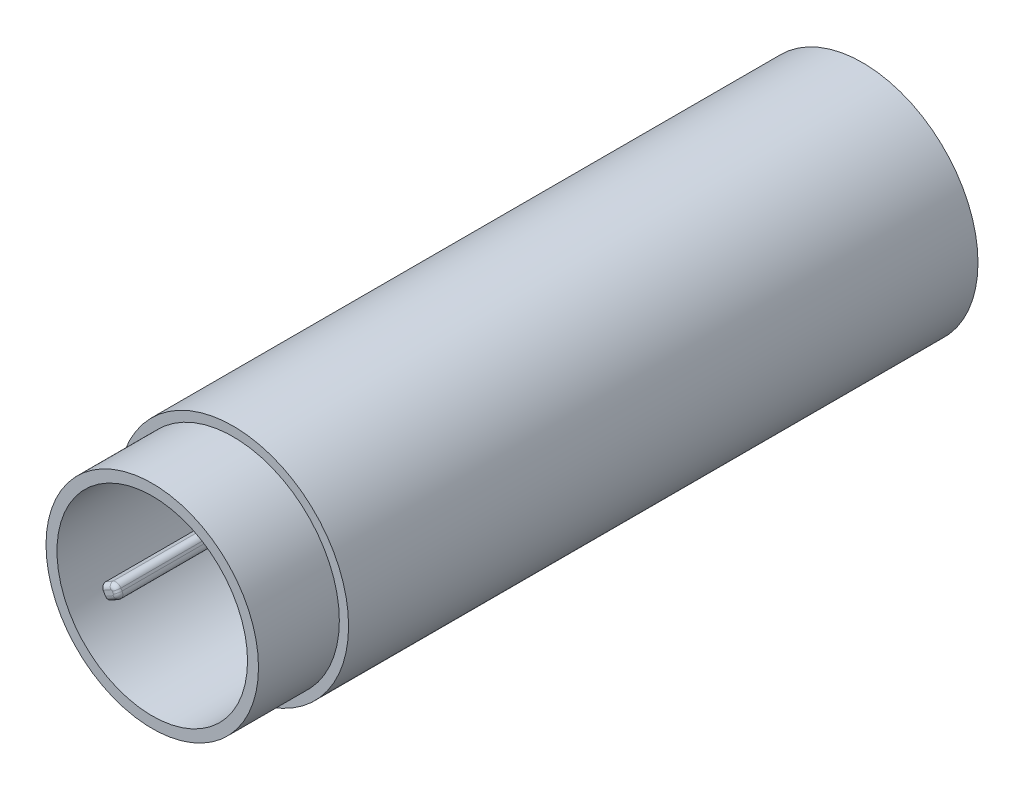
ISO-10303-21;
HEADER;
FILE_DESCRIPTION(('STEP AP214'),'2;1');
FILE_NAME('part.step','',(''),(''),'','','');
FILE_SCHEMA(('AUTOMOTIVE_DESIGN { 1 0 10303 214 1 1 1 1 }'));
ENDSEC;
DATA;
#1=APPLICATION_CONTEXT('core data for automotive mechanical design processes');
#2=APPLICATION_PROTOCOL_DEFINITION('international standard','automotive_design',2000,#1);
#3=PRODUCT_CONTEXT('',#1,'mechanical');
#4=PRODUCT('Part','Part','',(#3));
#5=PRODUCT_RELATED_PRODUCT_CATEGORY('part','',(#4));
#6=PRODUCT_DEFINITION_FORMATION('','',#4);
#7=PRODUCT_DEFINITION_CONTEXT('part definition',#1,'design');
#8=PRODUCT_DEFINITION('design','',#6,#7);
#9=PRODUCT_DEFINITION_SHAPE('','',#8);
#10=(LENGTH_UNIT() NAMED_UNIT(*) SI_UNIT(.MILLI.,.METRE.));
#11=(NAMED_UNIT(*) PLANE_ANGLE_UNIT() SI_UNIT($,.RADIAN.));
#12=(NAMED_UNIT(*) SI_UNIT($,.STERADIAN.) SOLID_ANGLE_UNIT());
#13=UNCERTAINTY_MEASURE_WITH_UNIT(LENGTH_MEASURE(1.E-05),#10,'distance_accuracy_value','');
#14=(GEOMETRIC_REPRESENTATION_CONTEXT(3) GLOBAL_UNCERTAINTY_ASSIGNED_CONTEXT((#13)) GLOBAL_UNIT_ASSIGNED_CONTEXT((#10,
#11,#12)) REPRESENTATION_CONTEXT('',''));
#15=CARTESIAN_POINT('',(0.,0.,0.));
#16=DIRECTION('',(0.,0.,1.));
#17=DIRECTION('',(1.,0.,0.));
#18=AXIS2_PLACEMENT_3D('',#15,#16,#17);
#19=CARTESIAN_POINT('',(0.,8.25,7.99999999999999));
#20=DIRECTION('',(0.,0.,-1.));
#21=DIRECTION('',(-1.,0.,0.));
#22=AXIS2_PLACEMENT_3D('',#19,#20,#21);
#23=PLANE('',#22);
#24=CARTESIAN_POINT('',(0.,0.,7.99999999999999));
#25=DIRECTION('',(0.,0.,1.));
#26=DIRECTION('',(1.,0.,0.));
#27=AXIS2_PLACEMENT_3D('',#24,#25,#26);
#28=CIRCLE('',#27,8.25);
#29=CARTESIAN_POINT('',(-1.,8.1891696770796,7.99999999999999));
#30=VERTEX_POINT('',#29);
#31=CARTESIAN_POINT('',(-7.59202897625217,-3.22855943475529,7.99999999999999));
#32=VERTEX_POINT('',#31);
#33=EDGE_CURVE('E350',#30,#32,#28,.T.);
#34=ORIENTED_EDGE('',*,*,#33,.T.);
#35=DIRECTION('',(0.866025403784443,0.499999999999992,0.));
#36=VECTOR('',#35,1.);
#37=CARTESIAN_POINT('',(3.07235479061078,2.92852540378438,7.99999999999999));
#38=LINE('',#37,#36);
#39=CARTESIAN_POINT('',(-6.93719659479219,-2.85049178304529,8.00000000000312));
#40=VERTEX_POINT('',#39);
#41=EDGE_CURVE('E322',#32,#40,#38,.T.);
#42=ORIENTED_EDGE('',*,*,#41,.T.);
#43=CARTESIAN_POINT('',(0.,0.,7.99999999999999));
#44=DIRECTION('',(0.,0.,-1.));
#45=DIRECTION('',(-1.,0.,0.));
#46=AXIS2_PLACEMENT_3D('',#43,#44,#45);
#47=CIRCLE('',#46,7.5);
#48=CARTESIAN_POINT('',(-1.,7.43303437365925,7.99999999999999));
#49=VERTEX_POINT('',#48);
#50=EDGE_CURVE('E453',#40,#49,#47,.T.);
#51=ORIENTED_EDGE('',*,*,#50,.T.);
#52=DIRECTION('',(0.,1.,0.));
#53=VECTOR('',#52,1.);
#54=CARTESIAN_POINT('',(-1.,8.25,7.99999999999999));
#55=LINE('',#54,#53);
#56=EDGE_CURVE('E370',#49,#30,#55,.T.);
#57=ORIENTED_EDGE('',*,*,#56,.T.);
#58=EDGE_LOOP('',(#34,#42,#51,#57));
#59=FACE_BOUND('',#58,.T.);
#60=ADVANCED_FACE('F26',(#59),#23,.F.);
#61=CARTESIAN_POINT('',(0.,0.,13.3056411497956));
#62=DIRECTION('',(0.,0.,1.));
#63=DIRECTION('',(1.,0.,0.));
#64=AXIS2_PLACEMENT_3D('',#61,#62,#63);
#65=CYLINDRICAL_SURFACE('',#64,7.);
#66=CARTESIAN_POINT('',(0.,0.,7.49999999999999));
#67=DIRECTION('',(0.,0.,-1.));
#68=DIRECTION('',(-1.,0.,0.));
#69=AXIS2_PLACEMENT_3D('',#66,#67,#68);
#70=CIRCLE('',#69,7.);
#71=CARTESIAN_POINT('',(-1.,6.92820323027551,7.49999999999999));
#72=VERTEX_POINT('',#71);
#73=CARTESIAN_POINT('',(-6.50000000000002,-2.59807621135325,7.49999999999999));
#74=VERTEX_POINT('',#73);
#75=EDGE_CURVE('E459',#72,#74,#70,.F.);
#76=ORIENTED_EDGE('',*,*,#75,.T.);
#77=DIRECTION('',(0.,0.,-1.));
#78=VECTOR('',#77,1.);
#79=CARTESIAN_POINT('',(-6.50000000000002,-2.59807621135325,11.6556540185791));
#80=LINE('',#79,#78);
#81=CARTESIAN_POINT('',(-6.50000000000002,-2.59807621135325,7.3));
#82=VERTEX_POINT('',#81);
#83=EDGE_CURVE('E1272',#74,#82,#80,.T.);
#84=ORIENTED_EDGE('',*,*,#83,.T.);
#85=CARTESIAN_POINT('',(0.,0.,7.3));
#86=DIRECTION('',(0.,0.,1.));
#87=DIRECTION('',(1.,0.,0.));
#88=AXIS2_PLACEMENT_3D('',#85,#86,#87);
#89=CIRCLE('',#88,7.);
#90=CARTESIAN_POINT('',(-1.,6.92820323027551,7.3));
#91=VERTEX_POINT('',#90);
#92=EDGE_CURVE('E476',#82,#91,#89,.F.);
#93=ORIENTED_EDGE('',*,*,#92,.T.);
#94=DIRECTION('',(0.,0.,-1.));
#95=VECTOR('',#94,1.);
#96=CARTESIAN_POINT('',(-1.,6.92820323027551,10.8973207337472));
#97=LINE('',#96,#95);
#98=EDGE_CURVE('E440',#72,#91,#97,.T.);
#99=ORIENTED_EDGE('',*,*,#98,.F.);
#100=EDGE_LOOP('',(#76,#84,#93,#99));
#101=FACE_BOUND('',#100,.T.);
#102=ADVANCED_FACE('F671',(#101),#65,.F.);
#103=CARTESIAN_POINT('',(0.,8.25,6.8));
#104=DIRECTION('',(0.,0.,1.));
#105=DIRECTION('',(1.,0.,0.));
#106=AXIS2_PLACEMENT_3D('',#103,#104,#105);
#107=PLANE('',#106);
#108=CARTESIAN_POINT('',(0.,0.,6.8));
#109=DIRECTION('',(0.,0.,1.));
#110=DIRECTION('',(1.,0.,0.));
#111=AXIS2_PLACEMENT_3D('',#108,#109,#110);
#112=CIRCLE('',#111,7.5);
#113=CARTESIAN_POINT('',(-1.,7.43303437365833,6.8));
#114=VERTEX_POINT('',#113);
#115=CARTESIAN_POINT('',(-6.93719659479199,-2.85049178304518,6.8));
#116=VERTEX_POINT('',#115);
#117=EDGE_CURVE('E336',#114,#116,#112,.T.);
#118=ORIENTED_EDGE('',*,*,#117,.T.);
#119=DIRECTION('',(0.866025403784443,0.499999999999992,0.));
#120=VECTOR('',#119,1.);
#121=CARTESIAN_POINT('',(-7.59202897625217,-3.22855943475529,6.8));
#122=LINE('',#121,#120);
#123=CARTESIAN_POINT('',(-7.59202897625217,-3.22855943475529,6.8));
#124=VERTEX_POINT('',#123);
#125=EDGE_CURVE('E319',#124,#116,#122,.T.);
#126=ORIENTED_EDGE('',*,*,#125,.F.);
#127=CARTESIAN_POINT('',(0.,0.,6.8));
#128=DIRECTION('',(0.,0.,1.));
#129=DIRECTION('',(1.,0.,0.));
#130=AXIS2_PLACEMENT_3D('',#127,#128,#129);
#131=CIRCLE('',#130,8.25);
#132=CARTESIAN_POINT('',(-1.,8.1891696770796,6.8));
#133=VERTEX_POINT('',#132);
#134=EDGE_CURVE('E334',#133,#124,#131,.T.);
#135=ORIENTED_EDGE('',*,*,#134,.F.);
#136=DIRECTION('',(0.,1.,0.));
#137=VECTOR('',#136,1.);
#138=CARTESIAN_POINT('',(-1.,8.1891696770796,6.8));
#139=LINE('',#138,#137);
#140=EDGE_CURVE('E433',#114,#133,#139,.T.);
#141=ORIENTED_EDGE('',*,*,#140,.F.);
#142=EDGE_LOOP('',(#118,#126,#135,#141));
#143=FACE_BOUND('',#142,.T.);
#144=ADVANCED_FACE('F332',(#143),#107,.F.);
#145=CARTESIAN_POINT('',(0.,0.,7.49999999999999));
#146=DIRECTION('',(0.,0.,-1.));
#147=DIRECTION('',(-1.,0.,0.));
#148=AXIS2_PLACEMENT_3D('',#145,#146,#147);
#149=TOROIDAL_SURFACE('',#148,7.5,0.5);
#150=CARTESIAN_POINT('',(-6.50000003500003,-2.59807623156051,7.4998));
#151=CARTESIAN_POINT('',(-6.49996846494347,-2.59805800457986,7.52772385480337));
#152=CARTESIAN_POINT('',(-6.50202597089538,-2.59924590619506,7.55563972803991));
#153=CARTESIAN_POINT('',(-6.51015687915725,-2.6039402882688,7.61065205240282));
#154=CARTESIAN_POINT('',(-6.51622611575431,-2.60744436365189,7.63774932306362));
#155=CARTESIAN_POINT('',(-6.53222169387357,-2.61667941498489,7.69039154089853));
#156=CARTESIAN_POINT('',(-6.54214941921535,-2.62241118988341,7.71593592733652));
#157=CARTESIAN_POINT('',(-6.56555813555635,-2.63592621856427,7.764747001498));
#158=CARTESIAN_POINT('',(-6.57903873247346,-2.6437092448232,7.78801394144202));
#159=CARTESIAN_POINT('',(-6.6092333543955,-2.66114211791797,7.83173774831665));
#160=CARTESIAN_POINT('',(-6.62596229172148,-2.67080057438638,7.85218088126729));
#161=CARTESIAN_POINT('',(-6.66213219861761,-2.69168327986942,7.88957466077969));
#162=CARTESIAN_POINT('',(-6.68157367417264,-2.70290782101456,7.90652465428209));
#163=CARTESIAN_POINT('',(-6.72281354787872,-2.72671767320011,7.93661842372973));
#164=CARTESIAN_POINT('',(-6.74463264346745,-2.73931493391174,7.94972438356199));
#165=CARTESIAN_POINT('',(-6.78985430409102,-2.76542367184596,7.97155906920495));
#166=CARTESIAN_POINT('',(-6.81325684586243,-2.77893513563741,7.98028785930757));
#167=CARTESIAN_POINT('',(-6.86118742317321,-2.8066078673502,7.99318853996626));
#168=CARTESIAN_POINT('',(-6.88572307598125,-2.82077353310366,7.99732271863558));
#169=CARTESIAN_POINT('',(-6.93504848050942,-2.84925156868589,8.00079287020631));
#170=CARTESIAN_POINT('',(-6.95983824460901,-2.86356394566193,8.00012860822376));
#171=CARTESIAN_POINT('',(-7.00904943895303,-2.89197604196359,7.9940064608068));
#172=CARTESIAN_POINT('',(-7.03346946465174,-2.90607495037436,7.98853349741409));
#173=CARTESIAN_POINT('',(-7.08116343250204,-2.93361107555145,7.97291850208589));
#174=CARTESIAN_POINT('',(-7.10443738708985,-2.94704829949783,7.96277652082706));
#175=CARTESIAN_POINT('',(-7.14910750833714,-2.97283860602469,7.93813249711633));
#176=CARTESIAN_POINT('',(-7.17050858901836,-2.98519452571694,7.92364233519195));
#177=CARTESIAN_POINT('',(-7.21087970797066,-3.00850280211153,7.89069210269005));
#178=CARTESIAN_POINT('',(-7.22984994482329,-3.01945527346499,7.87223235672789));
#179=CARTESIAN_POINT('',(-7.26467685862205,-3.03956260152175,7.83200448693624));
#180=CARTESIAN_POINT('',(-7.28055464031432,-3.04872964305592,7.81026072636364));
#181=CARTESIAN_POINT('',(-7.30889761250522,-3.06509346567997,7.76397516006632));
#182=CARTESIAN_POINT('',(-7.3213618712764,-3.07228970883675,7.73943259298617));
#183=CARTESIAN_POINT('',(-7.34242040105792,-3.08444785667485,7.68845125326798));
#184=CARTESIAN_POINT('',(-7.35104272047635,-3.08942595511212,7.66202791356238));
#185=CARTESIAN_POINT('',(-7.36428029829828,-3.09706867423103,7.60791203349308));
#186=CARTESIAN_POINT('',(-7.36890185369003,-3.09973693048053,7.58022156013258));
#187=CARTESIAN_POINT('',(-7.3730736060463,-3.10214549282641,7.53485478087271));
#188=CARTESIAN_POINT('',(-7.37387647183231,-3.10260902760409,7.51732261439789));
#189=CARTESIAN_POINT('',(-7.37386350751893,-3.10260154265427,7.49979999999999));
#190=B_SPLINE_CURVE_WITH_KNOTS('',3,(#150,#151,#152,#153,#154,#155,#156,#157,#158,#159,#160,
#161,#162,#163,#164,#165,#166,#167,#168,#169,#170,#171,#172,#173,#174,#175,#176,#177,#178,#179,
#180,#181,#182,#183,#184,#185,#186,#187,#188,#189),.UNSPECIFIED.,.F.,.F.,(4,2,2,2,2,2,2,2,2,2,2,
2,2,2,2,2,2,2,2,4),(0.,0.0836565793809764,0.167226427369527,0.250826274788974,0.334416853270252,
0.418400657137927,0.502400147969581,0.587200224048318,0.671999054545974,0.757488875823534,
0.842982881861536,0.928745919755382,1.01450802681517,1.10003790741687,1.1855607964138,
1.27047783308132,1.35541802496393,1.43972751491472,1.5239040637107,1.57647157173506),.UNSPECIFIED.);
#191=EDGE_CURVE('E460',#74,#40,#190,.T.);
#192=ORIENTED_EDGE('',*,*,#191,.F.);
#193=ORIENTED_EDGE('',*,*,#75,.F.);
#194=CARTESIAN_POINT('',(-1.,6.93350243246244,7.57223144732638));
#195=CARTESIAN_POINT('',(-1.,6.92944253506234,7.54469896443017));
#196=CARTESIAN_POINT('',(-1.,6.92770625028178,7.51680359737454));
#197=CARTESIAN_POINT('',(-1.,6.92894699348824,7.46109555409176));
#198=CARTESIAN_POINT('',(-1.,6.93192953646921,7.43328301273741));
#199=CARTESIAN_POINT('',(-1.,6.94252124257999,7.37856810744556));
#200=CARTESIAN_POINT('',(-1.,6.95012769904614,7.35166522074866));
#201=CARTESIAN_POINT('',(-1.,6.96973489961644,7.29952028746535));
#202=CARTESIAN_POINT('',(-1.,6.98173465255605,7.2742778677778));
#203=CARTESIAN_POINT('',(-1.,7.0098151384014,7.22607598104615));
#204=CARTESIAN_POINT('',(-1.,7.02590782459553,7.20312347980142));
#205=CARTESIAN_POINT('',(-1.,7.06168783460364,7.16021539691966));
#206=CARTESIAN_POINT('',(-1.,7.08137543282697,7.14026004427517));
#207=CARTESIAN_POINT('',(-1.,7.12396712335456,7.10372659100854));
#208=CARTESIAN_POINT('',(-1.,7.14689768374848,7.08717935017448));
#209=CARTESIAN_POINT('',(-1.,7.19519053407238,7.05812748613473));
#210=CARTESIAN_POINT('',(-1.,7.2205529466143,7.04562306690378));
#211=CARTESIAN_POINT('',(-1.,7.27324360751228,7.02489354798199));
#212=CARTESIAN_POINT('',(-1.,7.30058795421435,7.01670935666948));
#213=CARTESIAN_POINT('',(-1.,7.35625917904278,7.00501899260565));
#214=CARTESIAN_POINT('',(-1.,7.38458609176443,7.00151298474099));
#215=CARTESIAN_POINT('',(-1.,7.4415879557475,6.99926891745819));
#216=CARTESIAN_POINT('',(-1.,7.47026396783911,7.00055769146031));
#217=CARTESIAN_POINT('',(-1.,7.5269930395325,7.00793185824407));
#218=CARTESIAN_POINT('',(-1.,7.55504609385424,7.01401729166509));
#219=CARTESIAN_POINT('',(-1.,7.60972205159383,7.03082087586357));
#220=CARTESIAN_POINT('',(-1.,7.63634529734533,7.04153791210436));
#221=CARTESIAN_POINT('',(-1.,7.68740067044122,7.06731331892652));
#222=CARTESIAN_POINT('',(-1.,7.7118328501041,7.08237158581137));
#223=CARTESIAN_POINT('',(-1.,7.75766648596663,7.11631904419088));
#224=CARTESIAN_POINT('',(-1.,7.77908372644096,7.13518692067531));
#225=CARTESIAN_POINT('',(-1.,7.81841498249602,7.1762765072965));
#226=CARTESIAN_POINT('',(-1.,7.8363291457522,7.19849807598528));
#227=CARTESIAN_POINT('',(-1.,7.86799344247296,7.245474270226));
#228=CARTESIAN_POINT('',(-1.,7.88177566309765,7.27020726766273));
#229=CARTESIAN_POINT('',(-1.,7.90495738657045,7.32164838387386));
#230=CARTESIAN_POINT('',(-1.,7.91435707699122,7.34835641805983));
#231=CARTESIAN_POINT('',(-1.,7.92844086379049,7.40278275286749));
#232=CARTESIAN_POINT('',(-1.,7.93315838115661,7.43049240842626));
#233=CARTESIAN_POINT('',(-1.,7.9378551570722,7.48631016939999));
#234=CARTESIAN_POINT('',(-1.,7.93783454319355,7.5144182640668));
#235=CARTESIAN_POINT('',(-1.,7.9330648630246,7.57012460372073));
#236=CARTESIAN_POINT('',(-1.,7.92833334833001,7.59772435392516));
#237=CARTESIAN_POINT('',(-1.,7.91430836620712,7.65173884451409));
#238=CARTESIAN_POINT('',(-1.,7.90501490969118,7.67815358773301));
#239=CARTESIAN_POINT('',(-1.,7.88212732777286,7.72908155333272));
#240=CARTESIAN_POINT('',(-1.,7.86852872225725,7.75359276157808));
#241=CARTESIAN_POINT('',(-1.,7.83743041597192,7.80000039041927));
#242=CARTESIAN_POINT('',(-1.,7.81993062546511,7.82189675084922));
#243=CARTESIAN_POINT('',(-1.,7.78142938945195,7.8625833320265));
#244=CARTESIAN_POINT('',(-1.,7.76040951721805,7.88135611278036));
#245=CARTESIAN_POINT('',(-1.,7.71553757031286,7.91513915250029));
#246=CARTESIAN_POINT('',(-1.,7.69168538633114,7.93014926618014));
#247=CARTESIAN_POINT('',(-1.,7.6416258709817,7.95610656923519));
#248=CARTESIAN_POINT('',(-1.,7.61540151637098,7.96702092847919));
#249=CARTESIAN_POINT('',(-1.,7.56150100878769,7.98432834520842));
#250=CARTESIAN_POINT('',(-1.,7.53382479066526,7.99072119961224));
#251=CARTESIAN_POINT('',(-1.,7.47758898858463,7.99884782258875));
#252=CARTESIAN_POINT('',(-1.,7.44902441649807,8.00054709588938));
#253=CARTESIAN_POINT('',(-1.,7.39201289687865,7.99914514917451));
#254=CARTESIAN_POINT('',(-1.,7.36356595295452,7.9960437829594));
#255=CARTESIAN_POINT('',(-1.,7.30748809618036,7.98510564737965));
#256=CARTESIAN_POINT('',(-1.,7.27986056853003,7.97725150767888));
#257=CARTESIAN_POINT('',(-1.,7.22632096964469,7.95700746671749));
#258=CARTESIAN_POINT('',(-1.,7.2004088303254,7.94461774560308));
#259=CARTESIAN_POINT('',(-1.,7.15110118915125,7.91567405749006));
#260=CARTESIAN_POINT('',(-1.,7.1277002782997,7.89912930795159));
#261=CARTESIAN_POINT('',(-1.,7.08402871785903,7.86231347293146));
#262=CARTESIAN_POINT('',(-1.,7.06375874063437,7.84204158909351));
#263=CARTESIAN_POINT('',(-1.,7.02709128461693,7.79850223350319));
#264=CARTESIAN_POINT('',(-1.,7.01066756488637,7.77525683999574));
#265=CARTESIAN_POINT('',(-1.,6.98201867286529,7.72633467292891));
#266=CARTESIAN_POINT('',(-1.,6.96978816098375,7.70066104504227));
#267=CARTESIAN_POINT('',(-1.,6.95365589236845,7.6576929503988));
#268=CARTESIAN_POINT('',(-1.,6.94835430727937,7.64091017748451));
#269=CARTESIAN_POINT('',(-1.,6.93956011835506,7.60687703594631));
#270=CARTESIAN_POINT('',(-1.,6.93606750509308,7.58962666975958));
#271=CARTESIAN_POINT('',(-1.,6.93350243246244,7.57223144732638));
#272=B_SPLINE_CURVE_WITH_KNOTS('',3,(#194,#195,#196,#197,#198,#199,#200,#201,#202,#203,#204,
#205,#206,#207,#208,#209,#210,#211,#212,#213,#214,#215,#216,#217,#218,#219,#220,#221,#222,#223,
#224,#225,#226,#227,#228,#229,#230,#231,#232,#233,#234,#235,#236,#237,#238,#239,#240,#241,#242,
#243,#244,#245,#246,#247,#248,#249,#250,#251,#252,#253,#254,#255,#256,#257,#258,#259,#260,#261,
#262,#263,#264,#265,#266,#267,#268,#269,#270,#271),.UNSPECIFIED.,.T.,.F.,(4,2,2,2,2,2,2,2,2,2,2,
2,2,2,2,2,2,2,2,2,2,2,2,2,2,2,2,2,2,2,2,2,2,2,2,2,2,2,4),(0.,0.0834263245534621,
0.16695022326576,0.250425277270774,0.333881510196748,0.417584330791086,0.501293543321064,
0.585730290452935,0.670171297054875,0.755398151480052,0.840628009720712,0.926335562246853,
1.01204384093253,1.09773150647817,1.18341712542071,1.26863598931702,1.35385125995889,
1.43838653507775,1.52291819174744,1.60684203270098,1.69076361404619,1.77437369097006,
1.85798356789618,1.94168074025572,2.02537983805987,2.10953162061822,2.19368665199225,
2.27850251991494,2.36332219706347,2.44876361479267,2.53420763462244,2.61996583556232,
2.70572063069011,2.79128684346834,2.87687140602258,2.96185385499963,3.04672768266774,
3.09943731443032,3.15214667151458),.UNSPECIFIED.);
#273=EDGE_CURVE('E445',#49,#72,#272,.T.);
#274=ORIENTED_EDGE('',*,*,#273,.F.);
#275=ORIENTED_EDGE('',*,*,#50,.F.);
#276=EDGE_LOOP('',(#192,#193,#274,#275));
#277=FACE_BOUND('',#276,.T.);
#278=ADVANCED_FACE('F457',(#277),#149,.T.);
#279=CARTESIAN_POINT('',(0.,0.,7.3));
#280=DIRECTION('',(0.,0.,1.));
#281=DIRECTION('',(1.,0.,0.));
#282=AXIS2_PLACEMENT_3D('',#279,#280,#281);
#283=TOROIDAL_SURFACE('',#282,7.5,0.5);
#284=CARTESIAN_POINT('',(-7.37386350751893,-3.10260154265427,7.3002));
#285=CARTESIAN_POINT('',(-7.37389470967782,-3.10261955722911,7.27223450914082));
#286=CARTESIAN_POINT('',(-7.37183641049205,-3.10143119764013,7.24427641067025));
#287=CARTESIAN_POINT('',(-7.36369976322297,-3.09673350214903,7.18917735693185));
#288=CARTESIAN_POINT('',(-7.35762522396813,-3.09322636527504,7.16203565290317));
#289=CARTESIAN_POINT('',(-7.34161137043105,-3.08398076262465,7.10930547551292));
#290=CARTESIAN_POINT('',(-7.33167053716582,-3.07824141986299,7.08371761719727));
#291=CARTESIAN_POINT('',(-7.30822461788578,-3.06470491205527,7.03482705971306));
#292=CARTESIAN_POINT('',(-7.29472003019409,-3.05690803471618,7.01152404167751));
#293=CARTESIAN_POINT('',(-7.26448527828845,-3.03945199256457,6.96777149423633));
#294=CARTESIAN_POINT('',(-7.24774452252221,-3.0297867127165,6.94733172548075));
#295=CARTESIAN_POINT('',(-7.21154611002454,-3.00888754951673,6.90995523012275));
#296=CARTESIAN_POINT('',(-7.19208796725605,-2.99765338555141,6.89301913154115));
#297=CARTESIAN_POINT('',(-7.15085472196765,-2.97384736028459,6.86299857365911));
#298=CARTESIAN_POINT('',(-7.12906343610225,-2.96126615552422,6.84994375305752));
#299=CARTESIAN_POINT('',(-7.08390398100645,-2.9351933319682,6.82820732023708));
#300=CARTESIAN_POINT('',(-7.06053584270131,-2.92170173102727,6.81952562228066));
#301=CARTESIAN_POINT('',(-7.01268960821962,-2.89407769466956,6.80671321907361));
#302=CARTESIAN_POINT('',(-6.98820428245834,-2.87994108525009,6.80261849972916));
#303=CARTESIAN_POINT('',(-6.93898446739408,-2.85152401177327,6.79920851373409));
#304=CARTESIAN_POINT('',(-6.91424996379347,-2.83724353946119,6.79989352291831));
#305=CARTESIAN_POINT('',(-6.86510803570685,-2.80887143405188,6.8060373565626));
#306=CARTESIAN_POINT('',(-6.84070277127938,-2.79478104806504,6.81151924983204));
#307=CARTESIAN_POINT('',(-6.79303588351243,-2.76726055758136,6.82713846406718));
#308=CARTESIAN_POINT('',(-6.76977426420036,-2.75383045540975,6.83727580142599));
#309=CARTESIAN_POINT('',(-6.72507305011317,-2.72802219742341,6.86192287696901));
#310=CARTESIAN_POINT('',(-6.70363248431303,-2.71564348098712,6.87643026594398));
#311=CARTESIAN_POINT('',(-6.66318345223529,-2.69229022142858,6.90941988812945));
#312=CARTESIAN_POINT('',(-6.64417480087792,-2.68131557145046,6.9279018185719));
#313=CARTESIAN_POINT('',(-6.60926423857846,-2.66115994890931,6.96819325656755));
#314=CARTESIAN_POINT('',(-6.59334298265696,-2.6519678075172,6.98998041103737));
#315=CARTESIAN_POINT('',(-6.56492590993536,-2.6355612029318,7.03636488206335));
#316=CARTESIAN_POINT('',(-6.55243100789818,-2.62834726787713,7.0609629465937));
#317=CARTESIAN_POINT('',(-6.53134777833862,-2.61617485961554,7.11202516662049));
#318=CARTESIAN_POINT('',(-6.52272537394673,-2.61119671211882,7.13847057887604));
#319=CARTESIAN_POINT('',(-6.50950097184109,-2.60356160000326,7.19263221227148));
#320=CARTESIAN_POINT('',(-6.50489253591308,-2.60090091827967,7.22034632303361));
#321=CARTESIAN_POINT('',(-6.50077390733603,-2.59852302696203,7.26554028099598));
#322=CARTESIAN_POINT('',(-6.49998715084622,-2.59806879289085,7.2828748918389));
#323=CARTESIAN_POINT('',(-6.50000003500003,-2.59807623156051,7.30019999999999));
#324=B_SPLINE_CURVE_WITH_KNOTS('',3,(#284,#285,#286,#287,#288,#289,#290,#291,#292,#293,#294,
#295,#296,#297,#298,#299,#300,#301,#302,#303,#304,#305,#306,#307,#308,#309,#310,#311,#312,#313,
#314,#315,#316,#317,#318,#319,#320,#321,#322,#323),.UNSPECIFIED.,.F.,.F.,(4,2,2,2,2,2,2,2,2,2,2,
2,2,2,2,2,2,2,2,4),(0.,0.0837825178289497,0.167485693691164,0.25122178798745,0.334946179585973,
0.418949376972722,0.502967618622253,0.58761187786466,0.67225447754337,0.757556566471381,
0.842863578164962,0.928583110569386,1.01430294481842,1.09997678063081,1.18564409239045,
1.27075593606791,1.35589048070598,1.44026043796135,1.52449481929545,1.5764704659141),.UNSPECIFIED.);
#325=EDGE_CURVE('E737',#116,#82,#324,.T.);
#326=ORIENTED_EDGE('',*,*,#325,.F.);
#327=ORIENTED_EDGE('',*,*,#117,.F.);
#328=CARTESIAN_POINT('',(-1.,7.02477948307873,7.00595931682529));
#329=CARTESIAN_POINT('',(-1.,7.04154106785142,6.98313902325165));
#330=CARTESIAN_POINT('',(-1.,7.06025702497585,6.96172706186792));
#331=CARTESIAN_POINT('',(-1.,7.10104167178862,6.92233957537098));
#332=CARTESIAN_POINT('',(-1.,7.12311476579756,6.90436863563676));
#333=CARTESIAN_POINT('',(-1.,7.16994111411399,6.87239195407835));
#334=CARTESIAN_POINT('',(-1.,7.19469203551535,6.85838279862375));
#335=CARTESIAN_POINT('',(-1.,7.24617580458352,6.83469315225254));
#336=CARTESIAN_POINT('',(-1.,7.27290815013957,6.8250115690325));
#337=CARTESIAN_POINT('',(-1.,7.32778307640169,6.8101831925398));
#338=CARTESIAN_POINT('',(-1.,7.35593346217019,6.80506527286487));
#339=CARTESIAN_POINT('',(-1.,7.41269528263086,6.79960798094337));
#340=CARTESIAN_POINT('',(-1.,7.44130674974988,6.79926894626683));
#341=CARTESIAN_POINT('',(-1.,7.49829080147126,6.80339000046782));
#342=CARTESIAN_POINT('',(-1.,7.52666208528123,6.80786811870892));
#343=CARTESIAN_POINT('',(-1.,7.58224729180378,6.82153399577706));
#344=CARTESIAN_POINT('',(-1.,7.60946122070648,6.83072172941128));
#345=CARTESIAN_POINT('',(-1.,7.66189224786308,6.85353363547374));
#346=CARTESIAN_POINT('',(-1.,7.68711352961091,6.86714818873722));
#347=CARTESIAN_POINT('',(-1.,7.73489189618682,6.8984453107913));
#348=CARTESIAN_POINT('',(-1.,7.75744907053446,6.91612774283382));
#349=CARTESIAN_POINT('',(-1.,7.79909598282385,6.95493582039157));
#350=CARTESIAN_POINT('',(-1.,7.81820776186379,6.97603780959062));
#351=CARTESIAN_POINT('',(-1.,7.85258254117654,7.02117336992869));
#352=CARTESIAN_POINT('',(-1.,7.86784570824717,7.04520681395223));
#353=CARTESIAN_POINT('',(-1.,7.89396065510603,7.0953142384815));
#354=CARTESIAN_POINT('',(-1.,7.90484707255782,7.12137016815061));
#355=CARTESIAN_POINT('',(-1.,7.92205953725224,7.17494706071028));
#356=CARTESIAN_POINT('',(-1.,7.92838576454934,7.2024679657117));
#357=CARTESIAN_POINT('',(-1.,7.9362634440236,7.25800809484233));
#358=CARTESIAN_POINT('',(-1.,7.93784461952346,7.28602310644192));
#359=CARTESIAN_POINT('',(-1.,7.93626969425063,7.34191931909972));
#360=CARTESIAN_POINT('',(-1.,7.93311368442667,7.36980052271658));
#361=CARTESIAN_POINT('',(-1.,7.9221705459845,7.42457436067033));
#362=CARTESIAN_POINT('',(-1.,7.91439360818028,7.45146903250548));
#363=CARTESIAN_POINT('',(-1.,7.89444630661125,7.50357596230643));
#364=CARTESIAN_POINT('',(-1.,7.88227591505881,7.52878820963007));
#365=CARTESIAN_POINT('',(-1.,7.85385985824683,7.57688923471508));
#366=CARTESIAN_POINT('',(-1.,7.83760362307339,7.59977176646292));
#367=CARTESIAN_POINT('',(-1.,7.80150317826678,7.64250511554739));
#368=CARTESIAN_POINT('',(-1.,7.78165886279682,7.66235584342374));
#369=CARTESIAN_POINT('',(-1.,7.7388102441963,7.69860261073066));
#370=CARTESIAN_POINT('',(-1.,7.7157862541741,7.71497537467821));
#371=CARTESIAN_POINT('',(-1.,7.6673340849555,7.7436592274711));
#372=CARTESIAN_POINT('',(-1.,7.64190580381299,7.75597014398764));
#373=CARTESIAN_POINT('',(-1.,7.58914792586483,7.77628437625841));
#374=CARTESIAN_POINT('',(-1.,7.56180468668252,7.78425226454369));
#375=CARTESIAN_POINT('',(-1.,7.50617231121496,7.79551722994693));
#376=CARTESIAN_POINT('',(-1.,7.47788313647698,7.79881411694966));
#377=CARTESIAN_POINT('',(-1.,7.42096743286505,7.80065796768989));
#378=CARTESIAN_POINT('',(-1.,7.39233990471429,7.79917419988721));
#379=CARTESIAN_POINT('',(-1.,7.33573753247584,7.79143169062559));
#380=CARTESIAN_POINT('',(-1.,7.30776270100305,7.78517285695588));
#381=CARTESIAN_POINT('',(-1.,7.25320728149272,7.76803417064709));
#382=CARTESIAN_POINT('',(-1.,7.22662942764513,7.75714560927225));
#383=CARTESIAN_POINT('',(-1.,7.17568902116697,7.73104348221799));
#384=CARTESIAN_POINT('',(-1.,7.1513264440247,7.71582996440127));
#385=CARTESIAN_POINT('',(-1.,7.1056207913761,7.68156805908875));
#386=CARTESIAN_POINT('',(-1.,7.08426581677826,7.66253555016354));
#387=CARTESIAN_POINT('',(-1.,7.04508879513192,7.62112716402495));
#388=CARTESIAN_POINT('',(-1.,7.02726659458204,7.59875143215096));
#389=CARTESIAN_POINT('',(-1.,6.99582959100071,7.55149865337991));
#390=CARTESIAN_POINT('',(-1.,6.98217950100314,7.52664508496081));
#391=CARTESIAN_POINT('',(-1.,6.95929184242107,7.47498414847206));
#392=CARTESIAN_POINT('',(-1.,6.9500538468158,7.44817696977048));
#393=CARTESIAN_POINT('',(-1.,6.93633815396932,7.39364224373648));
#394=CARTESIAN_POINT('',(-1.,6.93181615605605,7.36592583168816));
#395=CARTESIAN_POINT('',(-1.,6.92751598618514,7.31012004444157));
#396=CARTESIAN_POINT('',(-1.,6.92773883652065,7.28203059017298));
#397=CARTESIAN_POINT('',(-1.,6.93290984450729,7.22642800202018));
#398=CARTESIAN_POINT('',(-1.,6.93783560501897,7.19891276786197));
#399=CARTESIAN_POINT('',(-1.,6.95222915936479,7.14512239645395));
#400=CARTESIAN_POINT('',(-1.,6.96169140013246,7.11884578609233));
#401=CARTESIAN_POINT('',(-1.,6.98033516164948,7.07813014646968));
#402=CARTESIAN_POINT('',(-1.,6.98818908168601,7.06306854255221));
#403=CARTESIAN_POINT('',(-1.,7.00538777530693,7.03382240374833));
#404=CARTESIAN_POINT('',(-1.,7.01473254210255,7.01963786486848));
#405=CARTESIAN_POINT('',(-1.,7.02477948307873,7.00595931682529));
#406=B_SPLINE_CURVE_WITH_KNOTS('',3,(#328,#329,#330,#331,#332,#333,#334,#335,#336,#337,#338,
#339,#340,#341,#342,#343,#344,#345,#346,#347,#348,#349,#350,#351,#352,#353,#354,#355,#356,#357,
#358,#359,#360,#361,#362,#363,#364,#365,#366,#367,#368,#369,#370,#371,#372,#373,#374,#375,#376,
#377,#378,#379,#380,#381,#382,#383,#384,#385,#386,#387,#388,#389,#390,#391,#392,#393,#394,#395,
#396,#397,#398,#399,#400,#401,#402,#403,#404,#405),.UNSPECIFIED.,.T.,.F.,(4,2,2,2,2,2,2,2,2,2,2,
2,2,2,2,2,2,2,2,2,2,2,2,2,2,2,2,2,2,2,2,2,2,2,2,2,2,2,4),(0.,0.0848811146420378,
0.169874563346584,0.25479455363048,0.339693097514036,0.425125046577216,0.510563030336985,
0.596321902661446,0.68208031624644,0.767653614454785,0.853224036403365,0.938225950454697,
1.02322417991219,1.1075358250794,1.19184414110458,1.27562323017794,1.35940071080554,
1.44299411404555,1.52658804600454,1.61040049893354,1.69421542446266,1.77857472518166,
1.86293760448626,1.94797873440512,2.03302332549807,2.11861569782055,2.20420972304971,
2.28996547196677,2.37572027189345,2.46112564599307,2.5465273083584,2.631185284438,
2.71583506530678,2.79968230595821,2.88354761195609,2.96701549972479,3.05038147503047,
3.10125968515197,3.15213766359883),.UNSPECIFIED.);
#407=EDGE_CURVE('E396',#91,#114,#406,.T.);
#408=ORIENTED_EDGE('',*,*,#407,.F.);
#409=ORIENTED_EDGE('',*,*,#92,.F.);
#410=EDGE_LOOP('',(#326,#327,#408,#409));
#411=FACE_BOUND('',#410,.T.);
#412=ADVANCED_FACE('F684',(#411),#283,.T.);
#413=CARTESIAN_POINT('',(5.93719659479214,-4.58254259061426,8.00000000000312));
#414=VERTEX_POINT('',#413);
#415=CARTESIAN_POINT('',(-5.9371965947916,-4.58254259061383,8.00000000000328));
#416=VERTEX_POINT('',#415);
#417=EDGE_CURVE('E466',#414,#416,#47,.T.);
#418=ORIENTED_EDGE('',*,*,#417,.T.);
#419=DIRECTION('',(-0.866025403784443,-0.499999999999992,0.));
#420=VECTOR('',#419,1.);
#421=CARTESIAN_POINT('',(4.07235479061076,1.19647459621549,7.99999999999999));
#422=LINE('',#421,#420);
#423=CARTESIAN_POINT('',(-6.59202897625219,-4.96061024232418,7.99999999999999));
#424=VERTEX_POINT('',#423);
#425=EDGE_CURVE('E742',#416,#424,#422,.T.);
#426=ORIENTED_EDGE('',*,*,#425,.T.);
#427=CARTESIAN_POINT('',(6.59202897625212,-4.96061024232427,7.99999999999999));
#428=VERTEX_POINT('',#427);
#429=EDGE_CURVE('E356',#424,#428,#28,.T.);
#430=ORIENTED_EDGE('',*,*,#429,.T.);
#431=DIRECTION('',(-0.866025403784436,0.500000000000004,0.));
#432=VECTOR('',#431,1.);
#433=CARTESIAN_POINT('',(-4.07235479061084,1.19647459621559,7.99999999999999));
#434=LINE('',#433,#432);
#435=EDGE_CURVE('E429',#428,#414,#434,.T.);
#436=ORIENTED_EDGE('',*,*,#435,.T.);
#437=EDGE_LOOP('',(#418,#426,#430,#436));
#438=FACE_BOUND('',#437,.T.);
#439=ADVANCED_FACE('F673',(#438),#23,.F.);
#440=CARTESIAN_POINT('',(5.49999999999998,-4.33012701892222,7.3));
#441=VERTEX_POINT('',#440);
#442=CARTESIAN_POINT('',(-5.50000000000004,-4.33012701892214,7.3));
#443=VERTEX_POINT('',#442);
#444=EDGE_CURVE('E475',#441,#443,#89,.F.);
#445=ORIENTED_EDGE('',*,*,#444,.T.);
#446=DIRECTION('',(0.,0.,-1.));
#447=VECTOR('',#446,1.);
#448=CARTESIAN_POINT('',(-5.50000000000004,-4.33012701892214,11.6556540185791));
#449=LINE('',#448,#447);
#450=CARTESIAN_POINT('',(-5.50000000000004,-4.33012701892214,7.49999999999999));
#451=VERTEX_POINT('',#450);
#452=EDGE_CURVE('E723',#451,#443,#449,.T.);
#453=ORIENTED_EDGE('',*,*,#452,.F.);
#454=CARTESIAN_POINT('',(5.49999999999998,-4.33012701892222,7.49999999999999));
#455=VERTEX_POINT('',#454);
#456=EDGE_CURVE('E463',#451,#455,#70,.F.);
#457=ORIENTED_EDGE('',*,*,#456,.T.);
#458=DIRECTION('',(0.,0.,-1.));
#459=VECTOR('',#458,1.);
#460=CARTESIAN_POINT('',(5.49999999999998,-4.33012701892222,11.6556540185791));
#461=LINE('',#460,#459);
#462=EDGE_CURVE('E725',#455,#441,#461,.T.);
#463=ORIENTED_EDGE('',*,*,#462,.T.);
#464=EDGE_LOOP('',(#445,#453,#457,#463));
#465=FACE_BOUND('',#464,.T.);
#466=ADVANCED_FACE('F680',(#465),#65,.F.);
#467=CARTESIAN_POINT('',(-6.59202897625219,-4.96061024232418,6.8));
#468=VERTEX_POINT('',#467);
#469=CARTESIAN_POINT('',(6.59202897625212,-4.96061024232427,6.8));
#470=VERTEX_POINT('',#469);
#471=EDGE_CURVE('E344',#468,#470,#131,.T.);
#472=ORIENTED_EDGE('',*,*,#471,.F.);
#473=DIRECTION('',(-0.866025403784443,-0.499999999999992,0.));
#474=VECTOR('',#473,1.);
#475=CARTESIAN_POINT('',(-6.59202897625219,-4.96061024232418,6.8));
#476=LINE('',#475,#474);
#477=CARTESIAN_POINT('',(-5.93719659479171,-4.5825425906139,6.8));
#478=VERTEX_POINT('',#477);
#479=EDGE_CURVE('E337',#478,#468,#476,.T.);
#480=ORIENTED_EDGE('',*,*,#479,.F.);
#481=CARTESIAN_POINT('',(5.93719659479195,-4.58254259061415,6.8));
#482=VERTEX_POINT('',#481);
#483=EDGE_CURVE('E699',#478,#482,#112,.T.);
#484=ORIENTED_EDGE('',*,*,#483,.T.);
#485=DIRECTION('',(-0.866025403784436,0.500000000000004,0.));
#486=VECTOR('',#485,1.);
#487=CARTESIAN_POINT('',(6.59202897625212,-4.96061024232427,6.8));
#488=LINE('',#487,#486);
#489=EDGE_CURVE('E708',#470,#482,#488,.T.);
#490=ORIENTED_EDGE('',*,*,#489,.F.);
#491=EDGE_LOOP('',(#472,#480,#484,#490));
#492=FACE_BOUND('',#491,.T.);
#493=ADVANCED_FACE('F707',(#492),#107,.F.);
#494=CARTESIAN_POINT('',(-6.37386350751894,-4.83465235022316,7.49979999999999));
#495=CARTESIAN_POINT('',(-6.37389470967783,-4.834670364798,7.52776549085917));
#496=CARTESIAN_POINT('',(-6.37183641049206,-4.83348200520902,7.55572358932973));
#497=CARTESIAN_POINT('',(-6.36369976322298,-4.82878430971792,7.61082264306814));
#498=CARTESIAN_POINT('',(-6.35762522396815,-4.82527717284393,7.63796434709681));
#499=CARTESIAN_POINT('',(-6.34161137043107,-4.81603157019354,7.69069452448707));
#500=CARTESIAN_POINT('',(-6.33167053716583,-4.81029222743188,7.71628238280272));
#501=CARTESIAN_POINT('',(-6.30822461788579,-4.79675571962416,7.76517294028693));
#502=CARTESIAN_POINT('',(-6.29472003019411,-4.78895884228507,7.78847595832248));
#503=CARTESIAN_POINT('',(-6.26448527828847,-4.77150280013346,7.83222850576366));
#504=CARTESIAN_POINT('',(-6.24774452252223,-4.76183752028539,7.85266827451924));
#505=CARTESIAN_POINT('',(-6.21154611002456,-4.74093835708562,7.89004476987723));
#506=CARTESIAN_POINT('',(-6.19208796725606,-4.7297041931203,7.90698086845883));
#507=CARTESIAN_POINT('',(-6.15085472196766,-4.70589816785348,7.93700142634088));
#508=CARTESIAN_POINT('',(-6.12906343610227,-4.69331696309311,7.95005624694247));
#509=CARTESIAN_POINT('',(-6.08390398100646,-4.66724413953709,7.97179267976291));
#510=CARTESIAN_POINT('',(-6.06053584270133,-4.65375253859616,7.98047437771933));
#511=CARTESIAN_POINT('',(-6.01268960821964,-4.62612850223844,7.99328678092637));
#512=CARTESIAN_POINT('',(-5.98820428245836,-4.61199189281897,7.99738150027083));
#513=CARTESIAN_POINT('',(-5.9389844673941,-4.58357481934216,8.0007914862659));
#514=CARTESIAN_POINT('',(-5.91424996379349,-4.56929434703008,8.00010647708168));
#515=CARTESIAN_POINT('',(-5.86510803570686,-4.54092224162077,7.99396264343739));
#516=CARTESIAN_POINT('',(-5.8407027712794,-4.52683185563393,7.98848075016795));
#517=CARTESIAN_POINT('',(-5.79303588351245,-4.49931136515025,7.97286153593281));
#518=CARTESIAN_POINT('',(-5.76977426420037,-4.48588126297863,7.962724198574));
#519=CARTESIAN_POINT('',(-5.72507305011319,-4.4600730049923,7.93807712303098));
#520=CARTESIAN_POINT('',(-5.70363248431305,-4.44769428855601,7.92356973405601));
#521=CARTESIAN_POINT('',(-5.6631834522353,-4.42434102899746,7.89058011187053));
#522=CARTESIAN_POINT('',(-5.64417480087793,-4.41336637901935,7.87209818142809));
#523=CARTESIAN_POINT('',(-5.60926423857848,-4.3932107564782,7.83180674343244));
#524=CARTESIAN_POINT('',(-5.59334298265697,-4.38401861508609,7.81001958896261));
#525=CARTESIAN_POINT('',(-5.56492590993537,-4.36761201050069,7.76363511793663));
#526=CARTESIAN_POINT('',(-5.55243100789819,-4.36039807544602,7.73903705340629));
#527=CARTESIAN_POINT('',(-5.53134777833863,-4.34822566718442,7.6879748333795));
#528=CARTESIAN_POINT('',(-5.52272537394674,-4.34324751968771,7.66152942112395));
#529=CARTESIAN_POINT('',(-5.50950097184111,-4.33561240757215,7.60736778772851));
#530=CARTESIAN_POINT('',(-5.50489253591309,-4.33295172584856,7.57965367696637));
#531=CARTESIAN_POINT('',(-5.50077390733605,-4.33057383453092,7.53445971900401));
#532=CARTESIAN_POINT('',(-5.49998715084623,-4.33011960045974,7.51712510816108));
#533=CARTESIAN_POINT('',(-5.50000003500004,-4.3301270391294,7.49979999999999));
#534=B_SPLINE_CURVE_WITH_KNOTS('',3,(#494,#495,#496,#497,#498,#499,#500,#501,#502,#503,#504,
#505,#506,#507,#508,#509,#510,#511,#512,#513,#514,#515,#516,#517,#518,#519,#520,#521,#522,#523,
#524,#525,#526,#527,#528,#529,#530,#531,#532,#533),.UNSPECIFIED.,.F.,.F.,(4,2,2,2,2,2,2,2,2,2,2,
2,2,2,2,2,2,2,2,4),(0.,0.0837825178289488,0.167485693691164,0.25122178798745,0.334946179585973,
0.418949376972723,0.502967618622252,0.58761187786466,0.672254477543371,0.757556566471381,
0.84286357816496,0.928583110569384,1.01430294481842,1.09997678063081,1.18564409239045,
1.27075593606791,1.35589048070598,1.44026043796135,1.52449481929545,1.5764704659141),.UNSPECIFIED.);
#535=EDGE_CURVE('E745',#416,#451,#534,.T.);
#536=ORIENTED_EDGE('',*,*,#535,.F.);
#537=ORIENTED_EDGE('',*,*,#417,.F.);
#538=CARTESIAN_POINT('',(5.50000003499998,-4.33012703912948,7.49979999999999));
#539=CARTESIAN_POINT('',(5.49996846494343,-4.33010881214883,7.52772385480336));
#540=CARTESIAN_POINT('',(5.50202597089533,-4.33129671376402,7.5556397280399));
#541=CARTESIAN_POINT('',(5.5101568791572,-4.33599109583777,7.61065205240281));
#542=CARTESIAN_POINT('',(5.51622611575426,-4.33949517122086,7.63774932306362));
#543=CARTESIAN_POINT('',(5.53222169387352,-4.34873022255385,7.69039154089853));
#544=CARTESIAN_POINT('',(5.54214941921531,-4.35446199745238,7.71593592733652));
#545=CARTESIAN_POINT('',(5.5655581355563,-4.36797702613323,7.764747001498));
#546=CARTESIAN_POINT('',(5.57903873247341,-4.37576005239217,7.78801394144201));
#547=CARTESIAN_POINT('',(5.60923335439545,-4.39319292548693,7.83173774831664));
#548=CARTESIAN_POINT('',(5.62596229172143,-4.40285138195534,7.85218088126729));
#549=CARTESIAN_POINT('',(5.66213219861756,-4.42373408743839,7.88957466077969));
#550=CARTESIAN_POINT('',(5.68157367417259,-4.43495862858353,7.90652465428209));
#551=CARTESIAN_POINT('',(5.72281354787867,-4.45876848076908,7.93661842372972));
#552=CARTESIAN_POINT('',(5.7446326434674,-4.47136574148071,7.94972438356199));
#553=CARTESIAN_POINT('',(5.78985430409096,-4.49747447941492,7.97155906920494));
#554=CARTESIAN_POINT('',(5.81325684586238,-4.51098594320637,7.98028785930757));
#555=CARTESIAN_POINT('',(5.86118742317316,-4.53865867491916,7.99318853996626));
#556=CARTESIAN_POINT('',(5.88572307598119,-4.55282434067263,7.99732271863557));
#557=CARTESIAN_POINT('',(5.93504848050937,-4.58130237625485,8.00079287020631));
#558=CARTESIAN_POINT('',(5.95983824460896,-4.5956147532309,8.00012860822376));
#559=CARTESIAN_POINT('',(6.00904943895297,-4.62402684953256,7.9940064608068));
#560=CARTESIAN_POINT('',(6.03346946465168,-4.63812575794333,7.98853349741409));
#561=CARTESIAN_POINT('',(6.08116343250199,-4.66566188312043,7.97291850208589));
#562=CARTESIAN_POINT('',(6.10443738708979,-4.6790991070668,7.96277652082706));
#563=CARTESIAN_POINT('',(6.14910750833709,-4.70488941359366,7.93813249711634));
#564=CARTESIAN_POINT('',(6.1705085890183,-4.71724533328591,7.92364233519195));
#565=CARTESIAN_POINT('',(6.2108797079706,-4.74055360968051,7.89069210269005));
#566=CARTESIAN_POINT('',(6.22984994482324,-4.75150608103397,7.87223235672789));
#567=CARTESIAN_POINT('',(6.264676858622,-4.77161340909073,7.83200448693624));
#568=CARTESIAN_POINT('',(6.28055464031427,-4.78078045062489,7.81026072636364));
#569=CARTESIAN_POINT('',(6.30889761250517,-4.79714427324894,7.76397516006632));
#570=CARTESIAN_POINT('',(6.32136187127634,-4.80434051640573,7.73943259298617));
#571=CARTESIAN_POINT('',(6.34242040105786,-4.81649866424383,7.68845125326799));
#572=CARTESIAN_POINT('',(6.3510427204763,-4.8214767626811,7.66202791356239));
#573=CARTESIAN_POINT('',(6.36428029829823,-4.82911948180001,7.60791203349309));
#574=CARTESIAN_POINT('',(6.36890185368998,-4.83178773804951,7.58022156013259));
#575=CARTESIAN_POINT('',(6.37307360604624,-4.83419630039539,7.53485478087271));
#576=CARTESIAN_POINT('',(6.37387647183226,-4.83465983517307,7.51732261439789));
#577=CARTESIAN_POINT('',(6.37386350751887,-4.83465235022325,7.4998));
#578=B_SPLINE_CURVE_WITH_KNOTS('',3,(#538,#539,#540,#541,#542,#543,#544,#545,#546,#547,#548,
#549,#550,#551,#552,#553,#554,#555,#556,#557,#558,#559,#560,#561,#562,#563,#564,#565,#566,#567,
#568,#569,#570,#571,#572,#573,#574,#575,#576,#577),.UNSPECIFIED.,.F.,.F.,(4,2,2,2,2,2,2,2,2,2,2,
2,2,2,2,2,2,2,2,4),(0.,0.0836565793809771,0.167226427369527,0.250826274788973,0.334416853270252,
0.418400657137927,0.50240014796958,0.587200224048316,0.671999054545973,0.757488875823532,
0.842982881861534,0.928745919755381,1.01450802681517,1.10003790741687,1.1855607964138,
1.27047783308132,1.35541802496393,1.43972751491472,1.5239040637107,1.57647157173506),.UNSPECIFIED.);
#579=EDGE_CURVE('E424',#455,#414,#578,.T.);
#580=ORIENTED_EDGE('',*,*,#579,.F.);
#581=ORIENTED_EDGE('',*,*,#456,.F.);
#582=EDGE_LOOP('',(#536,#537,#580,#581));
#583=FACE_BOUND('',#582,.T.);
#584=ADVANCED_FACE('F764',(#583),#149,.T.);
#585=CARTESIAN_POINT('',(-5.50000003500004,-4.3301270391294,7.3002));
#586=CARTESIAN_POINT('',(-5.49996846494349,-4.33010881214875,7.27227614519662));
#587=CARTESIAN_POINT('',(-5.50202597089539,-4.33129671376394,7.24436027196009));
#588=CARTESIAN_POINT('',(-5.51015687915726,-4.33599109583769,7.18934794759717));
#589=CARTESIAN_POINT('',(-5.51622611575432,-4.33949517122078,7.16225067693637));
#590=CARTESIAN_POINT('',(-5.53222169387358,-4.34873022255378,7.10960845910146));
#591=CARTESIAN_POINT('',(-5.54214941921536,-4.3544619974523,7.08406407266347));
#592=CARTESIAN_POINT('',(-5.56555813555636,-4.36797702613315,7.03525299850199));
#593=CARTESIAN_POINT('',(-5.57903873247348,-4.37576005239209,7.01198605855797));
#594=CARTESIAN_POINT('',(-5.60923335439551,-4.39319292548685,6.96826225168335));
#595=CARTESIAN_POINT('',(-5.62596229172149,-4.40285138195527,6.9478191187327));
#596=CARTESIAN_POINT('',(-5.66213219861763,-4.42373408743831,6.9104253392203));
#597=CARTESIAN_POINT('',(-5.68157367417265,-4.43495862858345,6.8934753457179));
#598=CARTESIAN_POINT('',(-5.72281354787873,-4.458768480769,6.86338157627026));
#599=CARTESIAN_POINT('',(-5.74463264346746,-4.47136574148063,6.850275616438));
#600=CARTESIAN_POINT('',(-5.78985430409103,-4.49747447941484,6.82844093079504));
#601=CARTESIAN_POINT('',(-5.81325684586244,-4.51098594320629,6.81971214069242));
#602=CARTESIAN_POINT('',(-5.86118742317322,-4.53865867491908,6.80681146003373));
#603=CARTESIAN_POINT('',(-5.88572307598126,-4.55282434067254,6.80267728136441));
#604=CARTESIAN_POINT('',(-5.93504848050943,-4.58130237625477,6.79920712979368));
#605=CARTESIAN_POINT('',(-5.95983824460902,-4.59561475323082,6.79987139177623));
#606=CARTESIAN_POINT('',(-6.00904943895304,-4.62402684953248,6.80599353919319));
#607=CARTESIAN_POINT('',(-6.03346946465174,-4.63812575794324,6.8114665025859));
#608=CARTESIAN_POINT('',(-6.08116343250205,-4.66566188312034,6.82708149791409));
#609=CARTESIAN_POINT('',(-6.10443738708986,-4.67909910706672,6.83722347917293));
#610=CARTESIAN_POINT('',(-6.14910750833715,-4.70488941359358,6.86186750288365));
#611=CARTESIAN_POINT('',(-6.17050858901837,-4.71724533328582,6.87635766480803));
#612=CARTESIAN_POINT('',(-6.21087970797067,-4.74055360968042,6.90930789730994));
#613=CARTESIAN_POINT('',(-6.2298499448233,-4.75150608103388,6.9277676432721));
#614=CARTESIAN_POINT('',(-6.26467685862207,-4.77161340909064,6.96799551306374));
#615=CARTESIAN_POINT('',(-6.28055464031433,-4.7807804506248,6.98973927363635));
#616=CARTESIAN_POINT('',(-6.30889761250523,-4.79714427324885,7.03602483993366));
#617=CARTESIAN_POINT('',(-6.32136187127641,-4.80434051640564,7.06056740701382));
#618=CARTESIAN_POINT('',(-6.34242040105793,-4.81649866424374,7.111548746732));
#619=CARTESIAN_POINT('',(-6.35104272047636,-4.82147676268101,7.1379720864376));
#620=CARTESIAN_POINT('',(-6.3642802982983,-4.82911948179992,7.1920879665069));
#621=CARTESIAN_POINT('',(-6.36890185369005,-4.83178773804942,7.2197784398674));
#622=CARTESIAN_POINT('',(-6.37307360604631,-4.8341963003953,7.26514521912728));
#623=CARTESIAN_POINT('',(-6.37387647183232,-4.83465983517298,7.2826773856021));
#624=CARTESIAN_POINT('',(-6.37386350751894,-4.83465235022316,7.3002));
#625=B_SPLINE_CURVE_WITH_KNOTS('',3,(#585,#586,#587,#588,#589,#590,#591,#592,#593,#594,#595,
#596,#597,#598,#599,#600,#601,#602,#603,#604,#605,#606,#607,#608,#609,#610,#611,#612,#613,#614,
#615,#616,#617,#618,#619,#620,#621,#622,#623,#624),.UNSPECIFIED.,.F.,.F.,(4,2,2,2,2,2,2,2,2,2,2,
2,2,2,2,2,2,2,2,4),(0.,0.0836565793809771,0.167226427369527,0.250826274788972,0.334416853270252,
0.418400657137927,0.502400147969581,0.587200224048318,0.671999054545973,0.757488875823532,
0.842982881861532,0.928745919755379,1.01450802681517,1.10003790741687,1.1855607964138,
1.27047783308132,1.35541802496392,1.43972751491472,1.5239040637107,1.57647157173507),.UNSPECIFIED.);
#626=EDGE_CURVE('E327',#443,#478,#625,.T.);
#627=ORIENTED_EDGE('',*,*,#626,.F.);
#628=ORIENTED_EDGE('',*,*,#444,.F.);
#629=CARTESIAN_POINT('',(6.37386350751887,-4.83465235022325,7.30019999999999));
#630=CARTESIAN_POINT('',(6.37389470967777,-4.83467036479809,7.27223450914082));
#631=CARTESIAN_POINT('',(6.371836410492,-4.83348200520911,7.24427641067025));
#632=CARTESIAN_POINT('',(6.36369976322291,-4.828784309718,7.18917735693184));
#633=CARTESIAN_POINT('',(6.35762522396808,-4.82527717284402,7.16203565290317));
#634=CARTESIAN_POINT('',(6.341611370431,-4.81603157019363,7.10930547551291));
#635=CARTESIAN_POINT('',(6.33167053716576,-4.81029222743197,7.08371761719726));
#636=CARTESIAN_POINT('',(6.30822461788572,-4.79675571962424,7.03482705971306));
#637=CARTESIAN_POINT('',(6.29472003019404,-4.78895884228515,7.0115240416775));
#638=CARTESIAN_POINT('',(6.2644852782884,-4.77150280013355,6.96777149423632));
#639=CARTESIAN_POINT('',(6.24774452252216,-4.76183752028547,6.94733172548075));
#640=CARTESIAN_POINT('',(6.21154611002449,-4.74093835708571,6.90995523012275));
#641=CARTESIAN_POINT('',(6.19208796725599,-4.72970419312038,6.89301913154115));
#642=CARTESIAN_POINT('',(6.15085472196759,-4.70589816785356,6.86299857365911));
#643=CARTESIAN_POINT('',(6.1290634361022,-4.69331696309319,6.84994375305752));
#644=CARTESIAN_POINT('',(6.08390398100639,-4.66724413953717,6.82820732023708));
#645=CARTESIAN_POINT('',(6.06053584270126,-4.65375253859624,6.81952562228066));
#646=CARTESIAN_POINT('',(6.01268960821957,-4.62612850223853,6.80671321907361));
#647=CARTESIAN_POINT('',(5.98820428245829,-4.61199189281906,6.80261849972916));
#648=CARTESIAN_POINT('',(5.93898446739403,-4.58357481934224,6.79920851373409));
#649=CARTESIAN_POINT('',(5.91424996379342,-4.56929434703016,6.79989352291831));
#650=CARTESIAN_POINT('',(5.86510803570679,-4.54092224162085,6.8060373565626));
#651=CARTESIAN_POINT('',(5.84070277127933,-4.52683185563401,6.81151924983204));
#652=CARTESIAN_POINT('',(5.79303588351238,-4.49931136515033,6.82713846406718));
#653=CARTESIAN_POINT('',(5.7697742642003,-4.48588126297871,6.83727580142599));
#654=CARTESIAN_POINT('',(5.72507305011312,-4.46007300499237,6.86192287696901));
#655=CARTESIAN_POINT('',(5.70363248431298,-4.44769428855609,6.87643026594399));
#656=CARTESIAN_POINT('',(5.66318345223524,-4.42434102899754,6.90941988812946));
#657=CARTESIAN_POINT('',(5.64417480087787,-4.41336637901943,6.9279018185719));
#658=CARTESIAN_POINT('',(5.60926423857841,-4.39321075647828,6.96819325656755));
#659=CARTESIAN_POINT('',(5.59334298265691,-4.38401861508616,6.98998041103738));
#660=CARTESIAN_POINT('',(5.56492590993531,-4.36761201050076,7.03636488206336));
#661=CARTESIAN_POINT('',(5.55243100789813,-4.3603980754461,7.0609629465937));
#662=CARTESIAN_POINT('',(5.53134777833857,-4.3482256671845,7.11202516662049));
#663=CARTESIAN_POINT('',(5.52272537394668,-4.34324751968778,7.13847057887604));
#664=CARTESIAN_POINT('',(5.50950097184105,-4.33561240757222,7.19263221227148));
#665=CARTESIAN_POINT('',(5.50489253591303,-4.33295172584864,7.22034632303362));
#666=CARTESIAN_POINT('',(5.50077390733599,-4.33057383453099,7.26554028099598));
#667=CARTESIAN_POINT('',(5.49998715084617,-4.33011960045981,7.28287489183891));
#668=CARTESIAN_POINT('',(5.50000003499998,-4.33012703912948,7.3002));
#669=B_SPLINE_CURVE_WITH_KNOTS('',3,(#629,#630,#631,#632,#633,#634,#635,#636,#637,#638,#639,
#640,#641,#642,#643,#644,#645,#646,#647,#648,#649,#650,#651,#652,#653,#654,#655,#656,#657,#658,
#659,#660,#661,#662,#663,#664,#665,#666,#667,#668),.UNSPECIFIED.,.F.,.F.,(4,2,2,2,2,2,2,2,2,2,2,
2,2,2,2,2,2,2,2,4),(0.,0.0837825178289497,0.167485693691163,0.25122178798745,0.334946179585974,
0.418949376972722,0.502967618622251,0.587611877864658,0.67225447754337,0.757556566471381,
0.84286357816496,0.928583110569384,1.01430294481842,1.09997678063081,1.18564409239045,
1.27075593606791,1.35589048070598,1.44026043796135,1.52449481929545,1.5764704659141),.UNSPECIFIED.);
#670=EDGE_CURVE('E11',#482,#441,#669,.T.);
#671=ORIENTED_EDGE('',*,*,#670,.F.);
#672=ORIENTED_EDGE('',*,*,#483,.F.);
#673=EDGE_LOOP('',(#627,#628,#671,#672));
#674=FACE_BOUND('',#673,.T.);
#675=ADVANCED_FACE('F507',(#674),#283,.T.);
#676=CARTESIAN_POINT('',(0.,0.,61.5));
#677=DIRECTION('',(0.,0.,-1.));
#678=DIRECTION('',(-1.,0.,0.));
#679=AXIS2_PLACEMENT_3D('',#676,#677,#678);
#680=CYLINDRICAL_SURFACE('',#679,8.25);
#681=DIRECTION('',(0.,0.,-1.));
#682=VECTOR('',#681,1.);
#683=CARTESIAN_POINT('',(-7.59202897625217,-3.22855943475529,11.6556540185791));
#684=LINE('',#683,#682);
#685=EDGE_CURVE('E316',#32,#124,#684,.T.);
#686=ORIENTED_EDGE('',*,*,#685,.F.);
#687=ORIENTED_EDGE('',*,*,#33,.F.);
#688=DIRECTION('',(0.,0.,-1.));
#689=VECTOR('',#688,1.);
#690=CARTESIAN_POINT('',(-1.,8.1891696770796,10.8973207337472));
#691=LINE('',#690,#689);
#692=EDGE_CURVE('E342',#30,#133,#691,.T.);
#693=ORIENTED_EDGE('',*,*,#692,.T.);
#694=ORIENTED_EDGE('',*,*,#134,.T.);
#695=EDGE_LOOP('',(#686,#687,#693,#694));
#696=FACE_BOUND('',#695,.T.);
#697=DIRECTION('',(0.,0.,1.));
#698=VECTOR('',#697,1.);
#699=CARTESIAN_POINT('',(-7.42578942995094,-3.59446120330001,8.49999999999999));
#700=LINE('',#699,#698);
#701=CARTESIAN_POINT('',(-7.42578942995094,-3.59446120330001,8.49999999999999));
#702=VERTEX_POINT('',#701);
#703=CARTESIAN_POINT('',(-7.42578942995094,-3.59446120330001,58.1));
#704=VERTEX_POINT('',#703);
#705=EDGE_CURVE('E940',#702,#704,#700,.T.);
#706=ORIENTED_EDGE('',*,*,#705,.F.);
#707=CARTESIAN_POINT('',(0.,0.,8.49999999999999));
#708=DIRECTION('',(0.,0.,1.));
#709=DIRECTION('',(-0.499999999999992,0.866025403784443,0.));
#710=AXIS2_PLACEMENT_3D('',#707,#708,#709);
#711=CIRCLE('',#710,8.25);
#712=CARTESIAN_POINT('',(-6.82578942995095,-4.63369168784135,8.49999999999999));
#713=VERTEX_POINT('',#712);
#714=EDGE_CURVE('E933',#702,#713,#711,.T.);
#715=ORIENTED_EDGE('',*,*,#714,.T.);
#716=DIRECTION('',(0.,0.,1.));
#717=VECTOR('',#716,1.);
#718=CARTESIAN_POINT('',(-6.82578942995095,-4.63369168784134,8.49999999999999));
#719=LINE('',#718,#717);
#720=CARTESIAN_POINT('',(-6.82578942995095,-4.63369168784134,58.1));
#721=VERTEX_POINT('',#720);
#722=EDGE_CURVE('E899',#713,#721,#719,.T.);
#723=ORIENTED_EDGE('',*,*,#722,.T.);
#724=CARTESIAN_POINT('',(-6.82578942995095,-4.63369168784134,58.1));
#725=CARTESIAN_POINT('',(-6.82577630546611,-4.63370636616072,58.1224682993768));
#726=CARTESIAN_POINT('',(-6.82685483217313,-4.63212219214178,58.1449303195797));
#727=CARTESIAN_POINT('',(-6.83109789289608,-4.62586502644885,58.1891985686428));
#728=CARTESIAN_POINT('',(-6.83426057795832,-4.62119477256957,58.2110053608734));
#729=CARTESIAN_POINT('',(-6.84257680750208,-4.60887126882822,58.2533712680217));
#730=CARTESIAN_POINT('',(-6.84773122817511,-4.60121670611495,58.2739298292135));
#731=CARTESIAN_POINT('',(-6.85984837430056,-4.58313201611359,58.3132066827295));
#732=CARTESIAN_POINT('',(-6.86681084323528,-4.572702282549,58.3319252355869));
#733=CARTESIAN_POINT('',(-6.88232264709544,-4.5493220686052,58.3670259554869));
#734=CARTESIAN_POINT('',(-6.89087439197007,-4.53636775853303,58.3834045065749));
#735=CARTESIAN_POINT('',(-6.9092774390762,-4.50828864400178,58.4133334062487));
#736=CARTESIAN_POINT('',(-6.9191290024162,-4.49316340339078,58.4268831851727));
#737=CARTESIAN_POINT('',(-6.93983314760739,-4.46111870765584,58.450791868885));
#738=CARTESIAN_POINT('',(-6.95068767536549,-4.4441957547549,58.4611443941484));
#739=CARTESIAN_POINT('',(-6.97303935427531,-4.40904238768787,58.4783235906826));
#740=CARTESIAN_POINT('',(-6.98453612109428,-4.39081275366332,58.4851523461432));
#741=CARTESIAN_POINT('',(-7.00385751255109,-4.35989571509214,58.4934045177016));
#742=CARTESIAN_POINT('',(-7.0116032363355,-4.34742865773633,58.495876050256));
#743=CARTESIAN_POINT('',(-7.02711316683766,-4.32231423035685,58.4991736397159));
#744=CARTESIAN_POINT('',(-7.03487733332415,-4.30966713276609,58.5000019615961));
#745=CARTESIAN_POINT('',(-7.04260981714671,-4.29699278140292,58.5));
#746=B_SPLINE_CURVE_WITH_KNOTS('',3,(#724,#725,#726,#727,#728,#729,#730,#731,#732,#733,#734,
#735,#736,#737,#738,#739,#740,#741,#742,#743,#744,#745),.UNSPECIFIED.,.F.,.F.,(4,2,2,2,2,2,2,2,
2,2,4),(0.,0.067314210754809,0.13456878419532,0.201852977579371,0.269127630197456,
0.336505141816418,0.403896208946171,0.471420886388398,0.538905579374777,0.583471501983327,
0.627975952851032),.UNSPECIFIED.);
#747=CARTESIAN_POINT('',(-7.04260981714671,-4.29699278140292,58.5));
#748=VERTEX_POINT('',#747);
#749=EDGE_CURVE('E482',#721,#748,#746,.T.);
#750=ORIENTED_EDGE('',*,*,#749,.T.);
#751=CARTESIAN_POINT('',(0.,0.,58.5));
#752=DIRECTION('',(0.,0.,1.));
#753=DIRECTION('',(-0.499999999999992,0.866025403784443,0.));
#754=AXIS2_PLACEMENT_3D('',#751,#752,#753);
#755=CIRCLE('',#754,8.25);
#756=CARTESIAN_POINT('',(-7.24260981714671,-3.95058261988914,58.5));
#757=VERTEX_POINT('',#756);
#758=EDGE_CURVE('E906',#757,#748,#755,.T.);
#759=ORIENTED_EDGE('',*,*,#758,.F.);
#760=CARTESIAN_POINT('',(-7.24260981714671,-3.95058261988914,58.5));
#761=CARTESIAN_POINT('',(-7.2533958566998,-3.93081596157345,58.5000190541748));
#762=CARTESIAN_POINT('',(-7.26409179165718,-3.91100736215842,58.498100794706));
#763=CARTESIAN_POINT('',(-7.28501837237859,-3.87188371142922,58.4905332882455));
#764=CARTESIAN_POINT('',(-7.29524940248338,-3.8525682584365,58.4848871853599));
#765=CARTESIAN_POINT('',(-7.31498453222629,-3.81496487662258,58.4700039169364));
#766=CARTESIAN_POINT('',(-7.32448831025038,-3.79667740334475,58.460765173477));
#767=CARTESIAN_POINT('',(-7.34252582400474,-3.7616753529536,58.438967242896));
#768=CARTESIAN_POINT('',(-7.35105970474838,-3.74496054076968,58.4264085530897));
#769=CARTESIAN_POINT('',(-7.36696330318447,-3.71357810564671,58.3983092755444));
#770=CARTESIAN_POINT('',(-7.37433183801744,-3.69891256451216,58.3827656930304));
#771=CARTESIAN_POINT('',(-7.38772746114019,-3.67208501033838,58.3491401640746));
#772=CARTESIAN_POINT('',(-7.39375429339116,-3.65992347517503,58.3310577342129));
#773=CARTESIAN_POINT('',(-7.4043316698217,-3.638477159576,58.2928710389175));
#774=CARTESIAN_POINT('',(-7.40888225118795,-3.62919230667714,58.272766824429));
#775=CARTESIAN_POINT('',(-7.41640809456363,-3.61378816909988,58.2311092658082));
#776=CARTESIAN_POINT('',(-7.41938431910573,-3.60766695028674,58.209556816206));
#777=CARTESIAN_POINT('',(-7.4229556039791,-3.60031116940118,58.173225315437));
#778=CARTESIAN_POINT('',(-7.42401802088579,-3.598119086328,58.1586772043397));
#779=CARTESIAN_POINT('',(-7.42543465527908,-3.59519414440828,58.1294214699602));
#780=CARTESIAN_POINT('',(-7.42578985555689,-3.59445926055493,58.114714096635));
#781=CARTESIAN_POINT('',(-7.42578942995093,-3.59446120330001,58.1));
#782=B_SPLINE_CURVE_WITH_KNOTS('',3,(#760,#761,#762,#763,#764,#765,#766,#767,#768,#769,#770,
#771,#772,#773,#774,#775,#776,#777,#778,#779,#780,#781),.UNSPECIFIED.,.F.,.F.,(4,2,2,2,2,2,2,2,
2,2,4),(0.,0.067463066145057,0.134869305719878,0.202305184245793,0.269730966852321,
0.337224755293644,0.404731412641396,0.472236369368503,0.53970000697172,0.583868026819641,
0.627974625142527),.UNSPECIFIED.);
#783=EDGE_CURVE('E480',#757,#704,#782,.T.);
#784=ORIENTED_EDGE('',*,*,#783,.T.);
#785=EDGE_LOOP('',(#706,#715,#723,#750,#759,#784));
#786=FACE_BOUND('',#785,.T.);
#787=ORIENTED_EDGE('',*,*,#429,.F.);
#788=DIRECTION('',(0.,0.,-1.));
#789=VECTOR('',#788,1.);
#790=CARTESIAN_POINT('',(-6.59202897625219,-4.96061024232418,11.6556540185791));
#791=LINE('',#790,#789);
#792=EDGE_CURVE('E46',#424,#468,#791,.T.);
#793=ORIENTED_EDGE('',*,*,#792,.T.);
#794=ORIENTED_EDGE('',*,*,#471,.T.);
#795=DIRECTION('',(0.,0.,-1.));
#796=VECTOR('',#795,1.);
#797=CARTESIAN_POINT('',(6.59202897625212,-4.96061024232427,11.6556540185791));
#798=LINE('',#797,#796);
#799=EDGE_CURVE('E421',#428,#470,#798,.T.);
#800=ORIENTED_EDGE('',*,*,#799,.F.);
#801=EDGE_LOOP('',(#787,#793,#794,#800));
#802=FACE_BOUND('',#801,.T.);
#803=DIRECTION('',(0.,0.,1.));
#804=VECTOR('',#803,1.);
#805=CARTESIAN_POINT('',(6.82578942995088,-4.63369168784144,8.49999999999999));
#806=LINE('',#805,#804);
#807=CARTESIAN_POINT('',(6.82578942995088,-4.63369168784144,8.49999999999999));
#808=VERTEX_POINT('',#807);
#809=CARTESIAN_POINT('',(6.82578942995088,-4.63369168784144,58.1));
#810=VERTEX_POINT('',#809);
#811=EDGE_CURVE('E768',#808,#810,#806,.T.);
#812=ORIENTED_EDGE('',*,*,#811,.F.);
#813=CARTESIAN_POINT('',(0.,0.,8.49999999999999));
#814=DIRECTION('',(0.,0.,1.));
#815=DIRECTION('',(-0.500000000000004,-0.866025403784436,0.));
#816=AXIS2_PLACEMENT_3D('',#813,#814,#815);
#817=CIRCLE('',#816,8.25);
#818=CARTESIAN_POINT('',(7.42578942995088,-3.59446120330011,8.49999999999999));
#819=VERTEX_POINT('',#818);
#820=EDGE_CURVE('E945',#808,#819,#817,.T.);
#821=ORIENTED_EDGE('',*,*,#820,.T.);
#822=DIRECTION('',(0.,0.,1.));
#823=VECTOR('',#822,1.);
#824=CARTESIAN_POINT('',(7.42578942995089,-3.59446120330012,8.49999999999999));
#825=LINE('',#824,#823);
#826=CARTESIAN_POINT('',(7.42578942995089,-3.59446120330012,58.1));
#827=VERTEX_POINT('',#826);
#828=EDGE_CURVE('E894',#819,#827,#825,.T.);
#829=ORIENTED_EDGE('',*,*,#828,.T.);
#830=CARTESIAN_POINT('',(7.42578942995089,-3.59446120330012,58.1));
#831=CARTESIAN_POINT('',(7.42579557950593,-3.59444249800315,58.1224682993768));
#832=CARTESIAN_POINT('',(7.42496290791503,-3.59616861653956,58.1449303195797));
#833=CARTESIAN_POINT('',(7.42166557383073,-3.6029717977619,58.1891985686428));
#834=CARTESIAN_POINT('',(7.41920235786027,-3.60804589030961,58.2110053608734));
#835=CARTESIAN_POINT('',(7.41268800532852,-3.62140970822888,58.2533712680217));
#836=CARTESIAN_POINT('',(7.40863616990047,-3.62970084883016,58.2739298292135));
#837=CARTESIAN_POINT('',(7.39903294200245,-3.64923695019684,58.3132066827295));
#838=CARTESIAN_POINT('',(7.39348176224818,-3.66048149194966,58.3319252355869));
#839=CARTESIAN_POINT('',(7.38098980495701,-3.68560521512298,58.3670259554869));
#840=CARTESIAN_POINT('',(7.37404691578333,-3.69948839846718,58.3834045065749));
#841=CARTESIAN_POINT('',(7.35893121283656,-3.72946546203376,58.4133334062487));
#842=CARTESIAN_POINT('',(7.35075815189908,-3.74555978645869,58.4268831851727));
#843=CARTESIAN_POINT('',(7.33335870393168,-3.77951245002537,58.450791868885));
#844=CARTESIAN_POINT('',(7.32413026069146,-3.79737422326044,58.4611443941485));
#845=CARTESIAN_POINT('',(7.30486239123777,-3.83430802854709,58.4783235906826));
#846=CARTESIAN_POINT('',(7.2948234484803,-3.85337933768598,58.4851523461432));
#847=CARTESIAN_POINT('',(7.27770920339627,-3.88557067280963,58.4934045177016));
#848=CARTESIAN_POINT('',(7.27078527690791,-3.89851219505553,58.495876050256));
#849=CARTESIAN_POINT('',(7.25679051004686,-3.92450140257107,58.4991736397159));
#850=CARTESIAN_POINT('',(7.24971988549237,-3.93754891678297,58.5000019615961));
#851=CARTESIAN_POINT('',(7.24260981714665,-3.95058261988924,58.5));
#852=B_SPLINE_CURVE_WITH_KNOTS('',3,(#830,#831,#832,#833,#834,#835,#836,#837,#838,#839,#840,
#841,#842,#843,#844,#845,#846,#847,#848,#849,#850,#851),.UNSPECIFIED.,.F.,.F.,(4,2,2,2,2,2,2,2,
2,2,4),(0.,0.067314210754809,0.13456878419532,0.201852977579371,0.269127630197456,
0.336505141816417,0.403896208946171,0.471420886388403,0.538905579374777,0.58347150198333,
0.627975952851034),.UNSPECIFIED.);
#853=CARTESIAN_POINT('',(7.24260981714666,-3.95058261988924,58.5));
#854=VERTEX_POINT('',#853);
#855=EDGE_CURVE('E531',#827,#854,#852,.T.);
#856=ORIENTED_EDGE('',*,*,#855,.T.);
#857=CARTESIAN_POINT('',(0.,0.,58.5));
#858=DIRECTION('',(0.,0.,1.));
#859=DIRECTION('',(-0.500000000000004,-0.866025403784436,0.));
#860=AXIS2_PLACEMENT_3D('',#857,#858,#859);
#861=CIRCLE('',#860,8.25);
#862=CARTESIAN_POINT('',(7.04260981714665,-4.29699278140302,58.5));
#863=VERTEX_POINT('',#862);
#864=EDGE_CURVE('E891',#863,#854,#861,.T.);
#865=ORIENTED_EDGE('',*,*,#864,.F.);
#866=CARTESIAN_POINT('',(7.04260981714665,-4.29699278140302,58.5));
#867=CARTESIAN_POINT('',(7.03088440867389,-4.31621709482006,58.5000190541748));
#868=CARTESIAN_POINT('',(7.01907762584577,-4.33538434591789,58.498100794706));
#869=CARTESIAN_POINT('',(6.99565884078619,-4.37306912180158,58.4905332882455));
#870=CARTESIAN_POINT('',(6.98404668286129,-4.39158718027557,58.4848871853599));
#871=CARTESIAN_POINT('',(6.96134876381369,-4.42747999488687,58.4700039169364));
#872=CARTESIAN_POINT('',(6.9502632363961,-4.44485424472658,58.460765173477));
#873=CARTESIAN_POINT('',(6.92896932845,-4.47797621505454,58.438967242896));
#874=CARTESIAN_POINT('',(6.91876081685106,-4.49372417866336,58.4264085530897));
#875=CARTESIAN_POINT('',(6.89953463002,-4.52318831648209,58.3983092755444));
#876=CARTESIAN_POINT('',(6.89051816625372,-4.53690242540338,58.3827656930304));
#877=CARTESIAN_POINT('',(6.8739826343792,-4.5619171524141,58.3491401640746));
#878=CARTESIAN_POINT('',(6.8664638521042,-4.57321730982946,58.3310577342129));
#879=CARTESIAN_POINT('',(6.85317948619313,-4.59310074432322,58.2928710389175));
#880=CARTESIAN_POINT('',(6.84741385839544,-4.6016840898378,58.272766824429));
#881=CARTESIAN_POINT('',(6.83783640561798,-4.61590373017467,58.2311092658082));
#882=CARTESIAN_POINT('',(6.83402338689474,-4.62154182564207,58.209556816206));
#883=CARTESIAN_POINT('',(6.82943873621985,-4.62831253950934,58.173225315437));
#884=CARTESIAN_POINT('',(6.82807154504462,-4.63032866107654,58.1586772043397));
#885=CARTESIAN_POINT('',(6.82624678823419,-4.63301797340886,58.1294214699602));
#886=CARTESIAN_POINT('',(6.82578796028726,-4.63369302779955,58.114714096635));
#887=CARTESIAN_POINT('',(6.82578942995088,-4.63369168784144,58.1));
#888=B_SPLINE_CURVE_WITH_KNOTS('',3,(#866,#867,#868,#869,#870,#871,#872,#873,#874,#875,#876,
#877,#878,#879,#880,#881,#882,#883,#884,#885,#886,#887),.UNSPECIFIED.,.F.,.F.,(4,2,2,2,2,2,2,2,
2,2,4),(0.,0.0674630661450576,0.134869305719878,0.202305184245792,0.26973096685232,
0.337224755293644,0.404731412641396,0.472236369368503,0.53970000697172,0.583868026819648,
0.627974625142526),.UNSPECIFIED.);
#889=EDGE_CURVE('E538',#863,#810,#888,.T.);
#890=ORIENTED_EDGE('',*,*,#889,.T.);
#891=EDGE_LOOP('',(#812,#821,#829,#856,#865,#890));
#892=FACE_BOUND('',#891,.T.);
#893=CARTESIAN_POINT('',(7.59202897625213,-3.2285594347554,7.99999999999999));
#894=VERTEX_POINT('',#893);
#895=CARTESIAN_POINT('',(1.,8.1891696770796,7.99999999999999));
#896=VERTEX_POINT('',#895);
#897=EDGE_CURVE('E357',#894,#896,#28,.T.);
#898=ORIENTED_EDGE('',*,*,#897,.F.);
#899=DIRECTION('',(0.,0.,-1.));
#900=VECTOR('',#899,1.);
#901=CARTESIAN_POINT('',(7.59202897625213,-3.2285594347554,11.6556540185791));
#902=LINE('',#901,#900);
#903=CARTESIAN_POINT('',(7.59202897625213,-3.2285594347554,6.8));
#904=VERTEX_POINT('',#903);
#905=EDGE_CURVE('E727',#894,#904,#902,.T.);
#906=ORIENTED_EDGE('',*,*,#905,.T.);
#907=CARTESIAN_POINT('',(1.,8.1891696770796,6.8));
#908=VERTEX_POINT('',#907);
#909=EDGE_CURVE('E346',#904,#908,#131,.T.);
#910=ORIENTED_EDGE('',*,*,#909,.T.);
#911=DIRECTION('',(0.,0.,-1.));
#912=VECTOR('',#911,1.);
#913=CARTESIAN_POINT('',(1.,8.1891696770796,10.8973207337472));
#914=LINE('',#913,#912);
#915=EDGE_CURVE('E439',#896,#908,#914,.T.);
#916=ORIENTED_EDGE('',*,*,#915,.F.);
#917=EDGE_LOOP('',(#898,#906,#910,#916));
#918=FACE_BOUND('',#917,.T.);
#919=DIRECTION('',(0.,0.,1.));
#920=VECTOR('',#919,1.);
#921=CARTESIAN_POINT('',(0.6,8.22815289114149,8.49999999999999));
#922=LINE('',#921,#920);
#923=CARTESIAN_POINT('',(0.6,8.22815289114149,8.49999999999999));
#924=VERTEX_POINT('',#923);
#925=CARTESIAN_POINT('',(0.6,8.22815289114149,58.1));
#926=VERTEX_POINT('',#925);
#927=EDGE_CURVE('E774',#924,#926,#922,.T.);
#928=ORIENTED_EDGE('',*,*,#927,.F.);
#929=CARTESIAN_POINT('',(0.,0.,8.49999999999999));
#930=DIRECTION('',(0.,0.,1.));
#931=DIRECTION('',(1.,0.,0.));
#932=AXIS2_PLACEMENT_3D('',#929,#930,#931);
#933=CIRCLE('',#932,8.25);
#934=CARTESIAN_POINT('',(-0.6,8.22815289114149,8.49999999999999));
#935=VERTEX_POINT('',#934);
#936=EDGE_CURVE('E968',#924,#935,#933,.T.);
#937=ORIENTED_EDGE('',*,*,#936,.T.);
#938=DIRECTION('',(0.,0.,1.));
#939=VECTOR('',#938,1.);
#940=CARTESIAN_POINT('',(-0.6,8.22815289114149,8.49999999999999));
#941=LINE('',#940,#939);
#942=CARTESIAN_POINT('',(-0.6,8.22815289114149,58.1));
#943=VERTEX_POINT('',#942);
#944=EDGE_CURVE('E975',#935,#943,#941,.T.);
#945=ORIENTED_EDGE('',*,*,#944,.T.);
#946=CARTESIAN_POINT('',(-0.6,8.22815289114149,58.1));
#947=CARTESIAN_POINT('',(-0.600019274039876,8.2281488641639,58.1224682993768));
#948=CARTESIAN_POINT('',(-0.598108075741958,8.22829080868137,58.1449303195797));
#949=CARTESIAN_POINT('',(-0.590567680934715,8.22883682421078,58.1891985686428));
#950=CARTESIAN_POINT('',(-0.584941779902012,8.2292406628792,58.2110053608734));
#951=CARTESIAN_POINT('',(-0.570111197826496,8.23028097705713,58.2533712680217));
#952=CARTESIAN_POINT('',(-0.56090494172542,8.23091755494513,58.2739298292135));
#953=CARTESIAN_POINT('',(-0.539184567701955,8.23236896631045,58.3132066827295));
#954=CARTESIAN_POINT('',(-0.526670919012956,8.23318377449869,58.3319252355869));
#955=CARTESIAN_POINT('',(-0.498667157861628,8.23492728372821,58.3670259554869));
#956=CARTESIAN_POINT('',(-0.483172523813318,8.23585615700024,58.3834045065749));
#957=CARTESIAN_POINT('',(-0.449653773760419,8.23775410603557,58.4133334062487));
#958=CARTESIAN_POINT('',(-0.431629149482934,8.2387231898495,58.4268831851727));
#959=CARTESIAN_POINT('',(-0.393525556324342,8.24063115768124,58.450791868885));
#960=CARTESIAN_POINT('',(-0.373442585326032,8.24156997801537,58.4611443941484));
#961=CARTESIAN_POINT('',(-0.331823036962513,8.24335041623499,58.4783235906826));
#962=CARTESIAN_POINT('',(-0.310287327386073,8.24419209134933,58.4851523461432));
#963=CARTESIAN_POINT('',(-0.27385169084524,8.24546638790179,58.4934045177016));
#964=CARTESIAN_POINT('',(-0.259182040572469,8.24594085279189,58.495876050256));
#965=CARTESIAN_POINT('',(-0.22967734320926,8.24681563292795,58.4991736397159));
#966=CARTESIAN_POINT('',(-0.214842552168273,8.24721604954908,58.5000019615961));
#967=CARTESIAN_POINT('',(-0.200000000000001,8.24757540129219,58.5));
#968=B_SPLINE_CURVE_WITH_KNOTS('',3,(#946,#947,#948,#949,#950,#951,#952,#953,#954,#955,#956,
#957,#958,#959,#960,#961,#962,#963,#964,#965,#966,#967),.UNSPECIFIED.,.F.,.F.,(4,2,2,2,2,2,2,2,
2,2,4),(0.,0.067314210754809,0.13456878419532,0.201852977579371,0.269127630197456,
0.336505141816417,0.403896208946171,0.471420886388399,0.53890557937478,0.583471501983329,
0.627975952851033),.UNSPECIFIED.);
#969=CARTESIAN_POINT('',(-0.2,8.24757540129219,58.5));
#970=VERTEX_POINT('',#969);
#971=EDGE_CURVE('E514',#943,#970,#968,.T.);
#972=ORIENTED_EDGE('',*,*,#971,.T.);
#973=CARTESIAN_POINT('',(0.,0.,58.5));
#974=DIRECTION('',(0.,0.,1.));
#975=DIRECTION('',(1.,0.,0.));
#976=AXIS2_PLACEMENT_3D('',#973,#974,#975);
#977=CIRCLE('',#976,8.25);
#978=CARTESIAN_POINT('',(0.2,8.24757540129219,58.5));
#979=VERTEX_POINT('',#978);
#980=EDGE_CURVE('E964',#979,#970,#977,.T.);
#981=ORIENTED_EDGE('',*,*,#980,.F.);
#982=CARTESIAN_POINT('',(0.2,8.24757540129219,58.5));
#983=CARTESIAN_POINT('',(0.222511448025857,8.24703305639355,58.5000190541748));
#984=CARTESIAN_POINT('',(0.245014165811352,8.24639170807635,58.498100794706));
#985=CARTESIAN_POINT('',(0.289359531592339,8.24495283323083,58.4905332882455));
#986=CARTESIAN_POINT('',(0.311202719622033,8.24415543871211,58.4848871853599));
#987=CARTESIAN_POINT('',(0.353635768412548,8.24244487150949,58.4700039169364));
#988=CARTESIAN_POINT('',(0.374225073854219,8.24153164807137,58.460765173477));
#989=CARTESIAN_POINT('',(0.413556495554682,8.23965156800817,58.438967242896));
#990=CARTESIAN_POINT('',(0.432298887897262,8.23868471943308,58.4264085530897));
#991=CARTESIAN_POINT('',(0.467428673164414,8.23676642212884,58.3983092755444));
#992=CARTESIAN_POINT('',(0.483813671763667,8.23581498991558,58.3827656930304));
#993=CARTESIAN_POINT('',(0.513744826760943,8.23400216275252,58.3491401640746));
#994=CARTESIAN_POINT('',(0.527290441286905,8.23314078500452,58.3310577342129));
#995=CARTESIAN_POINT('',(0.551152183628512,8.23157790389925,58.2928710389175));
#996=CARTESIAN_POINT('',(0.561468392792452,8.23087639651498,58.272766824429));
#997=CARTESIAN_POINT('',(0.578571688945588,8.22969189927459,58.2311092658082));
#998=CARTESIAN_POINT('',(0.585360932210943,8.22920877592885,58.209556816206));
#999=CARTESIAN_POINT('',(0.593516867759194,8.22862370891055,58.173225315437));
#1000=CARTESIAN_POINT('',(0.595946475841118,8.22844774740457,58.1586772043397));
#1001=CARTESIAN_POINT('',(0.599187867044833,8.22821211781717,58.1294214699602));
#1002=CARTESIAN_POINT('',(0.600001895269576,8.22815228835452,58.114714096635));
#1003=CARTESIAN_POINT('',(0.6,8.22815289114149,58.1));
#1004=B_SPLINE_CURVE_WITH_KNOTS('',3,(#982,#983,#984,#985,#986,#987,#988,#989,#990,#991,#992,
#993,#994,#995,#996,#997,#998,#999,#1000,#1001,#1002,#1003),.UNSPECIFIED.,.F.,.F.,(4,2,2,2,2,2,
2,2,2,2,4),(0.,0.0674630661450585,0.134869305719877,0.202305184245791,0.269730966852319,
0.337224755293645,0.404731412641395,0.472236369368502,0.539700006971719,0.583868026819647,
0.627974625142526),.UNSPECIFIED.);
#1005=EDGE_CURVE('E523',#979,#926,#1004,.T.);
#1006=ORIENTED_EDGE('',*,*,#1005,.T.);
#1007=EDGE_LOOP('',(#928,#937,#945,#972,#981,#1006));
#1008=FACE_BOUND('',#1007,.T.);
#1009=CARTESIAN_POINT('',(0.,0.,0.));
#1010=DIRECTION('',(0.,0.,1.));
#1011=DIRECTION('',(1.,0.,0.));
#1012=AXIS2_PLACEMENT_3D('',#1009,#1010,#1011);
#1013=CIRCLE('',#1012,8.25);
#1014=CARTESIAN_POINT('',(8.25,0.,0.));
#1015=VERTEX_POINT('',#1014);
#1016=EDGE_CURVE('E779',#1015,#1015,#1013,.T.);
#1017=ORIENTED_EDGE('',*,*,#1016,.F.);
#1018=EDGE_LOOP('',(#1017));
#1019=FACE_BOUND('',#1018,.T.);
#1020=CARTESIAN_POINT('',(0.,0.,61.5));
#1021=DIRECTION('',(0.,0.,1.));
#1022=DIRECTION('',(1.,0.,0.));
#1023=AXIS2_PLACEMENT_3D('',#1020,#1021,#1022);
#1024=CIRCLE('',#1023,8.25);
#1025=CARTESIAN_POINT('',(8.25,0.,61.5));
#1026=VERTEX_POINT('',#1025);
#1027=EDGE_CURVE('E782',#1026,#1026,#1024,.T.);
#1028=ORIENTED_EDGE('',*,*,#1027,.T.);
#1029=EDGE_LOOP('',(#1028));
#1030=FACE_BOUND('',#1029,.T.);
#1031=ADVANCED_FACE('F340',(#696,#786,#802,#892,#918,#1008,#1019,#1030),#680,.F.);
#1032=CARTESIAN_POINT('',(0.,0.,61.5));
#1033=DIRECTION('',(0.,0.,1.));
#1034=DIRECTION('',(1.,0.,0.));
#1035=AXIS2_PLACEMENT_3D('',#1032,#1033,#1034);
#1036=PLANE('',#1035);
#1037=ORIENTED_EDGE('',*,*,#1027,.F.);
#1038=EDGE_LOOP('',(#1037));
#1039=FACE_BOUND('',#1038,.T.);
#1040=CARTESIAN_POINT('',(0.,0.,61.5));
#1041=DIRECTION('',(0.,0.,1.));
#1042=DIRECTION('',(1.,0.,0.));
#1043=AXIS2_PLACEMENT_3D('',#1040,#1041,#1042);
#1044=CIRCLE('',#1043,9.2);
#1045=CARTESIAN_POINT('',(9.2,0.,61.5));
#1046=VERTEX_POINT('',#1045);
#1047=EDGE_CURVE('E977',#1046,#1046,#1044,.T.);
#1048=ORIENTED_EDGE('',*,*,#1047,.T.);
#1049=EDGE_LOOP('',(#1048));
#1050=FACE_BOUND('',#1049,.T.);
#1051=ADVANCED_FACE('F506',(#1039,#1050),#1036,.T.);
#1052=CARTESIAN_POINT('',(0.,0.,61.5));
#1053=DIRECTION('',(0.,0.,-1.));
#1054=DIRECTION('',(-1.,0.,0.));
#1055=AXIS2_PLACEMENT_3D('',#1052,#1053,#1054);
#1056=CYLINDRICAL_SURFACE('',#1055,10.);
#1057=CARTESIAN_POINT('',(0.,0.,0.));
#1058=DIRECTION('',(0.,0.,1.));
#1059=DIRECTION('',(1.,0.,0.));
#1060=AXIS2_PLACEMENT_3D('',#1057,#1058,#1059);
#1061=CIRCLE('',#1060,10.);
#1062=CARTESIAN_POINT('',(10.,0.,0.));
#1063=VERTEX_POINT('',#1062);
#1064=EDGE_CURVE('E784',#1063,#1063,#1061,.T.);
#1065=ORIENTED_EDGE('',*,*,#1064,.T.);
#1066=EDGE_LOOP('',(#1065));
#1067=FACE_BOUND('',#1066,.T.);
#1068=CARTESIAN_POINT('',(0.,0.,54.5));
#1069=DIRECTION('',(0.,0.,1.));
#1070=DIRECTION('',(1.,0.,0.));
#1071=AXIS2_PLACEMENT_3D('',#1068,#1069,#1070);
#1072=CIRCLE('',#1071,10.);
#1073=CARTESIAN_POINT('',(10.,0.,54.5));
#1074=VERTEX_POINT('',#1073);
#1075=EDGE_CURVE('E789',#1074,#1074,#1072,.T.);
#1076=ORIENTED_EDGE('',*,*,#1075,.F.);
#1077=EDGE_LOOP('',(#1076));
#1078=FACE_BOUND('',#1077,.T.);
#1079=ADVANCED_FACE('F28',(#1067,#1078),#1056,.T.);
#1080=CARTESIAN_POINT('',(0.,0.,0.));
#1081=DIRECTION('',(0.,0.,1.));
#1082=DIRECTION('',(1.,0.,0.));
#1083=AXIS2_PLACEMENT_3D('',#1080,#1081,#1082);
#1084=PLANE('',#1083);
#1085=ORIENTED_EDGE('',*,*,#1064,.F.);
#1086=EDGE_LOOP('',(#1085));
#1087=FACE_BOUND('',#1086,.T.);
#1088=ORIENTED_EDGE('',*,*,#1016,.T.);
#1089=EDGE_LOOP('',(#1088));
#1090=FACE_BOUND('',#1089,.T.);
#1091=ADVANCED_FACE('F510',(#1087,#1090),#1084,.F.);
#1092=CARTESIAN_POINT('',(0.,0.,54.5));
#1093=DIRECTION('',(0.,0.,1.));
#1094=DIRECTION('',(1.,0.,0.));
#1095=AXIS2_PLACEMENT_3D('',#1092,#1093,#1094);
#1096=PLANE('',#1095);
#1097=CARTESIAN_POINT('',(0.,0.,54.5));
#1098=DIRECTION('',(0.,0.,1.));
#1099=DIRECTION('',(1.,0.,0.));
#1100=AXIS2_PLACEMENT_3D('',#1097,#1098,#1099);
#1101=CIRCLE('',#1100,9.2);
#1102=CARTESIAN_POINT('',(9.2,0.,54.5));
#1103=VERTEX_POINT('',#1102);
#1104=EDGE_CURVE('E981',#1103,#1103,#1101,.T.);
#1105=ORIENTED_EDGE('',*,*,#1104,.F.);
#1106=EDGE_LOOP('',(#1105));
#1107=FACE_BOUND('',#1106,.T.);
#1108=ORIENTED_EDGE('',*,*,#1075,.T.);
#1109=EDGE_LOOP('',(#1108));
#1110=FACE_BOUND('',#1109,.T.);
#1111=ADVANCED_FACE('F508',(#1107,#1110),#1096,.T.);
#1112=CARTESIAN_POINT('',(0.,0.,54.5));
#1113=DIRECTION('',(0.,0.,1.));
#1114=DIRECTION('',(1.,0.,0.));
#1115=AXIS2_PLACEMENT_3D('',#1112,#1113,#1114);
#1116=CYLINDRICAL_SURFACE('',#1115,9.2);
#1117=ORIENTED_EDGE('',*,*,#1104,.T.);
#1118=EDGE_LOOP('',(#1117));
#1119=FACE_BOUND('',#1118,.T.);
#1120=ORIENTED_EDGE('',*,*,#1047,.F.);
#1121=EDGE_LOOP('',(#1120));
#1122=FACE_BOUND('',#1121,.T.);
#1123=ADVANCED_FACE('F660',(#1119,#1122),#1116,.T.);
#1124=CARTESIAN_POINT('',(0.6,8.22815289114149,8.49999999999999));
#1125=DIRECTION('',(1.,0.,0.));
#1126=DIRECTION('',(0.,1.,0.));
#1127=AXIS2_PLACEMENT_3D('',#1124,#1125,#1126);
#1128=PLANE('',#1127);
#1129=ORIENTED_EDGE('',*,*,#927,.T.);
#1130=DIRECTION('',(0.,1.,0.));
#1131=VECTOR('',#1130,1.);
#1132=CARTESIAN_POINT('',(0.6,8.22815289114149,58.1));
#1133=LINE('',#1132,#1131);
#1134=CARTESIAN_POINT('',(0.6,7.5,58.1));
#1135=VERTEX_POINT('',#1134);
#1136=EDGE_CURVE('E825',#926,#1135,#1133,.F.);
#1137=ORIENTED_EDGE('',*,*,#1136,.T.);
#1138=DIRECTION('',(0.,0.,1.));
#1139=VECTOR('',#1138,1.);
#1140=CARTESIAN_POINT('',(0.6,7.5,8.49999999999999));
#1141=LINE('',#1140,#1139);
#1142=CARTESIAN_POINT('',(0.6,7.5,8.49999999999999));
#1143=VERTEX_POINT('',#1142);
#1144=EDGE_CURVE('E805',#1135,#1143,#1141,.F.);
#1145=ORIENTED_EDGE('',*,*,#1144,.T.);
#1146=DIRECTION('',(0.,1.,0.));
#1147=VECTOR('',#1146,1.);
#1148=CARTESIAN_POINT('',(0.6,8.22815289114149,8.49999999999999));
#1149=LINE('',#1148,#1147);
#1150=EDGE_CURVE('E966',#1143,#924,#1149,.T.);
#1151=ORIENTED_EDGE('',*,*,#1150,.T.);
#1152=EDGE_LOOP('',(#1129,#1137,#1145,#1151));
#1153=FACE_BOUND('',#1152,.T.);
#1154=ADVANCED_FACE('F654',(#1153),#1128,.T.);
#1155=CARTESIAN_POINT('',(-0.6,7.,8.49999999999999));
#1156=DIRECTION('',(0.,-1.,0.));
#1157=DIRECTION('',(0.,0.,-1.));
#1158=AXIS2_PLACEMENT_3D('',#1155,#1156,#1157);
#1159=PLANE('',#1158);
#1160=DIRECTION('',(0.,0.,1.));
#1161=VECTOR('',#1160,1.);
#1162=CARTESIAN_POINT('',(0.1,7.,8.49999999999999));
#1163=LINE('',#1162,#1161);
#1164=CARTESIAN_POINT('',(0.1,7.,8.49999999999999));
#1165=VERTEX_POINT('',#1164);
#1166=CARTESIAN_POINT('',(0.1,7.,58.1));
#1167=VERTEX_POINT('',#1166);
#1168=EDGE_CURVE('E795',#1165,#1167,#1163,.T.);
#1169=ORIENTED_EDGE('',*,*,#1168,.T.);
#1170=DIRECTION('',(1.,0.,0.));
#1171=VECTOR('',#1170,1.);
#1172=CARTESIAN_POINT('',(-0.6,7.,58.1));
#1173=LINE('',#1172,#1171);
#1174=CARTESIAN_POINT('',(-0.0999999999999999,7.,58.1));
#1175=VERTEX_POINT('',#1174);
#1176=EDGE_CURVE('E818',#1167,#1175,#1173,.F.);
#1177=ORIENTED_EDGE('',*,*,#1176,.T.);
#1178=DIRECTION('',(0.,0.,1.));
#1179=VECTOR('',#1178,1.);
#1180=CARTESIAN_POINT('',(-0.0999999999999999,7.,8.49999999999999));
#1181=LINE('',#1180,#1179);
#1182=CARTESIAN_POINT('',(-0.0999999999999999,7.,8.49999999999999));
#1183=VERTEX_POINT('',#1182);
#1184=EDGE_CURVE('E798',#1175,#1183,#1181,.F.);
#1185=ORIENTED_EDGE('',*,*,#1184,.T.);
#1186=DIRECTION('',(1.,0.,0.));
#1187=VECTOR('',#1186,1.);
#1188=CARTESIAN_POINT('',(-0.6,7.,8.49999999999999));
#1189=LINE('',#1188,#1187);
#1190=EDGE_CURVE('E973',#1183,#1165,#1189,.T.);
#1191=ORIENTED_EDGE('',*,*,#1190,.T.);
#1192=EDGE_LOOP('',(#1169,#1177,#1185,#1191));
#1193=FACE_BOUND('',#1192,.T.);
#1194=ADVANCED_FACE('F651',(#1193),#1159,.T.);
#1195=CARTESIAN_POINT('',(-0.6,8.22815289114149,8.49999999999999));
#1196=DIRECTION('',(-1.,0.,0.));
#1197=DIRECTION('',(0.,-1.,0.));
#1198=AXIS2_PLACEMENT_3D('',#1195,#1196,#1197);
#1199=PLANE('',#1198);
#1200=DIRECTION('',(0.,0.,1.));
#1201=VECTOR('',#1200,1.);
#1202=CARTESIAN_POINT('',(-0.6,7.5,8.49999999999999));
#1203=LINE('',#1202,#1201);
#1204=CARTESIAN_POINT('',(-0.6,7.5,8.49999999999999));
#1205=VERTEX_POINT('',#1204);
#1206=CARTESIAN_POINT('',(-0.6,7.5,58.1));
#1207=VERTEX_POINT('',#1206);
#1208=EDGE_CURVE('E787',#1205,#1207,#1203,.T.);
#1209=ORIENTED_EDGE('',*,*,#1208,.T.);
#1210=DIRECTION('',(0.,-1.,0.));
#1211=VECTOR('',#1210,1.);
#1212=CARTESIAN_POINT('',(-0.6,8.22815289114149,58.1));
#1213=LINE('',#1212,#1211);
#1214=EDGE_CURVE('E824',#1207,#943,#1213,.F.);
#1215=ORIENTED_EDGE('',*,*,#1214,.T.);
#1216=ORIENTED_EDGE('',*,*,#944,.F.);
#1217=DIRECTION('',(0.,-1.,0.));
#1218=VECTOR('',#1217,1.);
#1219=CARTESIAN_POINT('',(-0.6,8.22815289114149,8.49999999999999));
#1220=LINE('',#1219,#1218);
#1221=EDGE_CURVE('E970',#935,#1205,#1220,.T.);
#1222=ORIENTED_EDGE('',*,*,#1221,.T.);
#1223=EDGE_LOOP('',(#1209,#1215,#1216,#1222));
#1224=FACE_BOUND('',#1223,.T.);
#1225=ADVANCED_FACE('F649',(#1224),#1199,.T.);
#1226=CARTESIAN_POINT('',(0.,0.,8.49999999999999));
#1227=DIRECTION('',(0.,0.,1.));
#1228=DIRECTION('',(1.,0.,0.));
#1229=AXIS2_PLACEMENT_3D('',#1226,#1227,#1228);
#1230=PLANE('',#1229);
#1231=ORIENTED_EDGE('',*,*,#1190,.F.);
#1232=CARTESIAN_POINT('',(-0.1,7.5,8.49999999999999));
#1233=DIRECTION('',(0.,0.,1.));
#1234=DIRECTION('',(1.,0.,0.));
#1235=AXIS2_PLACEMENT_3D('',#1232,#1233,#1234);
#1236=CIRCLE('',#1235,0.5);
#1237=EDGE_CURVE('E803',#1183,#1205,#1236,.F.);
#1238=ORIENTED_EDGE('',*,*,#1237,.T.);
#1239=ORIENTED_EDGE('',*,*,#1221,.F.);
#1240=ORIENTED_EDGE('',*,*,#936,.F.);
#1241=ORIENTED_EDGE('',*,*,#1150,.F.);
#1242=CARTESIAN_POINT('',(0.1,7.5,8.49999999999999));
#1243=DIRECTION('',(0.,0.,1.));
#1244=DIRECTION('',(1.,0.,0.));
#1245=AXIS2_PLACEMENT_3D('',#1242,#1243,#1244);
#1246=CIRCLE('',#1245,0.5);
#1247=EDGE_CURVE('E800',#1143,#1165,#1246,.F.);
#1248=ORIENTED_EDGE('',*,*,#1247,.T.);
#1249=EDGE_LOOP('',(#1231,#1238,#1239,#1240,#1241,#1248));
#1250=FACE_BOUND('',#1249,.T.);
#1251=ADVANCED_FACE('F645',(#1250),#1230,.F.);
#1252=CARTESIAN_POINT('',(0.,0.,58.5));
#1253=DIRECTION('',(0.,0.,1.));
#1254=DIRECTION('',(1.,0.,0.));
#1255=AXIS2_PLACEMENT_3D('',#1252,#1253,#1254);
#1256=PLANE('',#1255);
#1257=ORIENTED_EDGE('',*,*,#980,.T.);
#1258=DIRECTION('',(0.,-1.,0.));
#1259=VECTOR('',#1258,1.);
#1260=CARTESIAN_POINT('',(-0.199999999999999,0.,58.5));
#1261=LINE('',#1260,#1259);
#1262=CARTESIAN_POINT('',(-0.2,7.5,58.5));
#1263=VERTEX_POINT('',#1262);
#1264=EDGE_CURVE('E816',#970,#1263,#1261,.T.);
#1265=ORIENTED_EDGE('',*,*,#1264,.T.);
#1266=CARTESIAN_POINT('',(-0.1,7.5,58.5));
#1267=DIRECTION('',(0.,0.,1.));
#1268=DIRECTION('',(1.,0.,0.));
#1269=AXIS2_PLACEMENT_3D('',#1266,#1267,#1268);
#1270=CIRCLE('',#1269,0.1);
#1271=CARTESIAN_POINT('',(-0.0999999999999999,7.4,58.5));
#1272=VERTEX_POINT('',#1271);
#1273=EDGE_CURVE('E814',#1263,#1272,#1270,.T.);
#1274=ORIENTED_EDGE('',*,*,#1273,.T.);
#1275=DIRECTION('',(1.,0.,0.));
#1276=VECTOR('',#1275,1.);
#1277=CARTESIAN_POINT('',(0.,7.4,58.5));
#1278=LINE('',#1277,#1276);
#1279=CARTESIAN_POINT('',(0.1,7.4,58.5));
#1280=VERTEX_POINT('',#1279);
#1281=EDGE_CURVE('E811',#1272,#1280,#1278,.T.);
#1282=ORIENTED_EDGE('',*,*,#1281,.T.);
#1283=CARTESIAN_POINT('',(0.1,7.5,58.5));
#1284=DIRECTION('',(0.,0.,1.));
#1285=DIRECTION('',(1.,0.,0.));
#1286=AXIS2_PLACEMENT_3D('',#1283,#1284,#1285);
#1287=CIRCLE('',#1286,0.1);
#1288=CARTESIAN_POINT('',(0.2,7.5,58.5));
#1289=VERTEX_POINT('',#1288);
#1290=EDGE_CURVE('E809',#1280,#1289,#1287,.T.);
#1291=ORIENTED_EDGE('',*,*,#1290,.T.);
#1292=DIRECTION('',(0.,1.,0.));
#1293=VECTOR('',#1292,1.);
#1294=CARTESIAN_POINT('',(0.200000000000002,0.,58.5));
#1295=LINE('',#1294,#1293);
#1296=EDGE_CURVE('E807',#1289,#979,#1295,.T.);
#1297=ORIENTED_EDGE('',*,*,#1296,.T.);
#1298=EDGE_LOOP('',(#1257,#1265,#1274,#1282,#1291,#1297));
#1299=FACE_BOUND('',#1298,.T.);
#1300=ADVANCED_FACE('F641',(#1299),#1256,.T.);
#1301=CARTESIAN_POINT('',(-0.1,7.5,8.49999999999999));
#1302=DIRECTION('',(0.,0.,1.));
#1303=DIRECTION('',(1.,0.,0.));
#1304=AXIS2_PLACEMENT_3D('',#1301,#1302,#1303);
#1305=CYLINDRICAL_SURFACE('',#1304,0.5);
#1306=ORIENTED_EDGE('',*,*,#1184,.F.);
#1307=CARTESIAN_POINT('',(-0.1,7.5,58.1));
#1308=DIRECTION('',(0.,0.,1.));
#1309=DIRECTION('',(1.,0.,0.));
#1310=AXIS2_PLACEMENT_3D('',#1307,#1308,#1309);
#1311=CIRCLE('',#1310,0.5);
#1312=EDGE_CURVE('E820',#1175,#1207,#1311,.F.);
#1313=ORIENTED_EDGE('',*,*,#1312,.T.);
#1314=ORIENTED_EDGE('',*,*,#1208,.F.);
#1315=ORIENTED_EDGE('',*,*,#1237,.F.);
#1316=EDGE_LOOP('',(#1306,#1313,#1314,#1315));
#1317=FACE_BOUND('',#1316,.T.);
#1318=ADVANCED_FACE('F637',(#1317),#1305,.T.);
#1319=CARTESIAN_POINT('',(0.1,7.5,8.49999999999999));
#1320=DIRECTION('',(0.,0.,1.));
#1321=DIRECTION('',(1.,0.,0.));
#1322=AXIS2_PLACEMENT_3D('',#1319,#1320,#1321);
#1323=CYLINDRICAL_SURFACE('',#1322,0.5);
#1324=ORIENTED_EDGE('',*,*,#1144,.F.);
#1325=CARTESIAN_POINT('',(0.1,7.5,58.1));
#1326=DIRECTION('',(0.,0.,1.));
#1327=DIRECTION('',(1.,0.,0.));
#1328=AXIS2_PLACEMENT_3D('',#1325,#1326,#1327);
#1329=CIRCLE('',#1328,0.5);
#1330=EDGE_CURVE('E822',#1135,#1167,#1329,.F.);
#1331=ORIENTED_EDGE('',*,*,#1330,.T.);
#1332=ORIENTED_EDGE('',*,*,#1168,.F.);
#1333=ORIENTED_EDGE('',*,*,#1247,.F.);
#1334=EDGE_LOOP('',(#1324,#1331,#1332,#1333));
#1335=FACE_BOUND('',#1334,.T.);
#1336=ADVANCED_FACE('F633',(#1335),#1323,.T.);
#1337=CARTESIAN_POINT('',(-0.199999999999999,0.,58.1));
#1338=DIRECTION('',(0.,-1.,0.));
#1339=DIRECTION('',(1.,0.,0.));
#1340=AXIS2_PLACEMENT_3D('',#1337,#1338,#1339);
#1341=CYLINDRICAL_SURFACE('',#1340,0.4);
#1342=ORIENTED_EDGE('',*,*,#971,.F.);
#1343=ORIENTED_EDGE('',*,*,#1214,.F.);
#1344=CARTESIAN_POINT('',(-0.2,7.5,58.1));
#1345=DIRECTION('',(0.,-1.,0.));
#1346=DIRECTION('',(0.,0.,-1.));
#1347=AXIS2_PLACEMENT_3D('',#1344,#1345,#1346);
#1348=CIRCLE('',#1347,0.4);
#1349=EDGE_CURVE('E961',#1263,#1207,#1348,.T.);
#1350=ORIENTED_EDGE('',*,*,#1349,.F.);
#1351=ORIENTED_EDGE('',*,*,#1264,.F.);
#1352=EDGE_LOOP('',(#1342,#1343,#1350,#1351));
#1353=FACE_BOUND('',#1352,.T.);
#1354=ADVANCED_FACE('F628',(#1353),#1341,.T.);
#1355=CARTESIAN_POINT('',(0.200000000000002,0.,58.1));
#1356=DIRECTION('',(0.,1.,0.));
#1357=DIRECTION('',(-1.,0.,0.));
#1358=AXIS2_PLACEMENT_3D('',#1355,#1356,#1357);
#1359=CYLINDRICAL_SURFACE('',#1358,0.4);
#1360=ORIENTED_EDGE('',*,*,#1005,.F.);
#1361=ORIENTED_EDGE('',*,*,#1296,.F.);
#1362=CARTESIAN_POINT('',(0.2,7.5,58.1));
#1363=DIRECTION('',(0.,-1.,0.));
#1364=DIRECTION('',(0.,0.,-1.));
#1365=AXIS2_PLACEMENT_3D('',#1362,#1363,#1364);
#1366=CIRCLE('',#1365,0.4);
#1367=EDGE_CURVE('E958',#1135,#1289,#1366,.T.);
#1368=ORIENTED_EDGE('',*,*,#1367,.F.);
#1369=ORIENTED_EDGE('',*,*,#1136,.F.);
#1370=EDGE_LOOP('',(#1360,#1361,#1368,#1369));
#1371=FACE_BOUND('',#1370,.T.);
#1372=ADVANCED_FACE('F624',(#1371),#1359,.T.);
#1373=CARTESIAN_POINT('',(-0.1,7.5,58.1));
#1374=DIRECTION('',(0.,0.,1.));
#1375=DIRECTION('',(1.,0.,0.));
#1376=AXIS2_PLACEMENT_3D('',#1373,#1374,#1375);
#1377=DEGENERATE_TOROIDAL_SURFACE('',#1376,0.1,0.4,.T.);
#1378=ORIENTED_EDGE('',*,*,#1349,.T.);
#1379=ORIENTED_EDGE('',*,*,#1312,.F.);
#1380=CARTESIAN_POINT('',(-0.0999999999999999,7.4,58.1));
#1381=DIRECTION('',(1.,0.,0.));
#1382=DIRECTION('',(0.,0.,-1.));
#1383=AXIS2_PLACEMENT_3D('',#1380,#1381,#1382);
#1384=CIRCLE('',#1383,0.4);
#1385=EDGE_CURVE('E955',#1272,#1175,#1384,.T.);
#1386=ORIENTED_EDGE('',*,*,#1385,.F.);
#1387=ORIENTED_EDGE('',*,*,#1273,.F.);
#1388=EDGE_LOOP('',(#1378,#1379,#1386,#1387));
#1389=FACE_BOUND('',#1388,.T.);
#1390=ADVANCED_FACE('F621',(#1389),#1377,.T.);
#1391=CARTESIAN_POINT('',(0.1,7.5,58.1));
#1392=DIRECTION('',(0.,0.,1.));
#1393=DIRECTION('',(1.,0.,0.));
#1394=AXIS2_PLACEMENT_3D('',#1391,#1392,#1393);
#1395=DEGENERATE_TOROIDAL_SURFACE('',#1394,0.1,0.4,.T.);
#1396=ORIENTED_EDGE('',*,*,#1367,.T.);
#1397=ORIENTED_EDGE('',*,*,#1290,.F.);
#1398=CARTESIAN_POINT('',(0.1,7.4,58.1));
#1399=DIRECTION('',(-1.,0.,0.));
#1400=DIRECTION('',(0.,0.,1.));
#1401=AXIS2_PLACEMENT_3D('',#1398,#1399,#1400);
#1402=CIRCLE('',#1401,0.4);
#1403=EDGE_CURVE('E952',#1167,#1280,#1402,.T.);
#1404=ORIENTED_EDGE('',*,*,#1403,.F.);
#1405=ORIENTED_EDGE('',*,*,#1330,.F.);
#1406=EDGE_LOOP('',(#1396,#1397,#1404,#1405));
#1407=FACE_BOUND('',#1406,.T.);
#1408=ADVANCED_FACE('F617',(#1407),#1395,.T.);
#1409=CARTESIAN_POINT('',(0.,7.4,58.1));
#1410=DIRECTION('',(1.,0.,0.));
#1411=DIRECTION('',(0.,0.,-1.));
#1412=AXIS2_PLACEMENT_3D('',#1409,#1410,#1411);
#1413=CYLINDRICAL_SURFACE('',#1412,0.4);
#1414=ORIENTED_EDGE('',*,*,#1385,.T.);
#1415=ORIENTED_EDGE('',*,*,#1176,.F.);
#1416=ORIENTED_EDGE('',*,*,#1403,.T.);
#1417=ORIENTED_EDGE('',*,*,#1281,.F.);
#1418=EDGE_LOOP('',(#1414,#1415,#1416,#1417));
#1419=FACE_BOUND('',#1418,.T.);
#1420=ADVANCED_FACE('F613',(#1419),#1413,.T.);
#1421=CARTESIAN_POINT('',(6.82578942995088,-4.63369168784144,8.49999999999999));
#1422=DIRECTION('',(-0.500000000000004,-0.866025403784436,0.));
#1423=DIRECTION('',(0.866025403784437,-0.500000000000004,0.));
#1424=AXIS2_PLACEMENT_3D('',#1421,#1422,#1423);
#1425=PLANE('',#1424);
#1426=ORIENTED_EDGE('',*,*,#811,.T.);
#1427=DIRECTION('',(0.866025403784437,-0.500000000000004,0.));
#1428=VECTOR('',#1427,1.);
#1429=CARTESIAN_POINT('',(6.82578942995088,-4.63369168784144,58.1));
#1430=LINE('',#1429,#1428);
#1431=CARTESIAN_POINT('',(6.19519052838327,-4.26961524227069,58.1));
#1432=VERTEX_POINT('',#1431);
#1433=EDGE_CURVE('E884',#810,#1432,#1430,.F.);
#1434=ORIENTED_EDGE('',*,*,#1433,.T.);
#1435=DIRECTION('',(0.,0.,1.));
#1436=VECTOR('',#1435,1.);
#1437=CARTESIAN_POINT('',(6.19519052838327,-4.26961524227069,8.49999999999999));
#1438=LINE('',#1437,#1436);
#1439=CARTESIAN_POINT('',(6.19519052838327,-4.26961524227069,8.49999999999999));
#1440=VERTEX_POINT('',#1439);
#1441=EDGE_CURVE('E849',#1432,#1440,#1438,.F.);
#1442=ORIENTED_EDGE('',*,*,#1441,.T.);
#1443=DIRECTION('',(0.866025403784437,-0.500000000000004,0.));
#1444=VECTOR('',#1443,1.);
#1445=CARTESIAN_POINT('',(6.82578942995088,-4.63369168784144,8.49999999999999));
#1446=LINE('',#1445,#1444);
#1447=EDGE_CURVE('E898',#1440,#808,#1446,.T.);
#1448=ORIENTED_EDGE('',*,*,#1447,.T.);
#1449=EDGE_LOOP('',(#1426,#1434,#1442,#1448));
#1450=FACE_BOUND('',#1449,.T.);
#1451=ADVANCED_FACE('F606',(#1450),#1425,.T.);
#1452=CARTESIAN_POINT('',(6.36217782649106,-2.98038475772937,8.49999999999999));
#1453=DIRECTION('',(-0.866025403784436,0.500000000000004,0.));
#1454=DIRECTION('',(-0.500000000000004,-0.866025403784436,0.));
#1455=AXIS2_PLACEMENT_3D('',#1452,#1453,#1454);
#1456=PLANE('',#1455);
#1457=DIRECTION('',(0.,0.,1.));
#1458=VECTOR('',#1457,1.);
#1459=CARTESIAN_POINT('',(6.01217782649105,-3.58660254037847,8.49999999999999));
#1460=LINE('',#1459,#1458);
#1461=CARTESIAN_POINT('',(6.01217782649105,-3.58660254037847,8.49999999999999));
#1462=VERTEX_POINT('',#1461);
#1463=CARTESIAN_POINT('',(6.01217782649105,-3.58660254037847,58.1));
#1464=VERTEX_POINT('',#1463);
#1465=EDGE_CURVE('E835',#1462,#1464,#1460,.T.);
#1466=ORIENTED_EDGE('',*,*,#1465,.T.);
#1467=DIRECTION('',(-0.500000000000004,-0.866025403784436,0.));
#1468=VECTOR('',#1467,1.);
#1469=CARTESIAN_POINT('',(6.36217782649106,-2.98038475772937,58.1));
#1470=LINE('',#1469,#1468);
#1471=CARTESIAN_POINT('',(6.11217782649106,-3.41339745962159,58.1));
#1472=VERTEX_POINT('',#1471);
#1473=EDGE_CURVE('E877',#1464,#1472,#1470,.F.);
#1474=ORIENTED_EDGE('',*,*,#1473,.T.);
#1475=DIRECTION('',(0.,0.,1.));
#1476=VECTOR('',#1475,1.);
#1477=CARTESIAN_POINT('',(6.11217782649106,-3.41339745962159,8.49999999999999));
#1478=LINE('',#1477,#1476);
#1479=CARTESIAN_POINT('',(6.11217782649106,-3.41339745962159,8.49999999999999));
#1480=VERTEX_POINT('',#1479);
#1481=EDGE_CURVE('E840',#1472,#1480,#1478,.F.);
#1482=ORIENTED_EDGE('',*,*,#1481,.T.);
#1483=DIRECTION('',(-0.500000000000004,-0.866025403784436,0.));
#1484=VECTOR('',#1483,1.);
#1485=CARTESIAN_POINT('',(6.36217782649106,-2.98038475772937,8.49999999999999));
#1486=LINE('',#1485,#1484);
#1487=EDGE_CURVE('E949',#1480,#1462,#1486,.T.);
#1488=ORIENTED_EDGE('',*,*,#1487,.T.);
#1489=EDGE_LOOP('',(#1466,#1474,#1482,#1488));
#1490=FACE_BOUND('',#1489,.T.);
#1491=ADVANCED_FACE('F603',(#1490),#1456,.T.);
#1492=CARTESIAN_POINT('',(7.42578942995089,-3.59446120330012,8.49999999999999));
#1493=DIRECTION('',(0.500000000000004,0.866025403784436,0.));
#1494=DIRECTION('',(-0.866025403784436,0.500000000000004,0.));
#1495=AXIS2_PLACEMENT_3D('',#1492,#1493,#1494);
#1496=PLANE('',#1495);
#1497=DIRECTION('',(0.,0.,1.));
#1498=VECTOR('',#1497,1.);
#1499=CARTESIAN_POINT('',(6.79519052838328,-3.23038475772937,8.49999999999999));
#1500=LINE('',#1499,#1498);
#1501=CARTESIAN_POINT('',(6.79519052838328,-3.23038475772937,8.49999999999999));
#1502=VERTEX_POINT('',#1501);
#1503=CARTESIAN_POINT('',(6.79519052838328,-3.23038475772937,58.1));
#1504=VERTEX_POINT('',#1503);
#1505=EDGE_CURVE('E832',#1502,#1504,#1500,.T.);
#1506=ORIENTED_EDGE('',*,*,#1505,.T.);
#1507=DIRECTION('',(-0.866025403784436,0.500000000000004,0.));
#1508=VECTOR('',#1507,1.);
#1509=CARTESIAN_POINT('',(7.42578942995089,-3.59446120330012,58.1));
#1510=LINE('',#1509,#1508);
#1511=EDGE_CURVE('E883',#1504,#827,#1510,.F.);
#1512=ORIENTED_EDGE('',*,*,#1511,.T.);
#1513=ORIENTED_EDGE('',*,*,#828,.F.);
#1514=DIRECTION('',(-0.866025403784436,0.500000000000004,0.));
#1515=VECTOR('',#1514,1.);
#1516=CARTESIAN_POINT('',(7.42578942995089,-3.59446120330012,8.49999999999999));
#1517=LINE('',#1516,#1515);
#1518=EDGE_CURVE('E947',#819,#1502,#1517,.T.);
#1519=ORIENTED_EDGE('',*,*,#1518,.T.);
#1520=EDGE_LOOP('',(#1506,#1512,#1513,#1519));
#1521=FACE_BOUND('',#1520,.T.);
#1522=ADVANCED_FACE('F601',(#1521),#1496,.T.);
#1523=CARTESIAN_POINT('',(0.,0.,8.49999999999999));
#1524=DIRECTION('',(0.,0.,1.));
#1525=DIRECTION('',(-0.500000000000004,-0.866025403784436,0.));
#1526=AXIS2_PLACEMENT_3D('',#1523,#1524,#1525);
#1527=PLANE('',#1526);
#1528=ORIENTED_EDGE('',*,*,#1487,.F.);
#1529=CARTESIAN_POINT('',(6.54519052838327,-3.66339745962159,8.49999999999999));
#1530=DIRECTION('',(0.,0.,1.));
#1531=DIRECTION('',(1.,0.,0.));
#1532=AXIS2_PLACEMENT_3D('',#1529,#1530,#1531);
#1533=CIRCLE('',#1532,0.5);
#1534=EDGE_CURVE('E847',#1480,#1502,#1533,.F.);
#1535=ORIENTED_EDGE('',*,*,#1534,.T.);
#1536=ORIENTED_EDGE('',*,*,#1518,.F.);
#1537=ORIENTED_EDGE('',*,*,#820,.F.);
#1538=ORIENTED_EDGE('',*,*,#1447,.F.);
#1539=CARTESIAN_POINT('',(6.44519052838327,-3.83660254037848,8.49999999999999));
#1540=DIRECTION('',(0.,0.,1.));
#1541=DIRECTION('',(1.,0.,0.));
#1542=AXIS2_PLACEMENT_3D('',#1539,#1540,#1541);
#1543=CIRCLE('',#1542,0.5);
#1544=EDGE_CURVE('E844',#1440,#1462,#1543,.F.);
#1545=ORIENTED_EDGE('',*,*,#1544,.T.);
#1546=EDGE_LOOP('',(#1528,#1535,#1536,#1537,#1538,#1545));
#1547=FACE_BOUND('',#1546,.T.);
#1548=ADVANCED_FACE('F597',(#1547),#1527,.F.);
#1549=CARTESIAN_POINT('',(0.,0.,58.5));
#1550=DIRECTION('',(0.,0.,1.));
#1551=DIRECTION('',(-0.500000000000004,-0.866025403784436,0.));
#1552=AXIS2_PLACEMENT_3D('',#1549,#1550,#1551);
#1553=PLANE('',#1552);
#1554=ORIENTED_EDGE('',*,*,#864,.T.);
#1555=DIRECTION('',(-0.866025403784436,0.500000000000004,0.));
#1556=VECTOR('',#1555,1.);
#1557=CARTESIAN_POINT('',(0.100000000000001,0.173205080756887,58.5));
#1558=LINE('',#1557,#1556);
#1559=CARTESIAN_POINT('',(6.59519052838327,-3.57679491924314,58.5));
#1560=VERTEX_POINT('',#1559);
#1561=EDGE_CURVE('E875',#854,#1560,#1558,.T.);
#1562=ORIENTED_EDGE('',*,*,#1561,.T.);
#1563=CARTESIAN_POINT('',(6.54519052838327,-3.66339745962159,58.5));
#1564=DIRECTION('',(0.,0.,1.));
#1565=DIRECTION('',(1.,0.,0.));
#1566=AXIS2_PLACEMENT_3D('',#1563,#1564,#1565);
#1567=CIRCLE('',#1566,0.1);
#1568=CARTESIAN_POINT('',(6.45858798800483,-3.61339745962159,58.5));
#1569=VERTEX_POINT('',#1568);
#1570=EDGE_CURVE('E873',#1560,#1569,#1567,.T.);
#1571=ORIENTED_EDGE('',*,*,#1570,.T.);
#1572=DIRECTION('',(-0.500000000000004,-0.866025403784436,0.));
#1573=VECTOR('',#1572,1.);
#1574=CARTESIAN_POINT('',(6.40858798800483,-3.70000000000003,58.5));
#1575=LINE('',#1574,#1573);
#1576=CARTESIAN_POINT('',(6.35858798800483,-3.78660254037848,58.5));
#1577=VERTEX_POINT('',#1576);
#1578=EDGE_CURVE('E870',#1569,#1577,#1575,.T.);
#1579=ORIENTED_EDGE('',*,*,#1578,.T.);
#1580=CARTESIAN_POINT('',(6.44519052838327,-3.83660254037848,58.5));
#1581=DIRECTION('',(0.,0.,1.));
#1582=DIRECTION('',(1.,0.,0.));
#1583=AXIS2_PLACEMENT_3D('',#1580,#1581,#1582);
#1584=CIRCLE('',#1583,0.1);
#1585=CARTESIAN_POINT('',(6.39519052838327,-3.92320508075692,58.5));
#1586=VERTEX_POINT('',#1585);
#1587=EDGE_CURVE('E868',#1577,#1586,#1584,.T.);
#1588=ORIENTED_EDGE('',*,*,#1587,.T.);
#1589=DIRECTION('',(0.866025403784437,-0.500000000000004,0.));
#1590=VECTOR('',#1589,1.);
#1591=CARTESIAN_POINT('',(-0.100000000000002,-0.173205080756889,58.5));
#1592=LINE('',#1591,#1590);
#1593=EDGE_CURVE('E866',#1586,#863,#1592,.T.);
#1594=ORIENTED_EDGE('',*,*,#1593,.T.);
#1595=EDGE_LOOP('',(#1554,#1562,#1571,#1579,#1588,#1594));
#1596=FACE_BOUND('',#1595,.T.);
#1597=ADVANCED_FACE('F593',(#1596),#1553,.T.);
#1598=CARTESIAN_POINT('',(-7.42578942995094,-3.59446120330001,8.49999999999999));
#1599=DIRECTION('',(-0.499999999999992,0.866025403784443,0.));
#1600=DIRECTION('',(-0.866025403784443,-0.499999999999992,0.));
#1601=AXIS2_PLACEMENT_3D('',#1598,#1599,#1600);
#1602=PLANE('',#1601);
#1603=ORIENTED_EDGE('',*,*,#705,.T.);
#1604=DIRECTION('',(-0.866025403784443,-0.499999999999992,0.));
#1605=VECTOR('',#1604,1.);
#1606=CARTESIAN_POINT('',(-7.42578942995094,-3.59446120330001,58.1));
#1607=LINE('',#1606,#1605);
#1608=CARTESIAN_POINT('',(-6.79519052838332,-3.23038475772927,58.1));
#1609=VERTEX_POINT('',#1608);
#1610=EDGE_CURVE('E487',#704,#1609,#1607,.F.);
#1611=ORIENTED_EDGE('',*,*,#1610,.T.);
#1612=DIRECTION('',(0.,0.,1.));
#1613=VECTOR('',#1612,1.);
#1614=CARTESIAN_POINT('',(-6.79519052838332,-3.23038475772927,8.49999999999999));
#1615=LINE('',#1614,#1613);
#1616=CARTESIAN_POINT('',(-6.79519052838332,-3.23038475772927,8.49999999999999));
#1617=VERTEX_POINT('',#1616);
#1618=EDGE_CURVE('E864',#1609,#1617,#1615,.F.);
#1619=ORIENTED_EDGE('',*,*,#1618,.T.);
#1620=DIRECTION('',(-0.866025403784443,-0.499999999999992,0.));
#1621=VECTOR('',#1620,1.);
#1622=CARTESIAN_POINT('',(-7.42578942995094,-3.59446120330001,8.49999999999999));
#1623=LINE('',#1622,#1621);
#1624=EDGE_CURVE('E931',#1617,#702,#1623,.T.);
#1625=ORIENTED_EDGE('',*,*,#1624,.T.);
#1626=EDGE_LOOP('',(#1603,#1611,#1619,#1625));
#1627=FACE_BOUND('',#1626,.T.);
#1628=ADVANCED_FACE('F586',(#1627),#1602,.T.);
#1629=CARTESIAN_POINT('',(-5.76217782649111,-4.01961524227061,8.49999999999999));
#1630=DIRECTION('',(0.866025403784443,0.499999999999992,0.));
#1631=DIRECTION('',(-0.499999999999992,0.866025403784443,0.));
#1632=AXIS2_PLACEMENT_3D('',#1629,#1630,#1631);
#1633=PLANE('',#1632);
#1634=DIRECTION('',(0.,0.,1.));
#1635=VECTOR('',#1634,1.);
#1636=CARTESIAN_POINT('',(-6.1121778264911,-3.4133974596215,8.49999999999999));
#1637=LINE('',#1636,#1635);
#1638=CARTESIAN_POINT('',(-6.1121778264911,-3.4133974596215,8.49999999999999));
#1639=VERTEX_POINT('',#1638);
#1640=CARTESIAN_POINT('',(-6.1121778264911,-3.4133974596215,58.1));
#1641=VERTEX_POINT('',#1640);
#1642=EDGE_CURVE('E854',#1639,#1641,#1637,.T.);
#1643=ORIENTED_EDGE('',*,*,#1642,.T.);
#1644=DIRECTION('',(-0.499999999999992,0.866025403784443,0.));
#1645=VECTOR('',#1644,1.);
#1646=CARTESIAN_POINT('',(-5.76217782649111,-4.01961524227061,58.1));
#1647=LINE('',#1646,#1645);
#1648=CARTESIAN_POINT('',(-6.0121778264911,-3.58660254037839,58.1));
#1649=VERTEX_POINT('',#1648);
#1650=EDGE_CURVE('E1306',#1641,#1649,#1647,.F.);
#1651=ORIENTED_EDGE('',*,*,#1650,.T.);
#1652=DIRECTION('',(0.,0.,1.));
#1653=VECTOR('',#1652,1.);
#1654=CARTESIAN_POINT('',(-6.0121778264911,-3.58660254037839,8.49999999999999));
#1655=LINE('',#1654,#1653);
#1656=CARTESIAN_POINT('',(-6.0121778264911,-3.58660254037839,8.49999999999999));
#1657=VERTEX_POINT('',#1656);
#1658=EDGE_CURVE('E857',#1649,#1657,#1655,.F.);
#1659=ORIENTED_EDGE('',*,*,#1658,.T.);
#1660=DIRECTION('',(-0.499999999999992,0.866025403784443,0.));
#1661=VECTOR('',#1660,1.);
#1662=CARTESIAN_POINT('',(-5.76217782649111,-4.01961524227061,8.49999999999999));
#1663=LINE('',#1662,#1661);
#1664=EDGE_CURVE('E938',#1657,#1639,#1663,.T.);
#1665=ORIENTED_EDGE('',*,*,#1664,.T.);
#1666=EDGE_LOOP('',(#1643,#1651,#1659,#1665));
#1667=FACE_BOUND('',#1666,.T.);
#1668=ADVANCED_FACE('F583',(#1667),#1633,.T.);
#1669=CARTESIAN_POINT('',(-6.82578942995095,-4.63369168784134,8.49999999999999));
#1670=DIRECTION('',(0.499999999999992,-0.866025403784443,0.));
#1671=DIRECTION('',(0.866025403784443,0.499999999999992,0.));
#1672=AXIS2_PLACEMENT_3D('',#1669,#1670,#1671);
#1673=PLANE('',#1672);
#1674=DIRECTION('',(0.,0.,1.));
#1675=VECTOR('',#1674,1.);
#1676=CARTESIAN_POINT('',(-6.19519052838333,-4.26961524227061,8.49999999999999));
#1677=LINE('',#1676,#1675);
#1678=CARTESIAN_POINT('',(-6.19519052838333,-4.26961524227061,8.49999999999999));
#1679=VERTEX_POINT('',#1678);
#1680=CARTESIAN_POINT('',(-6.19519052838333,-4.26961524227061,58.1));
#1681=VERTEX_POINT('',#1680);
#1682=EDGE_CURVE('E851',#1679,#1681,#1677,.T.);
#1683=ORIENTED_EDGE('',*,*,#1682,.T.);
#1684=DIRECTION('',(0.866025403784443,0.499999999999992,0.));
#1685=VECTOR('',#1684,1.);
#1686=CARTESIAN_POINT('',(-6.82578942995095,-4.63369168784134,58.1));
#1687=LINE('',#1686,#1685);
#1688=EDGE_CURVE('E1316',#1681,#721,#1687,.F.);
#1689=ORIENTED_EDGE('',*,*,#1688,.T.);
#1690=ORIENTED_EDGE('',*,*,#722,.F.);
#1691=DIRECTION('',(0.866025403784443,0.499999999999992,0.));
#1692=VECTOR('',#1691,1.);
#1693=CARTESIAN_POINT('',(-6.82578942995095,-4.63369168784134,8.49999999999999));
#1694=LINE('',#1693,#1692);
#1695=EDGE_CURVE('E935',#713,#1679,#1694,.T.);
#1696=ORIENTED_EDGE('',*,*,#1695,.T.);
#1697=EDGE_LOOP('',(#1683,#1689,#1690,#1696));
#1698=FACE_BOUND('',#1697,.T.);
#1699=ADVANCED_FACE('F581',(#1698),#1673,.T.);
#1700=CARTESIAN_POINT('',(0.,0.,8.49999999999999));
#1701=DIRECTION('',(0.,0.,1.));
#1702=DIRECTION('',(-0.499999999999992,0.866025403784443,0.));
#1703=AXIS2_PLACEMENT_3D('',#1700,#1701,#1702);
#1704=PLANE('',#1703);
#1705=ORIENTED_EDGE('',*,*,#1664,.F.);
#1706=CARTESIAN_POINT('',(-6.44519052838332,-3.83660254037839,8.49999999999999));
#1707=DIRECTION('',(0.,0.,1.));
#1708=DIRECTION('',(1.,0.,0.));
#1709=AXIS2_PLACEMENT_3D('',#1706,#1707,#1708);
#1710=CIRCLE('',#1709,0.5);
#1711=EDGE_CURVE('E862',#1657,#1679,#1710,.F.);
#1712=ORIENTED_EDGE('',*,*,#1711,.T.);
#1713=ORIENTED_EDGE('',*,*,#1695,.F.);
#1714=ORIENTED_EDGE('',*,*,#714,.F.);
#1715=ORIENTED_EDGE('',*,*,#1624,.F.);
#1716=CARTESIAN_POINT('',(-6.54519052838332,-3.6633974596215,8.49999999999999));
#1717=DIRECTION('',(0.,0.,1.));
#1718=DIRECTION('',(1.,0.,0.));
#1719=AXIS2_PLACEMENT_3D('',#1716,#1717,#1718);
#1720=CIRCLE('',#1719,0.5);
#1721=EDGE_CURVE('E859',#1617,#1639,#1720,.F.);
#1722=ORIENTED_EDGE('',*,*,#1721,.T.);
#1723=EDGE_LOOP('',(#1705,#1712,#1713,#1714,#1715,#1722));
#1724=FACE_BOUND('',#1723,.T.);
#1725=ADVANCED_FACE('F577',(#1724),#1704,.F.);
#1726=CARTESIAN_POINT('',(0.,0.,58.5));
#1727=DIRECTION('',(0.,0.,1.));
#1728=DIRECTION('',(-0.499999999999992,0.866025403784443,0.));
#1729=AXIS2_PLACEMENT_3D('',#1726,#1727,#1728);
#1730=PLANE('',#1729);
#1731=ORIENTED_EDGE('',*,*,#758,.T.);
#1732=DIRECTION('',(0.866025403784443,0.499999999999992,0.));
#1733=VECTOR('',#1732,1.);
#1734=CARTESIAN_POINT('',(0.0999999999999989,-0.173205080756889,58.5));
#1735=LINE('',#1734,#1733);
#1736=CARTESIAN_POINT('',(-6.39519052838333,-3.92320508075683,58.5));
#1737=VERTEX_POINT('',#1736);
#1738=EDGE_CURVE('E1318',#748,#1737,#1735,.T.);
#1739=ORIENTED_EDGE('',*,*,#1738,.T.);
#1740=CARTESIAN_POINT('',(-6.44519052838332,-3.83660254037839,58.5));
#1741=DIRECTION('',(0.,0.,1.));
#1742=DIRECTION('',(1.,0.,0.));
#1743=AXIS2_PLACEMENT_3D('',#1740,#1741,#1742);
#1744=CIRCLE('',#1743,0.1);
#1745=CARTESIAN_POINT('',(-6.35858798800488,-3.78660254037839,58.5));
#1746=VERTEX_POINT('',#1745);
#1747=EDGE_CURVE('E1310',#1737,#1746,#1744,.T.);
#1748=ORIENTED_EDGE('',*,*,#1747,.T.);
#1749=DIRECTION('',(-0.499999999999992,0.866025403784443,0.));
#1750=VECTOR('',#1749,1.);
#1751=CARTESIAN_POINT('',(-6.40858798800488,-3.69999999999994,58.5));
#1752=LINE('',#1751,#1750);
#1753=CARTESIAN_POINT('',(-6.45858798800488,-3.6133974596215,58.5));
#1754=VERTEX_POINT('',#1753);
#1755=EDGE_CURVE('E1307',#1746,#1754,#1752,.T.);
#1756=ORIENTED_EDGE('',*,*,#1755,.T.);
#1757=CARTESIAN_POINT('',(-6.54519052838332,-3.6633974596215,58.5));
#1758=DIRECTION('',(0.,0.,1.));
#1759=DIRECTION('',(1.,0.,0.));
#1760=AXIS2_PLACEMENT_3D('',#1757,#1758,#1759);
#1761=CIRCLE('',#1760,0.1);
#1762=CARTESIAN_POINT('',(-6.59519052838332,-3.57679491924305,58.5));
#1763=VERTEX_POINT('',#1762);
#1764=EDGE_CURVE('E1293',#1754,#1763,#1761,.T.);
#1765=ORIENTED_EDGE('',*,*,#1764,.T.);
#1766=DIRECTION('',(-0.866025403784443,-0.499999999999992,0.));
#1767=VECTOR('',#1766,1.);
#1768=CARTESIAN_POINT('',(-0.0999999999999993,0.17320508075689,58.5));
#1769=LINE('',#1768,#1767);
#1770=EDGE_CURVE('E544',#1763,#757,#1769,.T.);
#1771=ORIENTED_EDGE('',*,*,#1770,.T.);
#1772=EDGE_LOOP('',(#1731,#1739,#1748,#1756,#1765,#1771));
#1773=FACE_BOUND('',#1772,.T.);
#1774=ADVANCED_FACE('F573',(#1773),#1730,.T.);
#1775=CARTESIAN_POINT('',(6.54519052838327,-3.66339745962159,8.49999999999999));
#1776=DIRECTION('',(0.,0.,1.));
#1777=DIRECTION('',(1.,0.,0.));
#1778=AXIS2_PLACEMENT_3D('',#1775,#1776,#1777);
#1779=CYLINDRICAL_SURFACE('',#1778,0.5);
#1780=ORIENTED_EDGE('',*,*,#1481,.F.);
#1781=CARTESIAN_POINT('',(6.54519052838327,-3.66339745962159,58.1));
#1782=DIRECTION('',(0.,0.,1.));
#1783=DIRECTION('',(1.,0.,0.));
#1784=AXIS2_PLACEMENT_3D('',#1781,#1782,#1783);
#1785=CIRCLE('',#1784,0.5);
#1786=EDGE_CURVE('E879',#1472,#1504,#1785,.F.);
#1787=ORIENTED_EDGE('',*,*,#1786,.T.);
#1788=ORIENTED_EDGE('',*,*,#1505,.F.);
#1789=ORIENTED_EDGE('',*,*,#1534,.F.);
#1790=EDGE_LOOP('',(#1780,#1787,#1788,#1789));
#1791=FACE_BOUND('',#1790,.T.);
#1792=ADVANCED_FACE('F569',(#1791),#1779,.T.);
#1793=CARTESIAN_POINT('',(6.44519052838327,-3.83660254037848,8.49999999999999));
#1794=DIRECTION('',(0.,0.,1.));
#1795=DIRECTION('',(1.,0.,0.));
#1796=AXIS2_PLACEMENT_3D('',#1793,#1794,#1795);
#1797=CYLINDRICAL_SURFACE('',#1796,0.5);
#1798=ORIENTED_EDGE('',*,*,#1441,.F.);
#1799=CARTESIAN_POINT('',(6.44519052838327,-3.83660254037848,58.1));
#1800=DIRECTION('',(0.,0.,1.));
#1801=DIRECTION('',(1.,0.,0.));
#1802=AXIS2_PLACEMENT_3D('',#1799,#1800,#1801);
#1803=CIRCLE('',#1802,0.5);
#1804=EDGE_CURVE('E881',#1432,#1464,#1803,.F.);
#1805=ORIENTED_EDGE('',*,*,#1804,.T.);
#1806=ORIENTED_EDGE('',*,*,#1465,.F.);
#1807=ORIENTED_EDGE('',*,*,#1544,.F.);
#1808=EDGE_LOOP('',(#1798,#1805,#1806,#1807));
#1809=FACE_BOUND('',#1808,.T.);
#1810=ADVANCED_FACE('F565',(#1809),#1797,.T.);
#1811=CARTESIAN_POINT('',(-6.44519052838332,-3.83660254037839,8.49999999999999));
#1812=DIRECTION('',(0.,0.,1.));
#1813=DIRECTION('',(1.,0.,0.));
#1814=AXIS2_PLACEMENT_3D('',#1811,#1812,#1813);
#1815=CYLINDRICAL_SURFACE('',#1814,0.5);
#1816=ORIENTED_EDGE('',*,*,#1658,.F.);
#1817=CARTESIAN_POINT('',(-6.44519052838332,-3.83660254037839,58.1));
#1818=DIRECTION('',(0.,0.,1.));
#1819=DIRECTION('',(1.,0.,0.));
#1820=AXIS2_PLACEMENT_3D('',#1817,#1818,#1819);
#1821=CIRCLE('',#1820,0.5);
#1822=EDGE_CURVE('E1311',#1649,#1681,#1821,.F.);
#1823=ORIENTED_EDGE('',*,*,#1822,.T.);
#1824=ORIENTED_EDGE('',*,*,#1682,.F.);
#1825=ORIENTED_EDGE('',*,*,#1711,.F.);
#1826=EDGE_LOOP('',(#1816,#1823,#1824,#1825));
#1827=FACE_BOUND('',#1826,.T.);
#1828=ADVANCED_FACE('F561',(#1827),#1815,.T.);
#1829=CARTESIAN_POINT('',(-6.54519052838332,-3.6633974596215,8.49999999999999));
#1830=DIRECTION('',(0.,0.,1.));
#1831=DIRECTION('',(1.,0.,0.));
#1832=AXIS2_PLACEMENT_3D('',#1829,#1830,#1831);
#1833=CYLINDRICAL_SURFACE('',#1832,0.5);
#1834=ORIENTED_EDGE('',*,*,#1618,.F.);
#1835=CARTESIAN_POINT('',(-6.54519052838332,-3.6633974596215,58.1));
#1836=DIRECTION('',(0.,0.,1.));
#1837=DIRECTION('',(1.,0.,0.));
#1838=AXIS2_PLACEMENT_3D('',#1835,#1836,#1837);
#1839=CIRCLE('',#1838,0.5);
#1840=EDGE_CURVE('E1295',#1609,#1641,#1839,.F.);
#1841=ORIENTED_EDGE('',*,*,#1840,.T.);
#1842=ORIENTED_EDGE('',*,*,#1642,.F.);
#1843=ORIENTED_EDGE('',*,*,#1721,.F.);
#1844=EDGE_LOOP('',(#1834,#1841,#1842,#1843));
#1845=FACE_BOUND('',#1844,.T.);
#1846=ADVANCED_FACE('F557',(#1845),#1833,.T.);
#1847=CARTESIAN_POINT('',(0.100000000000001,0.173205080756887,58.1));
#1848=DIRECTION('',(-0.866025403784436,0.500000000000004,0.));
#1849=DIRECTION('',(-0.500000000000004,-0.866025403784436,0.));
#1850=AXIS2_PLACEMENT_3D('',#1847,#1848,#1849);
#1851=CYLINDRICAL_SURFACE('',#1850,0.4);
#1852=ORIENTED_EDGE('',*,*,#855,.F.);
#1853=ORIENTED_EDGE('',*,*,#1511,.F.);
#1854=CARTESIAN_POINT('',(6.59519052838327,-3.57679491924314,58.1));
#1855=DIRECTION('',(-0.866025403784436,0.500000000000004,0.));
#1856=DIRECTION('',(-0.500000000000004,-0.866025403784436,0.));
#1857=AXIS2_PLACEMENT_3D('',#1854,#1855,#1856);
#1858=CIRCLE('',#1857,0.4);
#1859=EDGE_CURVE('E902',#1560,#1504,#1858,.T.);
#1860=ORIENTED_EDGE('',*,*,#1859,.F.);
#1861=ORIENTED_EDGE('',*,*,#1561,.F.);
#1862=EDGE_LOOP('',(#1852,#1853,#1860,#1861));
#1863=FACE_BOUND('',#1862,.T.);
#1864=ADVANCED_FACE('F551',(#1863),#1851,.T.);
#1865=CARTESIAN_POINT('',(-0.100000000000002,-0.173205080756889,58.1));
#1866=DIRECTION('',(0.866025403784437,-0.500000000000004,0.));
#1867=DIRECTION('',(0.500000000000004,0.866025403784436,0.));
#1868=AXIS2_PLACEMENT_3D('',#1865,#1866,#1867);
#1869=CYLINDRICAL_SURFACE('',#1868,0.4);
#1870=ORIENTED_EDGE('',*,*,#889,.F.);
#1871=ORIENTED_EDGE('',*,*,#1593,.F.);
#1872=CARTESIAN_POINT('',(6.39519052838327,-3.92320508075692,58.1));
#1873=DIRECTION('',(-0.866025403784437,0.500000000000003,0.));
#1874=DIRECTION('',(-0.500000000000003,-0.866025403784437,0.));
#1875=AXIS2_PLACEMENT_3D('',#1872,#1873,#1874);
#1876=CIRCLE('',#1875,0.4);
#1877=EDGE_CURVE('E907',#1432,#1586,#1876,.T.);
#1878=ORIENTED_EDGE('',*,*,#1877,.F.);
#1879=ORIENTED_EDGE('',*,*,#1433,.F.);
#1880=EDGE_LOOP('',(#1870,#1871,#1878,#1879));
#1881=FACE_BOUND('',#1880,.T.);
#1882=ADVANCED_FACE('F546',(#1881),#1869,.T.);
#1883=CARTESIAN_POINT('',(6.54519052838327,-3.66339745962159,58.1));
#1884=DIRECTION('',(0.,0.,1.));
#1885=DIRECTION('',(1.,0.,0.));
#1886=AXIS2_PLACEMENT_3D('',#1883,#1884,#1885);
#1887=DEGENERATE_TOROIDAL_SURFACE('',#1886,0.1,0.4,.T.);
#1888=ORIENTED_EDGE('',*,*,#1859,.T.);
#1889=ORIENTED_EDGE('',*,*,#1786,.F.);
#1890=CARTESIAN_POINT('',(6.45858798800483,-3.61339745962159,58.1));
#1891=DIRECTION('',(-0.500000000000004,-0.866025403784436,0.));
#1892=DIRECTION('',(0.866025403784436,-0.500000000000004,0.));
#1893=AXIS2_PLACEMENT_3D('',#1890,#1891,#1892);
#1894=CIRCLE('',#1893,0.4);
#1895=EDGE_CURVE('E911',#1569,#1472,#1894,.T.);
#1896=ORIENTED_EDGE('',*,*,#1895,.F.);
#1897=ORIENTED_EDGE('',*,*,#1570,.F.);
#1898=EDGE_LOOP('',(#1888,#1889,#1896,#1897));
#1899=FACE_BOUND('',#1898,.T.);
#1900=ADVANCED_FACE('F550',(#1899),#1887,.T.);
#1901=CARTESIAN_POINT('',(6.44519052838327,-3.83660254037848,58.1));
#1902=DIRECTION('',(0.,0.,1.));
#1903=DIRECTION('',(1.,0.,0.));
#1904=AXIS2_PLACEMENT_3D('',#1901,#1902,#1903);
#1905=DEGENERATE_TOROIDAL_SURFACE('',#1904,0.1,0.4,.T.);
#1906=ORIENTED_EDGE('',*,*,#1877,.T.);
#1907=ORIENTED_EDGE('',*,*,#1587,.F.);
#1908=CARTESIAN_POINT('',(6.35858798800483,-3.78660254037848,58.1));
#1909=DIRECTION('',(0.500000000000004,0.866025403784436,0.));
#1910=DIRECTION('',(-0.866025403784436,0.500000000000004,0.));
#1911=AXIS2_PLACEMENT_3D('',#1908,#1909,#1910);
#1912=CIRCLE('',#1911,0.4);
#1913=EDGE_CURVE('E918',#1464,#1577,#1912,.T.);
#1914=ORIENTED_EDGE('',*,*,#1913,.F.);
#1915=ORIENTED_EDGE('',*,*,#1804,.F.);
#1916=EDGE_LOOP('',(#1906,#1907,#1914,#1915));
#1917=FACE_BOUND('',#1916,.T.);
#1918=ADVANCED_FACE('F924',(#1917),#1905,.T.);
#1919=CARTESIAN_POINT('',(6.40858798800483,-3.70000000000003,58.1));
#1920=DIRECTION('',(-0.500000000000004,-0.866025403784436,0.));
#1921=DIRECTION('',(0.866025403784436,-0.500000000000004,0.));
#1922=AXIS2_PLACEMENT_3D('',#1919,#1920,#1921);
#1923=CYLINDRICAL_SURFACE('',#1922,0.4);
#1924=ORIENTED_EDGE('',*,*,#1895,.T.);
#1925=ORIENTED_EDGE('',*,*,#1473,.F.);
#1926=ORIENTED_EDGE('',*,*,#1913,.T.);
#1927=ORIENTED_EDGE('',*,*,#1578,.F.);
#1928=EDGE_LOOP('',(#1924,#1925,#1926,#1927));
#1929=FACE_BOUND('',#1928,.T.);
#1930=ADVANCED_FACE('F915',(#1929),#1923,.T.);
#1931=CARTESIAN_POINT('',(0.0999999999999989,-0.173205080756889,58.1));
#1932=DIRECTION('',(0.866025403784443,0.499999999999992,0.));
#1933=DIRECTION('',(-0.499999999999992,0.866025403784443,0.));
#1934=AXIS2_PLACEMENT_3D('',#1931,#1932,#1933);
#1935=CYLINDRICAL_SURFACE('',#1934,0.4);
#1936=ORIENTED_EDGE('',*,*,#749,.F.);
#1937=ORIENTED_EDGE('',*,*,#1688,.F.);
#1938=CARTESIAN_POINT('',(-6.39519052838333,-3.92320508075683,58.1));
#1939=DIRECTION('',(0.866025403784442,0.499999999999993,0.));
#1940=DIRECTION('',(-0.499999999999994,0.866025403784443,0.));
#1941=AXIS2_PLACEMENT_3D('',#1938,#1939,#1940);
#1942=CIRCLE('',#1941,0.4);
#1943=EDGE_CURVE('E921',#1737,#1681,#1942,.T.);
#1944=ORIENTED_EDGE('',*,*,#1943,.F.);
#1945=ORIENTED_EDGE('',*,*,#1738,.F.);
#1946=EDGE_LOOP('',(#1936,#1937,#1944,#1945));
#1947=FACE_BOUND('',#1946,.T.);
#1948=ADVANCED_FACE('F1140',(#1947),#1935,.T.);
#1949=CARTESIAN_POINT('',(-0.0999999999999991,0.17320508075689,58.1));
#1950=DIRECTION('',(-0.866025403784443,-0.499999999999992,0.));
#1951=DIRECTION('',(0.499999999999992,-0.866025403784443,0.));
#1952=AXIS2_PLACEMENT_3D('',#1949,#1950,#1951);
#1953=CYLINDRICAL_SURFACE('',#1952,0.4);
#1954=ORIENTED_EDGE('',*,*,#783,.F.);
#1955=ORIENTED_EDGE('',*,*,#1770,.F.);
#1956=CARTESIAN_POINT('',(-6.59519052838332,-3.57679491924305,58.1));
#1957=DIRECTION('',(0.866025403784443,0.499999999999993,0.));
#1958=DIRECTION('',(-0.499999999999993,0.866025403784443,0.));
#1959=AXIS2_PLACEMENT_3D('',#1956,#1957,#1958);
#1960=CIRCLE('',#1959,0.4);
#1961=EDGE_CURVE('E1291',#1609,#1763,#1960,.T.);
#1962=ORIENTED_EDGE('',*,*,#1961,.F.);
#1963=ORIENTED_EDGE('',*,*,#1610,.F.);
#1964=EDGE_LOOP('',(#1954,#1955,#1962,#1963));
#1965=FACE_BOUND('',#1964,.T.);
#1966=ADVANCED_FACE('F499',(#1965),#1953,.T.);
#1967=CARTESIAN_POINT('',(-6.44519052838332,-3.83660254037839,58.1));
#1968=DIRECTION('',(0.,0.,1.));
#1969=DIRECTION('',(1.,0.,0.));
#1970=AXIS2_PLACEMENT_3D('',#1967,#1968,#1969);
#1971=DEGENERATE_TOROIDAL_SURFACE('',#1970,0.1,0.4,.T.);
#1972=ORIENTED_EDGE('',*,*,#1943,.T.);
#1973=ORIENTED_EDGE('',*,*,#1822,.F.);
#1974=CARTESIAN_POINT('',(-6.35858798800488,-3.78660254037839,58.1));
#1975=DIRECTION('',(-0.499999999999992,0.866025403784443,0.));
#1976=DIRECTION('',(-0.866025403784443,-0.499999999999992,0.));
#1977=AXIS2_PLACEMENT_3D('',#1974,#1975,#1976);
#1978=CIRCLE('',#1977,0.4);
#1979=EDGE_CURVE('E347',#1746,#1649,#1978,.T.);
#1980=ORIENTED_EDGE('',*,*,#1979,.F.);
#1981=ORIENTED_EDGE('',*,*,#1747,.F.);
#1982=EDGE_LOOP('',(#1972,#1973,#1980,#1981));
#1983=FACE_BOUND('',#1982,.T.);
#1984=ADVANCED_FACE('F1153',(#1983),#1971,.T.);
#1985=CARTESIAN_POINT('',(-6.54519052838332,-3.6633974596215,58.1));
#1986=DIRECTION('',(0.,0.,1.));
#1987=DIRECTION('',(1.,0.,0.));
#1988=AXIS2_PLACEMENT_3D('',#1985,#1986,#1987);
#1989=DEGENERATE_TOROIDAL_SURFACE('',#1988,0.1,0.4,.T.);
#1990=ORIENTED_EDGE('',*,*,#1961,.T.);
#1991=ORIENTED_EDGE('',*,*,#1764,.F.);
#1992=CARTESIAN_POINT('',(-6.45858798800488,-3.6133974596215,58.1));
#1993=DIRECTION('',(0.499999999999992,-0.866025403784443,0.));
#1994=DIRECTION('',(0.866025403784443,0.499999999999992,0.));
#1995=AXIS2_PLACEMENT_3D('',#1992,#1993,#1994);
#1996=CIRCLE('',#1995,0.4);
#1997=EDGE_CURVE('E343',#1641,#1754,#1996,.T.);
#1998=ORIENTED_EDGE('',*,*,#1997,.F.);
#1999=ORIENTED_EDGE('',*,*,#1840,.F.);
#2000=EDGE_LOOP('',(#1990,#1991,#1998,#1999));
#2001=FACE_BOUND('',#2000,.T.);
#2002=ADVANCED_FACE('F693',(#2001),#1989,.T.);
#2003=CARTESIAN_POINT('',(-6.40858798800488,-3.69999999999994,58.1));
#2004=DIRECTION('',(-0.499999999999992,0.866025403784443,0.));
#2005=DIRECTION('',(-0.866025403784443,-0.499999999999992,0.));
#2006=AXIS2_PLACEMENT_3D('',#2003,#2004,#2005);
#2007=CYLINDRICAL_SURFACE('',#2006,0.4);
#2008=ORIENTED_EDGE('',*,*,#1979,.T.);
#2009=ORIENTED_EDGE('',*,*,#1650,.F.);
#2010=ORIENTED_EDGE('',*,*,#1997,.T.);
#2011=ORIENTED_EDGE('',*,*,#1755,.F.);
#2012=EDGE_LOOP('',(#2008,#2009,#2010,#2011));
#2013=FACE_BOUND('',#2012,.T.);
#2014=ADVANCED_FACE('F687',(#2013),#2007,.T.);
#2015=CARTESIAN_POINT('',(1.,7.43303437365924,8.0000000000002));
#2016=VERTEX_POINT('',#2015);
#2017=CARTESIAN_POINT('',(6.93719659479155,-2.85049178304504,8.00000000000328));
#2018=VERTEX_POINT('',#2017);
#2019=EDGE_CURVE('E468',#2016,#2018,#47,.T.);
#2020=ORIENTED_EDGE('',*,*,#2019,.T.);
#2021=DIRECTION('',(0.866025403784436,-0.500000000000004,0.));
#2022=VECTOR('',#2021,1.);
#2023=CARTESIAN_POINT('',(-3.07235479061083,2.92852540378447,7.99999999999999));
#2024=LINE('',#2023,#2022);
#2025=EDGE_CURVE('E420',#2018,#894,#2024,.T.);
#2026=ORIENTED_EDGE('',*,*,#2025,.T.);
#2027=ORIENTED_EDGE('',*,*,#897,.T.);
#2028=DIRECTION('',(0.,-1.,0.));
#2029=VECTOR('',#2028,1.);
#2030=CARTESIAN_POINT('',(1.,8.25,7.99999999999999));
#2031=LINE('',#2030,#2029);
#2032=EDGE_CURVE('E361',#896,#2016,#2031,.T.);
#2033=ORIENTED_EDGE('',*,*,#2032,.T.);
#2034=EDGE_LOOP('',(#2020,#2026,#2027,#2033));
#2035=FACE_BOUND('',#2034,.T.);
#2036=ADVANCED_FACE('F674',(#2035),#23,.F.);
#2037=CARTESIAN_POINT('',(1.,6.92820323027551,7.3));
#2038=VERTEX_POINT('',#2037);
#2039=CARTESIAN_POINT('',(6.49999999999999,-2.59807621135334,7.3));
#2040=VERTEX_POINT('',#2039);
#2041=EDGE_CURVE('E470',#2038,#2040,#89,.F.);
#2042=ORIENTED_EDGE('',*,*,#2041,.T.);
#2043=DIRECTION('',(0.,0.,-1.));
#2044=VECTOR('',#2043,1.);
#2045=CARTESIAN_POINT('',(6.49999999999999,-2.59807621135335,11.6556540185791));
#2046=LINE('',#2045,#2044);
#2047=CARTESIAN_POINT('',(6.49999999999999,-2.59807621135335,7.49999999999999));
#2048=VERTEX_POINT('',#2047);
#2049=EDGE_CURVE('E54',#2048,#2040,#2046,.T.);
#2050=ORIENTED_EDGE('',*,*,#2049,.F.);
#2051=CARTESIAN_POINT('',(1.,6.92820323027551,7.49999999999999));
#2052=VERTEX_POINT('',#2051);
#2053=EDGE_CURVE('E465',#2048,#2052,#70,.F.);
#2054=ORIENTED_EDGE('',*,*,#2053,.T.);
#2055=DIRECTION('',(0.,0.,-1.));
#2056=VECTOR('',#2055,1.);
#2057=CARTESIAN_POINT('',(1.,6.92820323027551,10.8973207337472));
#2058=LINE('',#2057,#2056);
#2059=EDGE_CURVE('E435',#2052,#2038,#2058,.T.);
#2060=ORIENTED_EDGE('',*,*,#2059,.T.);
#2061=EDGE_LOOP('',(#2042,#2050,#2054,#2060));
#2062=FACE_BOUND('',#2061,.T.);
#2063=ADVANCED_FACE('F681',(#2062),#65,.F.);
#2064=ORIENTED_EDGE('',*,*,#909,.F.);
#2065=DIRECTION('',(0.866025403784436,-0.500000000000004,0.));
#2066=VECTOR('',#2065,1.);
#2067=CARTESIAN_POINT('',(7.59202897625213,-3.2285594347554,6.8));
#2068=LINE('',#2067,#2066);
#2069=CARTESIAN_POINT('',(6.93719659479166,-2.8504917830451,6.8));
#2070=VERTEX_POINT('',#2069);
#2071=EDGE_CURVE('E718',#2070,#904,#2068,.T.);
#2072=ORIENTED_EDGE('',*,*,#2071,.F.);
#2073=CARTESIAN_POINT('',(1.,7.43303437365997,6.8));
#2074=VERTEX_POINT('',#2073);
#2075=EDGE_CURVE('E698',#2070,#2074,#112,.T.);
#2076=ORIENTED_EDGE('',*,*,#2075,.T.);
#2077=DIRECTION('',(0.,-1.,0.));
#2078=VECTOR('',#2077,1.);
#2079=CARTESIAN_POINT('',(1.,8.1891696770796,6.8));
#2080=LINE('',#2079,#2078);
#2081=EDGE_CURVE('E432',#908,#2074,#2080,.T.);
#2082=ORIENTED_EDGE('',*,*,#2081,.F.);
#2083=EDGE_LOOP('',(#2064,#2072,#2076,#2082));
#2084=FACE_BOUND('',#2083,.T.);
#2085=ADVANCED_FACE('F691',(#2084),#107,.F.);
#2086=CARTESIAN_POINT('',(7.37386350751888,-3.10260154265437,7.49979999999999));
#2087=CARTESIAN_POINT('',(7.37389470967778,-3.10261955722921,7.52776549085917));
#2088=CARTESIAN_POINT('',(7.37183641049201,-3.10143119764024,7.55572358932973));
#2089=CARTESIAN_POINT('',(7.36369976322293,-3.09673350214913,7.61082264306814));
#2090=CARTESIAN_POINT('',(7.35762522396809,-3.09322636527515,7.63796434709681));
#2091=CARTESIAN_POINT('',(7.34161137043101,-3.08398076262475,7.69069452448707));
#2092=CARTESIAN_POINT('',(7.33167053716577,-3.0782414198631,7.71628238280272));
#2093=CARTESIAN_POINT('',(7.30822461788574,-3.06470491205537,7.76517294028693));
#2094=CARTESIAN_POINT('',(7.29472003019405,-3.05690803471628,7.78847595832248));
#2095=CARTESIAN_POINT('',(7.26448527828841,-3.03945199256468,7.83222850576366));
#2096=CARTESIAN_POINT('',(7.24774452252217,-3.0297867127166,7.85266827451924));
#2097=CARTESIAN_POINT('',(7.2115461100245,-3.00888754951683,7.89004476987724));
#2098=CARTESIAN_POINT('',(7.192087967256,-2.99765338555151,7.90698086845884));
#2099=CARTESIAN_POINT('',(7.1508547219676,-2.97384736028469,7.93700142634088));
#2100=CARTESIAN_POINT('',(7.12906343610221,-2.96126615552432,7.95005624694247));
#2101=CARTESIAN_POINT('',(7.0839039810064,-2.9351933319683,7.97179267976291));
#2102=CARTESIAN_POINT('',(7.06053584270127,-2.92170173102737,7.98047437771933));
#2103=CARTESIAN_POINT('',(7.01268960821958,-2.89407769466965,7.99328678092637));
#2104=CARTESIAN_POINT('',(6.9882042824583,-2.87994108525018,7.99738150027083));
#2105=CARTESIAN_POINT('',(6.93898446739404,-2.85152401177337,8.0007914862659));
#2106=CARTESIAN_POINT('',(6.91424996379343,-2.83724353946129,8.00010647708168));
#2107=CARTESIAN_POINT('',(6.86510803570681,-2.80887143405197,7.99396264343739));
#2108=CARTESIAN_POINT('',(6.84070277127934,-2.79478104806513,7.98848075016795));
#2109=CARTESIAN_POINT('',(6.79303588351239,-2.76726055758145,7.97286153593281));
#2110=CARTESIAN_POINT('',(6.76977426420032,-2.75383045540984,7.962724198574));
#2111=CARTESIAN_POINT('',(6.72507305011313,-2.7280221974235,7.93807712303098));
#2112=CARTESIAN_POINT('',(6.70363248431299,-2.71564348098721,7.92356973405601));
#2113=CARTESIAN_POINT('',(6.66318345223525,-2.69229022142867,7.89058011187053));
#2114=CARTESIAN_POINT('',(6.64417480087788,-2.68131557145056,7.87209818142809));
#2115=CARTESIAN_POINT('',(6.60926423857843,-2.66115994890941,7.83180674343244));
#2116=CARTESIAN_POINT('',(6.59334298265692,-2.65196780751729,7.81001958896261));
#2117=CARTESIAN_POINT('',(6.56492590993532,-2.63556120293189,7.76363511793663));
#2118=CARTESIAN_POINT('',(6.55243100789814,-2.62834726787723,7.73903705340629));
#2119=CARTESIAN_POINT('',(6.53134777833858,-2.61617485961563,7.6879748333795));
#2120=CARTESIAN_POINT('',(6.52272537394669,-2.61119671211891,7.66152942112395));
#2121=CARTESIAN_POINT('',(6.50950097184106,-2.60356160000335,7.60736778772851));
#2122=CARTESIAN_POINT('',(6.50489253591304,-2.60090091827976,7.57965367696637));
#2123=CARTESIAN_POINT('',(6.500773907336,-2.59852302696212,7.53445971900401));
#2124=CARTESIAN_POINT('',(6.49998715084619,-2.59806879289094,7.51712510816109));
#2125=CARTESIAN_POINT('',(6.50000003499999,-2.59807623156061,7.4998));
#2126=B_SPLINE_CURVE_WITH_KNOTS('',3,(#2086,#2087,#2088,#2089,#2090,#2091,#2092,#2093,#2094,
#2095,#2096,#2097,#2098,#2099,#2100,#2101,#2102,#2103,#2104,#2105,#2106,#2107,#2108,#2109,#2110,
#2111,#2112,#2113,#2114,#2115,#2116,#2117,#2118,#2119,#2120,#2121,#2122,#2123,#2124,#2125),
.UNSPECIFIED.,.F.,.F.,(4,2,2,2,2,2,2,2,2,2,2,2,2,2,2,2,2,2,2,4),(0.,0.0837825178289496,
0.167485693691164,0.25122178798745,0.334946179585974,0.418949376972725,0.502967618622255,
0.587611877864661,0.672254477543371,0.757556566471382,0.842863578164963,0.928583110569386,
1.01430294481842,1.09997678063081,1.18564409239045,1.27075593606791,1.35589048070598,
1.44026043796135,1.52449481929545,1.5764704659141),.UNSPECIFIED.);
#2127=EDGE_CURVE('E414',#2018,#2048,#2126,.T.);
#2128=ORIENTED_EDGE('',*,*,#2127,.F.);
#2129=ORIENTED_EDGE('',*,*,#2019,.F.);
#2130=CARTESIAN_POINT('',(1.,6.93350243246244,7.57223144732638));
#2131=CARTESIAN_POINT('',(1.,6.93758260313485,7.59988374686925));
#2132=CARTESIAN_POINT('',(1.,6.94401276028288,7.6272104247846));
#2133=CARTESIAN_POINT('',(1.,6.96138664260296,7.68041414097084));
#2134=CARTESIAN_POINT('',(1.,6.97233598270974,7.70628933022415));
#2135=CARTESIAN_POINT('',(1.,6.99840981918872,7.75581810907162));
#2136=CARTESIAN_POINT('',(1.,7.01353095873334,7.77947346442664));
#2137=CARTESIAN_POINT('',(1.,7.04750276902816,7.82392287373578));
#2138=CARTESIAN_POINT('',(1.,7.06635257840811,7.84471758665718));
#2139=CARTESIAN_POINT('',(1.,7.10736882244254,7.88300851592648));
#2140=CARTESIAN_POINT('',(1.,7.12955514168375,7.90048342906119));
#2141=CARTESIAN_POINT('',(1.,7.17652448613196,7.93150288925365));
#2142=CARTESIAN_POINT('',(1.,7.20130773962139,7.94504709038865));
#2143=CARTESIAN_POINT('',(1.,7.25301964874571,7.96795196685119));
#2144=CARTESIAN_POINT('',(1.,7.27996642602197,7.97727173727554));
#2145=CARTESIAN_POINT('',(1.,7.33503704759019,7.99128684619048));
#2146=CARTESIAN_POINT('',(1.,7.36316093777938,7.99598200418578));
#2147=CARTESIAN_POINT('',(1.,7.41997556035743,8.00063488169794));
#2148=CARTESIAN_POINT('',(1.,7.44866873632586,8.00056282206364));
#2149=CARTESIAN_POINT('',(1.,7.50563673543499,7.99560578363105));
#2150=CARTESIAN_POINT('',(1.,7.53391155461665,7.99072075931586));
#2151=CARTESIAN_POINT('',(1.,7.58925259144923,7.97626290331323));
#2152=CARTESIAN_POINT('',(1.,7.61631817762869,7.96668765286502));
#2153=CARTESIAN_POINT('',(1.,7.66844609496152,7.94310721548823));
#2154=CARTESIAN_POINT('',(1.,7.69350846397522,7.9291021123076));
#2155=CARTESIAN_POINT('',(1.,7.74078289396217,7.89712750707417));
#2156=CARTESIAN_POINT('',(1.,7.76300834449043,7.87917780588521));
#2157=CARTESIAN_POINT('',(1.,7.80410038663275,7.83977498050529));
#2158=CARTESIAN_POINT('',(1.,7.82296711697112,7.8183220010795));
#2159=CARTESIAN_POINT('',(1.,7.8566477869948,7.77270144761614));
#2160=CARTESIAN_POINT('',(1.,7.87149235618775,7.74855648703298));
#2161=CARTESIAN_POINT('',(1.,7.89688171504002,7.69810270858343));
#2162=CARTESIAN_POINT('',(1.,7.90742669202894,7.67179398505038));
#2163=CARTESIAN_POINT('',(1.,7.92383899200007,7.61797086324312));
#2164=CARTESIAN_POINT('',(1.,7.92974062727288,7.5904669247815));
#2165=CARTESIAN_POINT('',(1.,7.93682064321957,7.53485791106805));
#2166=CARTESIAN_POINT('',(1.,7.93799916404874,7.50675285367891));
#2167=CARTESIAN_POINT('',(1.,7.93560314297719,7.45086649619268));
#2168=CARTESIAN_POINT('',(1.,7.93204879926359,7.42308432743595));
#2169=CARTESIAN_POINT('',(1.,7.92032793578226,7.36851101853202));
#2170=CARTESIAN_POINT('',(1.,7.91216144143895,7.34171987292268));
#2171=CARTESIAN_POINT('',(1.,7.8914525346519,7.28987314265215));
#2172=CARTESIAN_POINT('',(1.,7.87890823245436,7.26481831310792));
#2173=CARTESIAN_POINT('',(1.,7.8498110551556,7.21715647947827));
#2174=CARTESIAN_POINT('',(1.,7.83325810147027,7.19454952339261));
#2175=CARTESIAN_POINT('',(1.,7.79653057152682,7.152302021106));
#2176=CARTESIAN_POINT('',(1.,7.77633852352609,7.13267666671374));
#2177=CARTESIAN_POINT('',(1.,7.73296820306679,7.09706322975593));
#2178=CARTESIAN_POINT('',(1.,7.70978981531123,7.08107528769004));
#2179=CARTESIAN_POINT('',(1.,7.6609146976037,7.053058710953));
#2180=CARTESIAN_POINT('',(1.,7.63519996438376,7.04106148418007));
#2181=CARTESIAN_POINT('',(1.,7.5821316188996,7.02151748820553));
#2182=CARTESIAN_POINT('',(1.,7.55477793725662,7.0139709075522));
#2183=CARTESIAN_POINT('',(1.,7.49898604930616,7.00348689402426));
#2184=CARTESIAN_POINT('',(1.,7.47054119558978,7.00058482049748));
#2185=CARTESIAN_POINT('',(1.,7.41356613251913,6.99957499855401));
#2186=CARTESIAN_POINT('',(1.,7.38503592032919,7.00146741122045));
#2187=CARTESIAN_POINT('',(1.,7.32857195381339,7.01001190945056));
#2188=CARTESIAN_POINT('',(1.,7.30064126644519,7.01668428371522));
#2189=CARTESIAN_POINT('',(1.,7.24629821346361,7.03462922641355));
#2190=CARTESIAN_POINT('',(1.,7.21988585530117,7.04590181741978));
#2191=CARTESIAN_POINT('',(1.,7.16937211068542,7.07272159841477));
#2192=CARTESIAN_POINT('',(1.,7.14526774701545,7.08826317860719));
#2193=CARTESIAN_POINT('',(1.,7.10003467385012,7.12319843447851));
#2194=CARTESIAN_POINT('',(1.,7.07890575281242,7.14259183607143));
#2195=CARTESIAN_POINT('',(1.,7.04038665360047,7.18453834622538));
#2196=CARTESIAN_POINT('',(1.,7.02297112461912,7.20706817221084));
#2197=CARTESIAN_POINT('',(1.,6.99220917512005,7.2547620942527));
#2198=CARTESIAN_POINT('',(1.,6.97886355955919,7.27992671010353));
#2199=CARTESIAN_POINT('',(1.,6.95675675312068,7.33191812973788));
#2200=CARTESIAN_POINT('',(1.,6.94795448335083,7.35872749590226));
#2201=CARTESIAN_POINT('',(1.,6.93502672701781,7.41342702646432));
#2202=CARTESIAN_POINT('',(1.,6.93089526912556,7.44131576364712));
#2203=CARTESIAN_POINT('',(1.,6.92808760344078,7.48650014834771));
#2204=CARTESIAN_POINT('',(1.,6.92791857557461,7.50371649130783));
#2205=CARTESIAN_POINT('',(1.,6.92937051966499,7.53807347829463));
#2206=CARTESIAN_POINT('',(1.,6.93099148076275,7.55521412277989));
#2207=CARTESIAN_POINT('',(1.,6.93350243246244,7.57223144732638));
#2208=B_SPLINE_CURVE_WITH_KNOTS('',3,(#2130,#2131,#2132,#2133,#2134,#2135,#2136,#2137,#2138,
#2139,#2140,#2141,#2142,#2143,#2144,#2145,#2146,#2147,#2148,#2149,#2150,#2151,#2152,#2153,#2154,
#2155,#2156,#2157,#2158,#2159,#2160,#2161,#2162,#2163,#2164,#2165,#2166,#2167,#2168,#2169,#2170,
#2171,#2172,#2173,#2174,#2175,#2176,#2177,#2178,#2179,#2180,#2181,#2182,#2183,#2184,#2185,#2186,
#2187,#2188,#2189,#2190,#2191,#2192,#2193,#2194,#2195,#2196,#2197,#2198,#2199,#2200,#2201,#2202,
#2203,#2204,#2205,#2206,#2207),.UNSPECIFIED.,.T.,.F.,(4,2,2,2,2,2,2,2,2,2,2,2,2,2,2,2,2,2,2,2,2,
2,2,2,2,2,2,2,2,2,2,2,2,2,2,2,2,2,4),(0.,0.0837917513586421,0.167687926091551,0.251516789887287,
0.335326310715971,0.419656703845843,0.503994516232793,0.589132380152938,0.674273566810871,
0.759946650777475,0.845620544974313,0.931338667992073,1.01705517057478,1.10235084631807,
1.18764299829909,1.27226611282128,1.35688553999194,1.44087363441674,1.5248592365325,
1.60848756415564,1.6921154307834,1.77577944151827,1.85944509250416,1.94352368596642,
2.02760552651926,2.11233426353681,2.19706658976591,2.28244097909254,2.36781823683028,
2.45356004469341,2.53930227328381,2.62493236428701,2.71055636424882,2.79557564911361,
2.88061173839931,2.96486487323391,3.04901017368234,3.10057623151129,3.15214197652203),.UNSPECIFIED.);
#2209=EDGE_CURVE('E367',#2052,#2016,#2208,.T.);
#2210=ORIENTED_EDGE('',*,*,#2209,.F.);
#2211=ORIENTED_EDGE('',*,*,#2053,.F.);
#2212=EDGE_LOOP('',(#2128,#2129,#2210,#2211));
#2213=FACE_BOUND('',#2212,.T.);
#2214=ADVANCED_FACE('F378',(#2213),#149,.T.);
#2215=CARTESIAN_POINT('',(6.50000003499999,-2.5980762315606,7.30019999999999));
#2216=CARTESIAN_POINT('',(6.49996846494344,-2.59805800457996,7.27227614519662));
#2217=CARTESIAN_POINT('',(6.50202597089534,-2.59924590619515,7.24436027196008));
#2218=CARTESIAN_POINT('',(6.51015687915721,-2.60394028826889,7.18934794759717));
#2219=CARTESIAN_POINT('',(6.51622611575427,-2.60744436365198,7.16225067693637));
#2220=CARTESIAN_POINT('',(6.53222169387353,-2.61667941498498,7.10960845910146));
#2221=CARTESIAN_POINT('',(6.54214941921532,-2.6224111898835,7.08406407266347));
#2222=CARTESIAN_POINT('',(6.56555813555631,-2.63592621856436,7.03525299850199));
#2223=CARTESIAN_POINT('',(6.57903873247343,-2.64370924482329,7.01198605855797));
#2224=CARTESIAN_POINT('',(6.60923335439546,-2.66114211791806,6.96826225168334));
#2225=CARTESIAN_POINT('',(6.62596229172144,-2.67080057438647,6.94781911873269));
#2226=CARTESIAN_POINT('',(6.66213219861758,-2.69168327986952,6.9104253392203));
#2227=CARTESIAN_POINT('',(6.68157367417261,-2.70290782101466,6.8934753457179));
#2228=CARTESIAN_POINT('',(6.72281354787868,-2.72671767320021,6.86338157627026));
#2229=CARTESIAN_POINT('',(6.74463264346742,-2.73931493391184,6.850275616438));
#2230=CARTESIAN_POINT('',(6.78985430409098,-2.76542367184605,6.82844093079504));
#2231=CARTESIAN_POINT('',(6.8132568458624,-2.7789351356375,6.81971214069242));
#2232=CARTESIAN_POINT('',(6.86118742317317,-2.80660786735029,6.80681146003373));
#2233=CARTESIAN_POINT('',(6.88572307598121,-2.82077353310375,6.80267728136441));
#2234=CARTESIAN_POINT('',(6.93504848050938,-2.84925156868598,6.79920712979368));
#2235=CARTESIAN_POINT('',(6.95983824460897,-2.86356394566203,6.79987139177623));
#2236=CARTESIAN_POINT('',(7.00904943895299,-2.89197604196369,6.80599353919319));
#2237=CARTESIAN_POINT('',(7.0334694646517,-2.90607495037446,6.8114665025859));
#2238=CARTESIAN_POINT('',(7.081163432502,-2.93361107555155,6.8270814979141));
#2239=CARTESIAN_POINT('',(7.10443738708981,-2.94704829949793,6.83722347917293));
#2240=CARTESIAN_POINT('',(7.1491075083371,-2.97283860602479,6.86186750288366));
#2241=CARTESIAN_POINT('',(7.17050858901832,-2.98519452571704,6.87635766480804));
#2242=CARTESIAN_POINT('',(7.21087970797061,-3.00850280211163,6.90930789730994));
#2243=CARTESIAN_POINT('',(7.22984994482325,-3.01945527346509,6.9277676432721));
#2244=CARTESIAN_POINT('',(7.26467685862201,-3.03956260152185,6.96799551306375));
#2245=CARTESIAN_POINT('',(7.28055464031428,-3.04872964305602,6.98973927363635));
#2246=CARTESIAN_POINT('',(7.30889761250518,-3.06509346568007,7.03602483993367));
#2247=CARTESIAN_POINT('',(7.32136187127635,-3.07228970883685,7.06056740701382));
#2248=CARTESIAN_POINT('',(7.34242040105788,-3.08444785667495,7.11154874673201));
#2249=CARTESIAN_POINT('',(7.35104272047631,-3.08942595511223,7.13797208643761));
#2250=CARTESIAN_POINT('',(7.36428029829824,-3.09706867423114,7.19208796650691));
#2251=CARTESIAN_POINT('',(7.36890185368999,-3.09973693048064,7.21977843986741));
#2252=CARTESIAN_POINT('',(7.37307360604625,-3.10214549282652,7.26514521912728));
#2253=CARTESIAN_POINT('',(7.37387647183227,-3.1026090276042,7.2826773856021));
#2254=CARTESIAN_POINT('',(7.37386350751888,-3.10260154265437,7.3002));
#2255=B_SPLINE_CURVE_WITH_KNOTS('',3,(#2215,#2216,#2217,#2218,#2219,#2220,#2221,#2222,#2223,
#2224,#2225,#2226,#2227,#2228,#2229,#2230,#2231,#2232,#2233,#2234,#2235,#2236,#2237,#2238,#2239,
#2240,#2241,#2242,#2243,#2244,#2245,#2246,#2247,#2248,#2249,#2250,#2251,#2252,#2253,#2254),
.UNSPECIFIED.,.F.,.F.,(4,2,2,2,2,2,2,2,2,2,2,2,2,2,2,2,2,2,2,4),(0.,0.0836565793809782,
0.167226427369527,0.250826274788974,0.334416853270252,0.418400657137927,0.502400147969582,
0.587200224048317,0.671999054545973,0.757488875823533,0.842982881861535,0.92874591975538,
1.01450802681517,1.10003790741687,1.1855607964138,1.27047783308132,1.35541802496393,
1.43972751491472,1.5239040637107,1.57647157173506),.UNSPECIFIED.);
#2256=EDGE_CURVE('E39',#2040,#2070,#2255,.T.);
#2257=ORIENTED_EDGE('',*,*,#2256,.F.);
#2258=ORIENTED_EDGE('',*,*,#2041,.F.);
#2259=CARTESIAN_POINT('',(1.,7.02477948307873,7.00595931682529));
#2260=CARTESIAN_POINT('',(1.,7.00824599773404,7.02847326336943));
#2261=CARTESIAN_POINT('',(1.,6.99359048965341,7.052390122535));
#2262=CARTESIAN_POINT('',(1.,6.96848473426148,7.10236122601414));
#2263=CARTESIAN_POINT('',(1.,6.95803908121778,7.12841776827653));
#2264=CARTESIAN_POINT('',(1.,6.9416827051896,7.18191554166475));
#2265=CARTESIAN_POINT('',(1.,6.93577117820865,7.20935652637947));
#2266=CARTESIAN_POINT('',(1.,6.92866293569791,7.2648356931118));
#2267=CARTESIAN_POINT('',(1.,6.92746508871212,7.29287373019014));
#2268=CARTESIAN_POINT('',(1.,6.92981217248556,7.34863542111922));
#2269=CARTESIAN_POINT('',(1.,6.93333775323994,7.37635989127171));
#2270=CARTESIAN_POINT('',(1.,6.94499127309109,7.43082437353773));
#2271=CARTESIAN_POINT('',(1.,6.95311934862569,7.45756435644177));
#2272=CARTESIAN_POINT('',(1.,6.97374052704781,7.50932242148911));
#2273=CARTESIAN_POINT('',(1.,6.98623627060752,7.53433945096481));
#2274=CARTESIAN_POINT('',(1.,7.01522262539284,7.58194006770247));
#2275=CARTESIAN_POINT('',(1.,7.03171335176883,7.60452358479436));
#2276=CARTESIAN_POINT('',(1.,7.06833911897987,7.64678796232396));
#2277=CARTESIAN_POINT('',(1.,7.08849867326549,7.66644757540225));
#2278=CARTESIAN_POINT('',(1.,7.13180457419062,7.70214257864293));
#2279=CARTESIAN_POINT('',(1.,7.15495106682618,7.71817779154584));
#2280=CARTESIAN_POINT('',(1.,7.20381315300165,7.74633136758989));
#2281=CARTESIAN_POINT('',(1.,7.22955135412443,7.75841049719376));
#2282=CARTESIAN_POINT('',(1.,7.28267997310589,7.77811400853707));
#2283=CARTESIAN_POINT('',(1.,7.31007046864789,7.78573818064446));
#2284=CARTESIAN_POINT('',(1.,7.36595176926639,7.79636803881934));
#2285=CARTESIAN_POINT('',(1.,7.39444939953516,7.79933787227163));
#2286=CARTESIAN_POINT('',(1.,7.45154003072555,7.80046410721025));
#2287=CARTESIAN_POINT('',(1.,7.48013303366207,7.79862040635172));
#2288=CARTESIAN_POINT('',(1.,7.53667470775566,7.79015546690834));
#2289=CARTESIAN_POINT('',(1.,7.56462164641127,7.78352264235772));
#2290=CARTESIAN_POINT('',(1.,7.61899925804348,7.76564356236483));
#2291=CARTESIAN_POINT('',(1.,7.64542994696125,7.75439735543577));
#2292=CARTESIAN_POINT('',(1.,7.69592489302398,7.72764391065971));
#2293=CARTESIAN_POINT('',(1.,7.71999685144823,7.71215121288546));
#2294=CARTESIAN_POINT('',(1.,7.76517337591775,7.67731666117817));
#2295=CARTESIAN_POINT('',(1.,7.78627804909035,7.65797494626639));
#2296=CARTESIAN_POINT('',(1.,7.82475521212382,7.61614014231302));
#2297=CARTESIAN_POINT('',(1.,7.84215370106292,7.59367096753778));
#2298=CARTESIAN_POINT('',(1.,7.87289565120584,7.54611125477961));
#2299=CARTESIAN_POINT('',(1.,7.88623929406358,7.52102083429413));
#2300=CARTESIAN_POINT('',(1.,7.9083834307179,7.46914518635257));
#2301=CARTESIAN_POINT('',(1.,7.91721912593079,7.44237498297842));
#2302=CARTESIAN_POINT('',(1.,7.9302427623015,7.38772705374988));
#2303=CARTESIAN_POINT('',(1.,7.93443086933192,7.35984936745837));
#2304=CARTESIAN_POINT('',(1.,7.93802415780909,7.30394207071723));
#2305=CARTESIAN_POINT('',(1.,7.93745553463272,7.27591414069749));
#2306=CARTESIAN_POINT('',(1.,7.93161487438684,7.22035309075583));
#2307=CARTESIAN_POINT('',(1.,7.92634289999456,7.19281996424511));
#2308=CARTESIAN_POINT('',(1.,7.91126034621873,7.13905994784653));
#2309=CARTESIAN_POINT('',(1.,7.90145481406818,7.11283164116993));
#2310=CARTESIAN_POINT('',(1.,7.87759499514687,7.06238518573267));
#2311=CARTESIAN_POINT('',(1.,7.86354066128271,7.03816705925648));
#2312=CARTESIAN_POINT('',(1.,7.83153341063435,6.99233021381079));
#2313=CARTESIAN_POINT('',(1.,7.81356652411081,6.97072125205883));
#2314=CARTESIAN_POINT('',(1.,7.77428305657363,6.93080010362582));
#2315=CARTESIAN_POINT('',(1.,7.75296635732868,6.9124880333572));
#2316=CARTESIAN_POINT('',(1.,7.70742844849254,6.87953993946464));
#2317=CARTESIAN_POINT('',(1.,7.68318772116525,6.86493089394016));
#2318=CARTESIAN_POINT('',(1.,7.63261247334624,6.83995260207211));
#2319=CARTESIAN_POINT('',(1.,7.60627785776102,6.82958354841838));
#2320=CARTESIAN_POINT('',(1.,7.55203710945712,6.8132948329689));
#2321=CARTESIAN_POINT('',(1.,7.52412010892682,6.80741135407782));
#2322=CARTESIAN_POINT('',(1.,7.46769660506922,6.80038592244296));
#2323=CARTESIAN_POINT('',(1.,7.43919010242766,6.79924396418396));
#2324=CARTESIAN_POINT('',(1.,7.38222806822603,6.80173556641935));
#2325=CARTESIAN_POINT('',(1.,7.35377369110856,6.80539558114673));
#2326=CARTESIAN_POINT('',(1.,7.29787404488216,6.81743875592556));
#2327=CARTESIAN_POINT('',(1.,7.27042903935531,6.82582314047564));
#2328=CARTESIAN_POINT('',(1.,7.21731246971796,6.84709633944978));
#2329=CARTESIAN_POINT('',(1.,7.19164280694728,6.85998989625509));
#2330=CARTESIAN_POINT('',(1.,7.14287169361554,6.88991834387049));
#2331=CARTESIAN_POINT('',(1.,7.11976715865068,6.90694818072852));
#2332=CARTESIAN_POINT('',(1.,7.08462967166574,6.93778000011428));
#2333=CARTESIAN_POINT('',(1.,7.07162954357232,6.95049795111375));
#2334=CARTESIAN_POINT('',(1.,7.04708128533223,6.97726587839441));
#2335=CARTESIAN_POINT('',(1.,7.0355331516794,6.99131585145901));
#2336=CARTESIAN_POINT('',(1.,7.02477948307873,7.00595931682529));
#2337=B_SPLINE_CURVE_WITH_KNOTS('',3,(#2259,#2260,#2261,#2262,#2263,#2264,#2265,#2266,#2267,
#2268,#2269,#2270,#2271,#2272,#2273,#2274,#2275,#2276,#2277,#2278,#2279,#2280,#2281,#2282,#2283,
#2284,#2285,#2286,#2287,#2288,#2289,#2290,#2291,#2292,#2293,#2294,#2295,#2296,#2297,#2298,#2299,
#2300,#2301,#2302,#2303,#2304,#2305,#2306,#2307,#2308,#2309,#2310,#2311,#2312,#2313,#2314,#2315,
#2316,#2317,#2318,#2319,#2320,#2321,#2322,#2323,#2324,#2325,#2326,#2327,#2328,#2329,#2330,#2331,
#2332,#2333,#2334,#2335,#2336),.UNSPECIFIED.,.T.,.F.,(4,2,2,2,2,2,2,2,2,2,2,2,2,2,2,2,2,2,2,2,2,
2,2,2,2,2,2,2,2,2,2,2,2,2,2,2,2,2,4),(0.,0.0837323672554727,0.16755586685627,0.251364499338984,
0.335153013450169,0.418599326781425,0.502048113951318,0.585547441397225,0.669049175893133,
0.753130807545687,0.837216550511,0.922112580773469,1.00701260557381,1.09256346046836,
1.1781161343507,1.26387647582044,1.34963591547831,1.43510530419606,1.52057160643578,
1.60541702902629,1.69025865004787,1.77442721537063,1.85859277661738,1.94229514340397,
2.02599639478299,2.10960468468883,2.19321390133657,2.27712668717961,2.36104243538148,
2.44555302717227,2.53006745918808,2.61525661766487,2.70044567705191,2.78610602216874,
2.87178857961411,2.95756152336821,3.04323018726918,3.0976913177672,3.15215231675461),.UNSPECIFIED.);
#2338=EDGE_CURVE('E392',#2074,#2038,#2337,.T.);
#2339=ORIENTED_EDGE('',*,*,#2338,.F.);
#2340=ORIENTED_EDGE('',*,*,#2075,.F.);
#2341=EDGE_LOOP('',(#2257,#2258,#2339,#2340));
#2342=FACE_BOUND('',#2341,.T.);
#2343=ADVANCED_FACE('F386',(#2342),#283,.T.);
#2344=CARTESIAN_POINT('',(1.,8.1891696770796,10.8973207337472));
#2345=DIRECTION('',(1.,0.,0.));
#2346=DIRECTION('',(0.,0.,-1.));
#2347=AXIS2_PLACEMENT_3D('',#2344,#2345,#2346);
#2348=PLANE('',#2347);
#2349=ORIENTED_EDGE('',*,*,#915,.T.);
#2350=ORIENTED_EDGE('',*,*,#2081,.T.);
#2351=ORIENTED_EDGE('',*,*,#2338,.T.);
#2352=ORIENTED_EDGE('',*,*,#2059,.F.);
#2353=ORIENTED_EDGE('',*,*,#2209,.T.);
#2354=ORIENTED_EDGE('',*,*,#2032,.F.);
#2355=EDGE_LOOP('',(#2349,#2350,#2351,#2352,#2353,#2354));
#2356=FACE_BOUND('',#2355,.T.);
#2357=ADVANCED_FACE('F381',(#2356),#2348,.F.);
#2358=CARTESIAN_POINT('',(-1.,8.1891696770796,10.8973207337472));
#2359=DIRECTION('',(-1.,0.,0.));
#2360=DIRECTION('',(0.,0.,1.));
#2361=AXIS2_PLACEMENT_3D('',#2358,#2359,#2360);
#2362=PLANE('',#2361);
#2363=ORIENTED_EDGE('',*,*,#273,.T.);
#2364=ORIENTED_EDGE('',*,*,#98,.T.);
#2365=ORIENTED_EDGE('',*,*,#407,.T.);
#2366=ORIENTED_EDGE('',*,*,#140,.T.);
#2367=ORIENTED_EDGE('',*,*,#692,.F.);
#2368=ORIENTED_EDGE('',*,*,#56,.F.);
#2369=EDGE_LOOP('',(#2363,#2364,#2365,#2366,#2367,#2368));
#2370=FACE_BOUND('',#2369,.T.);
#2371=ADVANCED_FACE('F385',(#2370),#2362,.F.);
#2372=CARTESIAN_POINT('',(6.59202897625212,-4.96061024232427,11.6556540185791));
#2373=DIRECTION('',(-0.500000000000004,-0.866025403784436,0.));
#2374=DIRECTION('',(0.866025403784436,-0.500000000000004,0.));
#2375=AXIS2_PLACEMENT_3D('',#2372,#2373,#2374);
#2376=PLANE('',#2375);
#2377=ORIENTED_EDGE('',*,*,#799,.T.);
#2378=ORIENTED_EDGE('',*,*,#489,.T.);
#2379=ORIENTED_EDGE('',*,*,#670,.T.);
#2380=ORIENTED_EDGE('',*,*,#462,.F.);
#2381=ORIENTED_EDGE('',*,*,#579,.T.);
#2382=ORIENTED_EDGE('',*,*,#435,.F.);
#2383=EDGE_LOOP('',(#2377,#2378,#2379,#2380,#2381,#2382));
#2384=FACE_BOUND('',#2383,.T.);
#2385=ADVANCED_FACE('F408',(#2384),#2376,.F.);
#2386=CARTESIAN_POINT('',(7.59202897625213,-3.2285594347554,11.6556540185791));
#2387=DIRECTION('',(0.500000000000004,0.866025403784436,0.));
#2388=DIRECTION('',(-0.866025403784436,0.500000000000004,0.));
#2389=AXIS2_PLACEMENT_3D('',#2386,#2387,#2388);
#2390=PLANE('',#2389);
#2391=ORIENTED_EDGE('',*,*,#2127,.T.);
#2392=ORIENTED_EDGE('',*,*,#2049,.T.);
#2393=ORIENTED_EDGE('',*,*,#2256,.T.);
#2394=ORIENTED_EDGE('',*,*,#2071,.T.);
#2395=ORIENTED_EDGE('',*,*,#905,.F.);
#2396=ORIENTED_EDGE('',*,*,#2025,.F.);
#2397=EDGE_LOOP('',(#2391,#2392,#2393,#2394,#2395,#2396));
#2398=FACE_BOUND('',#2397,.T.);
#2399=ADVANCED_FACE('F404',(#2398),#2390,.F.);
#2400=CARTESIAN_POINT('',(-7.59202897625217,-3.22855943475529,11.6556540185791));
#2401=DIRECTION('',(-0.499999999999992,0.866025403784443,0.));
#2402=DIRECTION('',(-0.866025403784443,-0.499999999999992,0.));
#2403=AXIS2_PLACEMENT_3D('',#2400,#2401,#2402);
#2404=PLANE('',#2403);
#2405=ORIENTED_EDGE('',*,*,#685,.T.);
#2406=ORIENTED_EDGE('',*,*,#125,.T.);
#2407=ORIENTED_EDGE('',*,*,#325,.T.);
#2408=ORIENTED_EDGE('',*,*,#83,.F.);
#2409=ORIENTED_EDGE('',*,*,#191,.T.);
#2410=ORIENTED_EDGE('',*,*,#41,.F.);
#2411=EDGE_LOOP('',(#2405,#2406,#2407,#2408,#2409,#2410));
#2412=FACE_BOUND('',#2411,.T.);
#2413=ADVANCED_FACE('F318',(#2412),#2404,.F.);
#2414=CARTESIAN_POINT('',(-6.59202897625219,-4.96061024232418,11.6556540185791));
#2415=DIRECTION('',(0.499999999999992,-0.866025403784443,0.));
#2416=DIRECTION('',(0.866025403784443,0.499999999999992,0.));
#2417=AXIS2_PLACEMENT_3D('',#2414,#2415,#2416);
#2418=PLANE('',#2417);
#2419=ORIENTED_EDGE('',*,*,#535,.T.);
#2420=ORIENTED_EDGE('',*,*,#452,.T.);
#2421=ORIENTED_EDGE('',*,*,#626,.T.);
#2422=ORIENTED_EDGE('',*,*,#479,.T.);
#2423=ORIENTED_EDGE('',*,*,#792,.F.);
#2424=ORIENTED_EDGE('',*,*,#425,.F.);
#2425=EDGE_LOOP('',(#2419,#2420,#2421,#2422,#2423,#2424));
#2426=FACE_BOUND('',#2425,.T.);
#2427=ADVANCED_FACE('F753',(#2426),#2418,.F.);
#2428=CLOSED_SHELL('',(#60,#102,#144,#278,#412,#439,#466,#493,#584,#675,#1031,#1051,#1079,#1091,
#1111,#1123,#1154,#1194,#1225,#1251,#1300,#1318,#1336,#1354,#1372,#1390,#1408,#1420,#1451,#1491,
#1522,#1548,#1597,#1628,#1668,#1699,#1725,#1774,#1792,#1810,#1828,#1846,#1864,#1882,#1900,#1918,
#1930,#1948,#1966,#1984,#2002,#2014,#2036,#2063,#2085,#2214,#2343,#2357,#2371,#2385,#2399,#2413,#2427));
#2429=MANIFOLD_SOLID_BREP('B2',#2428);
#2430=ADVANCED_BREP_SHAPE_REPRESENTATION('',(#18,#2429),#14);
#2431=SHAPE_DEFINITION_REPRESENTATION(#9,#2430);
ENDSEC;
END-ISO-10303-21;
